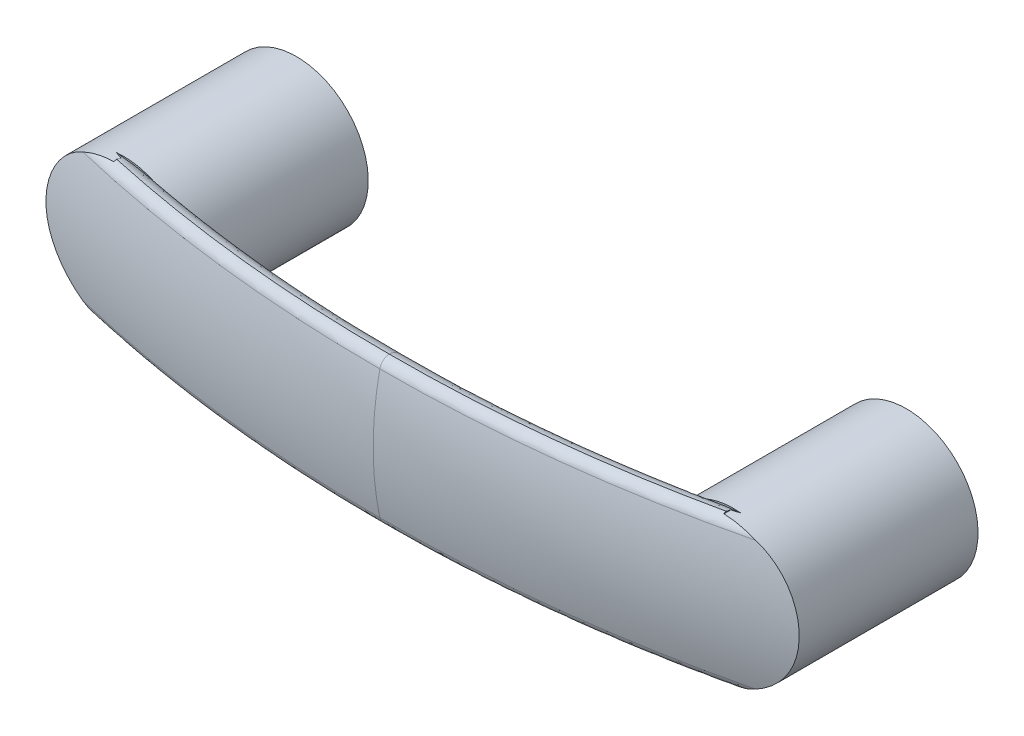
ISO-10303-21;
HEADER;
FILE_DESCRIPTION(('STEP AP214'),'2;1');
FILE_NAME('part.step','',(''),(''),'','','');
FILE_SCHEMA(('AUTOMOTIVE_DESIGN { 1 0 10303 214 1 1 1 1 }'));
ENDSEC;
DATA;
#1=APPLICATION_CONTEXT('core data for automotive mechanical design processes');
#2=APPLICATION_PROTOCOL_DEFINITION('international standard','automotive_design',2000,#1);
#3=PRODUCT_CONTEXT('',#1,'mechanical');
#4=PRODUCT('Part','Part','',(#3));
#5=PRODUCT_RELATED_PRODUCT_CATEGORY('part','',(#4));
#6=PRODUCT_DEFINITION_FORMATION('','',#4);
#7=PRODUCT_DEFINITION_CONTEXT('part definition',#1,'design');
#8=PRODUCT_DEFINITION('design','',#6,#7);
#9=PRODUCT_DEFINITION_SHAPE('','',#8);
#10=(LENGTH_UNIT() NAMED_UNIT(*) SI_UNIT(.MILLI.,.METRE.));
#11=(NAMED_UNIT(*) PLANE_ANGLE_UNIT() SI_UNIT($,.RADIAN.));
#12=(NAMED_UNIT(*) SI_UNIT($,.STERADIAN.) SOLID_ANGLE_UNIT());
#13=UNCERTAINTY_MEASURE_WITH_UNIT(LENGTH_MEASURE(1.E-05),#10,'distance_accuracy_value','');
#14=(GEOMETRIC_REPRESENTATION_CONTEXT(3) GLOBAL_UNCERTAINTY_ASSIGNED_CONTEXT((#13)) GLOBAL_UNIT_ASSIGNED_CONTEXT((#10,
#11,#12)) REPRESENTATION_CONTEXT('',''));
#15=CARTESIAN_POINT('',(0.,0.,0.));
#16=DIRECTION('',(0.,0.,1.));
#17=DIRECTION('',(1.,0.,0.));
#18=AXIS2_PLACEMENT_3D('',#15,#16,#17);
#19=CARTESIAN_POINT('',(0.,0.,17.));
#20=DIRECTION('',(0.,0.,-1.));
#21=DIRECTION('',(-1.,0.,0.));
#22=AXIS2_PLACEMENT_3D('',#19,#20,#21);
#23=PLANE('',#22);
#24=CARTESIAN_POINT('',(0.,0.,17.));
#25=DIRECTION('',(0.,0.,1.));
#26=DIRECTION('',(0.,-1.,0.));
#27=AXIS2_PLACEMENT_3D('',#24,#25,#26);
#28=CIRCLE('',#27,3.25);
#29=CARTESIAN_POINT('',(0.,-3.25,17.));
#30=VERTEX_POINT('',#29);
#31=EDGE_CURVE('E291',#30,#30,#28,.T.);
#32=ORIENTED_EDGE('',*,*,#31,.F.);
#33=EDGE_LOOP('',(#32));
#34=FACE_BOUND('',#33,.T.);
#35=DIRECTION('',(-0.866025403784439,0.5,0.));
#36=VECTOR('',#35,1.);
#37=CARTESIAN_POINT('',(5.,2.88675134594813,17.));
#38=LINE('',#37,#36);
#39=CARTESIAN_POINT('',(5.,2.88675134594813,17.));
#40=VERTEX_POINT('',#39);
#41=CARTESIAN_POINT('',(0.,5.77350269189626,17.));
#42=VERTEX_POINT('',#41);
#43=EDGE_CURVE('E312',#40,#42,#38,.T.);
#44=ORIENTED_EDGE('',*,*,#43,.T.);
#45=DIRECTION('',(-0.866025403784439,-0.5,0.));
#46=VECTOR('',#45,1.);
#47=CARTESIAN_POINT('',(0.,5.77350269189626,17.));
#48=LINE('',#47,#46);
#49=CARTESIAN_POINT('',(-5.,2.88675134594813,17.));
#50=VERTEX_POINT('',#49);
#51=EDGE_CURVE('E315',#42,#50,#48,.T.);
#52=ORIENTED_EDGE('',*,*,#51,.T.);
#53=DIRECTION('',(0.,-1.,0.));
#54=VECTOR('',#53,1.);
#55=CARTESIAN_POINT('',(-5.,2.88675134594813,17.));
#56=LINE('',#55,#54);
#57=CARTESIAN_POINT('',(-5.,-2.88675134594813,17.));
#58=VERTEX_POINT('',#57);
#59=EDGE_CURVE('E317',#50,#58,#56,.T.);
#60=ORIENTED_EDGE('',*,*,#59,.T.);
#61=DIRECTION('',(0.866025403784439,-0.5,0.));
#62=VECTOR('',#61,1.);
#63=CARTESIAN_POINT('',(-5.,-2.88675134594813,17.));
#64=LINE('',#63,#62);
#65=CARTESIAN_POINT('',(0.,-5.77350269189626,17.));
#66=VERTEX_POINT('',#65);
#67=EDGE_CURVE('E319',#58,#66,#64,.T.);
#68=ORIENTED_EDGE('',*,*,#67,.T.);
#69=DIRECTION('',(0.866025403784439,0.5,0.));
#70=VECTOR('',#69,1.);
#71=CARTESIAN_POINT('',(0.,-5.77350269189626,17.));
#72=LINE('',#71,#70);
#73=CARTESIAN_POINT('',(5.,-2.88675134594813,17.));
#74=VERTEX_POINT('',#73);
#75=EDGE_CURVE('E321',#66,#74,#72,.T.);
#76=ORIENTED_EDGE('',*,*,#75,.T.);
#77=DIRECTION('',(0.,1.,0.));
#78=VECTOR('',#77,1.);
#79=CARTESIAN_POINT('',(5.,-2.88675134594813,17.));
#80=LINE('',#79,#78);
#81=EDGE_CURVE('E301',#74,#40,#80,.T.);
#82=ORIENTED_EDGE('',*,*,#81,.T.);
#83=EDGE_LOOP('',(#44,#52,#60,#68,#76,#82));
#84=FACE_BOUND('',#83,.T.);
#85=ADVANCED_FACE('F14',(#34,#84),#23,.F.);
#86=CARTESIAN_POINT('',(93.5,0.,17.));
#87=DIRECTION('',(0.,0.,-1.));
#88=DIRECTION('',(-1.,0.,0.));
#89=AXIS2_PLACEMENT_3D('',#86,#87,#88);
#90=PLANE('',#89);
#91=CARTESIAN_POINT('',(93.5,0.,17.));
#92=DIRECTION('',(0.,0.,-1.));
#93=DIRECTION('',(0.,-1.,0.));
#94=AXIS2_PLACEMENT_3D('',#91,#92,#93);
#95=CIRCLE('',#94,3.25);
#96=CARTESIAN_POINT('',(93.5,-3.25,17.));
#97=VERTEX_POINT('',#96);
#98=EDGE_CURVE('E287',#97,#97,#95,.T.);
#99=ORIENTED_EDGE('',*,*,#98,.T.);
#100=EDGE_LOOP('',(#99));
#101=FACE_BOUND('',#100,.T.);
#102=DIRECTION('',(-0.866025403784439,0.5,0.));
#103=VECTOR('',#102,1.);
#104=CARTESIAN_POINT('',(98.5,2.88675134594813,17.));
#105=LINE('',#104,#103);
#106=CARTESIAN_POINT('',(98.5,2.88675134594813,17.));
#107=VERTEX_POINT('',#106);
#108=CARTESIAN_POINT('',(93.5,5.77350269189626,17.));
#109=VERTEX_POINT('',#108);
#110=EDGE_CURVE('E341',#107,#109,#105,.T.);
#111=ORIENTED_EDGE('',*,*,#110,.T.);
#112=DIRECTION('',(-0.866025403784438,-0.5,0.));
#113=VECTOR('',#112,1.);
#114=CARTESIAN_POINT('',(93.5,5.77350269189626,17.));
#115=LINE('',#114,#113);
#116=CARTESIAN_POINT('',(88.5,2.88675134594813,17.));
#117=VERTEX_POINT('',#116);
#118=EDGE_CURVE('E286',#109,#117,#115,.T.);
#119=ORIENTED_EDGE('',*,*,#118,.T.);
#120=DIRECTION('',(0.,-1.,0.));
#121=VECTOR('',#120,1.);
#122=CARTESIAN_POINT('',(88.5,2.88675134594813,17.));
#123=LINE('',#122,#121);
#124=CARTESIAN_POINT('',(88.5,-2.88675134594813,17.));
#125=VERTEX_POINT('',#124);
#126=EDGE_CURVE('E1321',#117,#125,#123,.T.);
#127=ORIENTED_EDGE('',*,*,#126,.T.);
#128=DIRECTION('',(0.866025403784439,-0.5,0.));
#129=VECTOR('',#128,1.);
#130=CARTESIAN_POINT('',(88.5,-2.88675134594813,17.));
#131=LINE('',#130,#129);
#132=CARTESIAN_POINT('',(93.5,-5.77350269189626,17.));
#133=VERTEX_POINT('',#132);
#134=EDGE_CURVE('E1308',#125,#133,#131,.T.);
#135=ORIENTED_EDGE('',*,*,#134,.T.);
#136=DIRECTION('',(0.866025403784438,0.5,0.));
#137=VECTOR('',#136,1.);
#138=CARTESIAN_POINT('',(93.5,-5.77350269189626,17.));
#139=LINE('',#138,#137);
#140=CARTESIAN_POINT('',(98.5,-2.88675134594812,17.));
#141=VERTEX_POINT('',#140);
#142=EDGE_CURVE('E1306',#133,#141,#139,.T.);
#143=ORIENTED_EDGE('',*,*,#142,.T.);
#144=DIRECTION('',(0.,1.,0.));
#145=VECTOR('',#144,1.);
#146=CARTESIAN_POINT('',(98.5,-2.88675134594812,17.));
#147=LINE('',#146,#145);
#148=EDGE_CURVE('E283',#141,#107,#147,.T.);
#149=ORIENTED_EDGE('',*,*,#148,.T.);
#150=EDGE_LOOP('',(#111,#119,#127,#135,#143,#149));
#151=FACE_BOUND('',#150,.T.);
#152=ADVANCED_FACE('F860',(#101,#151),#90,.F.);
#153=CARTESIAN_POINT('',(125.191834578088,0.,31.4954607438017));
#154=DIRECTION('',(0.940144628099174,0.,-0.340775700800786));
#155=DIRECTION('',(0.,1.,0.));
#156=AXIS2_PLACEMENT_3D('',#153,#154,#155);
#157=CIRCLE('',#156,17.6);
#158=CARTESIAN_POINT('',(47.2434292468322,0.,-184.999446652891));
#159=DIRECTION('',(0.,-1.,0.));
#160=AXIS1_PLACEMENT('',#158,#159);
#161=SURFACE_OF_REVOLUTION('',#157,#160);
#162=CARTESIAN_POINT('',(47.2434292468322,9.54893617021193,-184.999446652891));
#163=DIRECTION('',(0.,-1.,0.));
#164=DIRECTION('',(1.,0.,0.));
#165=AXIS2_PLACEMENT_3D('',#162,#163,#164);
#166=CIRCLE('',#165,215.315634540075);
#167=CARTESIAN_POINT('',(88.0394306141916,9.54893617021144,26.4160417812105));
#168=VERTEX_POINT('',#167);
#169=CARTESIAN_POINT('',(46.75,9.54893617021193,30.3156225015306));
#170=VERTEX_POINT('',#169);
#171=EDGE_CURVE('E483',#168,#170,#166,.T.);
#172=ORIENTED_EDGE('',*,*,#171,.F.);
#173=CARTESIAN_POINT('',(88.0394306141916,9.54893617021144,26.4160417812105));
#174=CARTESIAN_POINT('',(87.7659781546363,9.39256816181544,26.3659144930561));
#175=CARTESIAN_POINT('',(87.5001444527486,9.22495922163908,26.3100965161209));
#176=CARTESIAN_POINT('',(86.9850934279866,8.86870622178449,26.1903628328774));
#177=CARTESIAN_POINT('',(86.7358674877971,8.68007320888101,26.1264513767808));
#178=CARTESIAN_POINT('',(86.2549146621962,8.28288099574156,25.9936978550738));
#179=CARTESIAN_POINT('',(86.0232030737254,8.07430472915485,25.9248515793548));
#180=CARTESIAN_POINT('',(85.5785573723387,7.63856320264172,25.7851894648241));
#181=CARTESIAN_POINT('',(85.3656258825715,7.41139535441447,25.7143733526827));
#182=CARTESIAN_POINT('',(84.9598901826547,6.93996644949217,25.5735382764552));
#183=CARTESIAN_POINT('',(84.767064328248,6.69572425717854,25.503518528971));
#184=CARTESIAN_POINT('',(84.4024240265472,6.19120146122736,25.3666345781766));
#185=CARTESIAN_POINT('',(84.2306086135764,5.93092159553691,25.2997702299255));
#186=CARTESIAN_POINT('',(83.9092638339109,5.3958426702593,25.1714425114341));
#187=CARTESIAN_POINT('',(83.7597239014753,5.12105057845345,25.1099765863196));
#188=CARTESIAN_POINT('',(83.4840804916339,4.55845019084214,24.9944101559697));
#189=CARTESIAN_POINT('',(83.3579767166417,4.2706420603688,24.9403095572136));
#190=CARTESIAN_POINT('',(83.1312382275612,3.68597163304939,24.8415872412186));
#191=CARTESIAN_POINT('',(83.0304297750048,3.38918772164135,24.7969012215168));
#192=CARTESIAN_POINT('',(82.8542371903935,2.78679081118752,24.7179869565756));
#193=CARTESIAN_POINT('',(82.7788530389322,2.48117781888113,24.6837587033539));
#194=CARTESIAN_POINT('',(82.6544576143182,1.86369394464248,24.6269116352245));
#195=CARTESIAN_POINT('',(82.6054351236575,1.55182578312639,24.6042878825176));
#196=CARTESIAN_POINT('',(82.534364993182,0.92439332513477,24.5713971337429));
#197=CARTESIAN_POINT('',(82.5123150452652,0.608829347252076,24.561129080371));
#198=CARTESIAN_POINT('',(82.4962294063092,0.00490154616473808,24.553642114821));
#199=CARTESIAN_POINT('',(82.4998806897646,-0.283390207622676,24.5553457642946));
#200=CARTESIAN_POINT('',(82.5297753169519,-0.858531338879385,24.569245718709));
#201=CARTESIAN_POINT('',(82.5560171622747,-1.14538081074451,24.5814413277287));
#202=CARTESIAN_POINT('',(82.6307875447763,-1.71547764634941,24.6159755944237));
#203=CARTESIAN_POINT('',(82.6793119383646,-1.99872566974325,24.6383123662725));
#204=CARTESIAN_POINT('',(82.7981215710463,-2.5596876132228,24.6925021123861));
#205=CARTESIAN_POINT('',(82.8684071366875,-2.83740145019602,24.7243552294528));
#206=CARTESIAN_POINT('',(83.0287380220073,-3.38108213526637,24.7961202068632));
#207=CARTESIAN_POINT('',(83.1184496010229,-3.64716578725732,24.8358951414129));
#208=CARTESIAN_POINT('',(83.3174624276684,-4.17065270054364,24.9227645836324));
#209=CARTESIAN_POINT('',(83.426763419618,-4.42805607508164,24.9698589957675));
#210=CARTESIAN_POINT('',(83.6641855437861,-4.9330168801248,25.0701879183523));
#211=CARTESIAN_POINT('',(83.7923206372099,-5.18056683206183,25.1234269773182));
#212=CARTESIAN_POINT('',(84.0664699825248,-5.66443678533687,25.2346446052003));
#213=CARTESIAN_POINT('',(84.2124846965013,-5.90075649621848,25.2926232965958));
#214=CARTESIAN_POINT('',(84.5336729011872,-6.37921546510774,25.4164948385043));
#215=CARTESIAN_POINT('',(84.7102357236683,-6.62035455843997,25.482651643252));
#216=CARTESIAN_POINT('',(85.0821485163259,-7.08723311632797,25.6166659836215));
#217=CARTESIAN_POINT('',(85.2775016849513,-7.31296994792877,25.6845238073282));
#218=CARTESIAN_POINT('',(85.6857189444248,-7.74763122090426,25.8195792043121));
#219=CARTESIAN_POINT('',(85.8985594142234,-7.95657761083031,25.8867775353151));
#220=CARTESIAN_POINT('',(86.3409422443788,-8.35684289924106,26.0181186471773));
#221=CARTESIAN_POINT('',(86.5704771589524,-8.54816957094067,26.0822627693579));
#222=CARTESIAN_POINT('',(87.0030334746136,-8.87974544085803,26.1939239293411));
#223=CARTESIAN_POINT('',(87.20349851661,-9.02302345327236,26.2423678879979));
#224=CARTESIAN_POINT('',(87.6142270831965,-9.29615203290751,26.3337292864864));
#225=CARTESIAN_POINT('',(87.8244791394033,-9.42601776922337,26.3766529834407));
#226=CARTESIAN_POINT('',(88.0394306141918,-9.54893617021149,26.4160417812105));
#227=B_SPLINE_CURVE_WITH_KNOTS('',3,(#173,#174,#175,#176,#177,#178,#179,#180,#181,#182,#183,
#184,#185,#186,#187,#188,#189,#190,#191,#192,#193,#194,#195,#196,#197,#198,#199,#200,#201,#202,
#203,#204,#205,#206,#207,#208,#209,#210,#211,#212,#213,#214,#215,#216,#217,#218,#219,#220,#221,
#222,#223,#224,#225,#226),.UNSPECIFIED.,.F.,.F.,(4,2,2,2,2,2,2,2,2,2,2,2,2,2,2,2,2,2,2,2,2,2,2,
2,2,2,4),(0.,0.956383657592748,1.9122671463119,2.86897607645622,3.8258184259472,
4.78161983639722,5.73737730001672,6.69267997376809,7.64797051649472,8.59650814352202,
9.54504504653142,10.4931780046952,11.4412298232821,12.3051248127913,13.1689625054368,
14.0326396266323,14.8963297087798,15.7462167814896,16.5960927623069,17.4466019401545,
18.297133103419,19.2144510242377,20.1319253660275,21.0481801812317,21.9640288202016,
22.7168036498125,23.4687175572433),.UNSPECIFIED.);
#228=CARTESIAN_POINT('',(88.0394306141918,-9.54893617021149,26.4160417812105));
#229=VERTEX_POINT('',#228);
#230=EDGE_CURVE('E772',#168,#229,#227,.T.);
#231=ORIENTED_EDGE('',*,*,#230,.T.);
#232=CARTESIAN_POINT('',(47.2434292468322,-9.54893617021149,-184.999446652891));
#233=DIRECTION('',(0.,-1.,0.));
#234=DIRECTION('',(1.,0.,0.));
#235=AXIS2_PLACEMENT_3D('',#232,#233,#234);
#236=CIRCLE('',#235,215.315634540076);
#237=CARTESIAN_POINT('',(46.75,-9.54893617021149,30.3156225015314));
#238=VERTEX_POINT('',#237);
#239=EDGE_CURVE('E481',#229,#238,#236,.T.);
#240=ORIENTED_EDGE('',*,*,#239,.T.);
#241=CARTESIAN_POINT('',(46.75,0.,45.1));
#242=DIRECTION('',(1.,0.,0.));
#243=DIRECTION('',(0.,1.,0.));
#244=AXIS2_PLACEMENT_3D('',#241,#242,#243);
#245=CIRCLE('',#244,17.6);
#246=EDGE_CURVE('E700',#238,#170,#245,.T.);
#247=ORIENTED_EDGE('',*,*,#246,.T.);
#248=EDGE_LOOP('',(#172,#231,#240,#247));
#249=FACE_BOUND('',#248,.T.);
#250=ADVANCED_FACE('F469',(#249),#161,.T.);
#251=CARTESIAN_POINT('',(0.,0.,0.));
#252=DIRECTION('',(0.,0.,1.));
#253=DIRECTION('',(0.,-1.,0.));
#254=AXIS2_PLACEMENT_3D('',#251,#252,#253);
#255=PLANE('',#254);
#256=CARTESIAN_POINT('',(0.,0.,0.));
#257=DIRECTION('',(0.,0.,1.));
#258=DIRECTION('',(0.,-1.,0.));
#259=AXIS2_PLACEMENT_3D('',#256,#257,#258);
#260=CIRCLE('',#259,11.);
#261=CARTESIAN_POINT('',(0.,-11.,0.));
#262=VERTEX_POINT('',#261);
#263=EDGE_CURVE('E1290',#262,#262,#260,.T.);
#264=ORIENTED_EDGE('',*,*,#263,.F.);
#265=EDGE_LOOP('',(#264));
#266=FACE_BOUND('',#265,.T.);
#267=CARTESIAN_POINT('',(0.,0.,0.));
#268=DIRECTION('',(0.,0.,1.));
#269=DIRECTION('',(0.,-1.,0.));
#270=AXIS2_PLACEMENT_3D('',#267,#268,#269);
#271=CIRCLE('',#270,3.25);
#272=CARTESIAN_POINT('',(0.,-3.25,0.));
#273=VERTEX_POINT('',#272);
#274=EDGE_CURVE('E494',#273,#273,#271,.T.);
#275=ORIENTED_EDGE('',*,*,#274,.T.);
#276=EDGE_LOOP('',(#275));
#277=FACE_BOUND('',#276,.T.);
#278=ADVANCED_FACE('F672',(#266,#277),#255,.F.);
#279=CARTESIAN_POINT('',(-27.4898489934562,-8.47425322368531,19.9028672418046));
#280=DIRECTION('',(0.940144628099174,0.,0.340775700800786));
#281=DIRECTION('',(0.,1.,0.));
#282=AXIS2_PLACEMENT_3D('',#279,#280,#281);
#283=CIRCLE('',#282,2.67875466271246);
#284=CARTESIAN_POINT('',(46.2565707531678,0.,-184.999446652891));
#285=DIRECTION('',(0.,1.,0.));
#286=AXIS1_PLACEMENT('',#284,#285);
#287=SURFACE_OF_REVOLUTION('',#283,#286);
#288=CARTESIAN_POINT('',(46.2565707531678,-11.1437941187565,-184.999446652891));
#289=DIRECTION('',(0.,1.,0.));
#290=DIRECTION('',(-1.,0.,0.));
#291=AXIS2_PLACEMENT_3D('',#288,#289,#290);
#292=CIRCLE('',#291,217.547370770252);
#293=CARTESIAN_POINT('',(0.,-11.1437941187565,27.5733366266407));
#294=VERTEX_POINT('',#293);
#295=CARTESIAN_POINT('',(46.75,-11.1437941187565,32.5473645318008));
#296=VERTEX_POINT('',#295);
#297=EDGE_CURVE('E629',#294,#296,#292,.T.);
#298=ORIENTED_EDGE('',*,*,#297,.F.);
#299=CARTESIAN_POINT('',(0.,-11.1437941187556,27.5733366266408));
#300=CARTESIAN_POINT('',(0.,-11.1343057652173,27.4564772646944));
#301=CARTESIAN_POINT('',(0.,-11.1174827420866,27.3403480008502));
#302=CARTESIAN_POINT('',(0.,-11.0854857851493,27.1876211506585));
#303=CARTESIAN_POINT('',(0.,-11.0767014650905,27.1496593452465));
#304=CARTESIAN_POINT('',(0.,-11.0575359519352,27.074068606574));
#305=CARTESIAN_POINT('',(0.,-11.0471519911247,27.0364403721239));
#306=CARTESIAN_POINT('',(0.,-11.0247761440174,26.9615212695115));
#307=CARTESIAN_POINT('',(0.,-11.0127787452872,26.9242320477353));
#308=CARTESIAN_POINT('',(0.,-11.0000000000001,26.8872131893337));
#309=B_SPLINE_CURVE_WITH_KNOTS('',3,(#299,#300,#301,#302,#303,#304,#305,#306,#307,#308),
.UNSPECIFIED.,.F.,.F.,(4,2,2,2,4),(0.,0.351207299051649,0.46807188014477,0.585140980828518,
0.702620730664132),.UNSPECIFIED.);
#310=CARTESIAN_POINT('',(0.,-11.,26.8872131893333));
#311=VERTEX_POINT('',#310);
#312=EDGE_CURVE('E606',#294,#311,#309,.T.);
#313=ORIENTED_EDGE('',*,*,#312,.T.);
#314=CARTESIAN_POINT('',(0.,-11.,26.8872131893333));
#315=CARTESIAN_POINT('',(-0.0707909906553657,-11.0000010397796,26.8717864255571));
#316=CARTESIAN_POINT('',(-0.141130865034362,-10.9993167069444,26.8543859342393));
#317=CARTESIAN_POINT('',(-0.280472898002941,-10.9966431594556,26.8161161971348));
#318=CARTESIAN_POINT('',(-0.34947987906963,-10.9946602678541,26.7952641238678));
#319=CARTESIAN_POINT('',(-0.486250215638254,-10.9894602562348,26.7504645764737));
#320=CARTESIAN_POINT('',(-0.554016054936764,-10.9862459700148,26.7265242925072));
#321=CARTESIAN_POINT('',(-0.688436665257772,-10.9786421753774,26.6759910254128));
#322=CARTESIAN_POINT('',(-0.755092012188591,-10.9742532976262,26.6493994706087));
#323=CARTESIAN_POINT('',(-0.886809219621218,-10.9643920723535,26.594243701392));
#324=CARTESIAN_POINT('',(-0.951879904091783,-10.9589294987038,26.565698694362));
#325=CARTESIAN_POINT('',(-1.0811703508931,-10.9469306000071,26.5068048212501));
#326=CARTESIAN_POINT('',(-1.14538924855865,-10.9403932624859,26.4764542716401));
#327=CARTESIAN_POINT('',(-1.2730686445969,-10.9262722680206,26.4142934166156));
#328=CARTESIAN_POINT('',(-1.33652841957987,-10.9186876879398,26.3824818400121));
#329=CARTESIAN_POINT('',(-1.46275845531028,-10.9024945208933,26.3176990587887));
#330=CARTESIAN_POINT('',(-1.52552835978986,-10.8938854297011,26.2847272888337));
#331=CARTESIAN_POINT('',(-1.72299672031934,-10.8650777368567,26.1790708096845));
#332=CARTESIAN_POINT('',(-1.8565508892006,-10.8430331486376,26.1047449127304));
#333=CARTESIAN_POINT('',(-2.12146647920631,-10.7943275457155,25.9537877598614));
#334=CARTESIAN_POINT('',(-2.25282799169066,-10.767666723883,25.877156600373));
#335=CARTESIAN_POINT('',(-2.51390523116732,-10.7097226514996,25.7228198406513));
#336=CARTESIAN_POINT('',(-2.64362080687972,-10.6784389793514,25.6451141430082));
#337=CARTESIAN_POINT('',(-2.90174277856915,-10.6112050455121,25.4895610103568));
#338=CARTESIAN_POINT('',(-3.03014922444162,-10.5752549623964,25.4117135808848));
#339=CARTESIAN_POINT('',(-3.28587123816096,-10.4986123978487,25.2566196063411));
#340=CARTESIAN_POINT('',(-3.41318701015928,-10.4579208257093,25.1793729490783));
#341=CARTESIAN_POINT('',(-3.67011932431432,-10.3705880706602,25.0241594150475));
#342=CARTESIAN_POINT('',(-3.79971252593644,-10.3238223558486,24.946223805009));
#343=CARTESIAN_POINT('',(-4.05803006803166,-10.2250433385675,24.7922849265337));
#344=CARTESIAN_POINT('',(-4.18675449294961,-10.1730305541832,24.7162814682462));
#345=CARTESIAN_POINT('',(-4.44342425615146,-10.0635703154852,24.5668343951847));
#346=CARTESIAN_POINT('',(-4.57136941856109,-10.0061216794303,24.4933913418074));
#347=CARTESIAN_POINT('',(-4.82656913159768,-9.88555374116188,24.3497121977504));
#348=CARTESIAN_POINT('',(-4.95382299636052,-9.82242962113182,24.2794789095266));
#349=CARTESIAN_POINT('',(-5.20772652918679,-9.69020503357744,24.1429695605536));
#350=CARTESIAN_POINT('',(-5.33437453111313,-9.621093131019,24.0767014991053));
#351=CARTESIAN_POINT('',(-5.4605693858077,-9.54893617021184,24.0128972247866));
#352=B_SPLINE_CURVE_WITH_KNOTS('',3,(#314,#315,#316,#317,#318,#319,#320,#321,#322,#323,#324,
#325,#326,#327,#328,#329,#330,#331,#332,#333,#334,#335,#336,#337,#338,#339,#340,#341,#342,#343,
#344,#345,#346,#347,#348,#349,#350,#351),.UNSPECIFIED.,.F.,.F.,(4,2,2,2,2,2,2,2,2,2,2,2,2,2,2,2,
2,2,4),(0.,0.217296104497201,0.433541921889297,0.649293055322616,0.864928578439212,
1.07868519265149,1.29264434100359,1.50679331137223,1.72104811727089,2.18418173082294,
2.64729599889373,3.11045252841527,3.57359133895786,4.03664147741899,4.51141309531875,
4.9861378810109,5.46096610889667,5.9362012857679,6.41236492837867),.UNSPECIFIED.);
#353=CARTESIAN_POINT('',(-1.094948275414,-10.9453683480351,26.5));
#354=VERTEX_POINT('',#353);
#355=EDGE_CURVE('E558',#311,#354,#352,.T.);
#356=ORIENTED_EDGE('',*,*,#355,.T.);
#357=CARTESIAN_POINT('',(5.89809527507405,-9.54893617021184,26.5));
#358=CARTESIAN_POINT('',(5.85335939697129,-9.56807767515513,26.5));
#359=CARTESIAN_POINT('',(5.80841977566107,-9.58673543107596,26.5));
#360=CARTESIAN_POINT('',(5.71819153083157,-9.62317676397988,26.5));
#361=CARTESIAN_POINT('',(5.67290293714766,-9.64096041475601,26.5));
#362=CARTESIAN_POINT('',(5.53662401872,-9.69313186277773,26.5));
#363=CARTESIAN_POINT('',(5.44518698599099,-9.72635434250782,26.5));
#364=CARTESIAN_POINT('',(5.26174364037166,-9.79012691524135,26.5));
#365=CARTESIAN_POINT('',(5.1697403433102,-9.82068575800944,26.5));
#366=CARTESIAN_POINT('',(4.98503806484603,-9.87964899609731,26.5));
#367=CARTESIAN_POINT('',(4.89233900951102,-9.90805315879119,26.5));
#368=CARTESIAN_POINT('',(4.61362266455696,-9.99043080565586,26.5));
#369=CARTESIAN_POINT('',(4.42678651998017,-10.0416372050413,26.5));
#370=CARTESIAN_POINT('',(4.05166982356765,-10.1382884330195,26.5));
#371=CARTESIAN_POINT('',(3.86338939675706,-10.1837337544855,26.5));
#372=CARTESIAN_POINT('',(3.48678691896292,-10.2696575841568,26.5));
#373=CARTESIAN_POINT('',(3.29847072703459,-10.3101618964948,26.5));
#374=CARTESIAN_POINT('',(2.92092039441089,-10.387209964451,26.5));
#375=CARTESIAN_POINT('',(2.7316857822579,-10.4237513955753,26.5));
#376=CARTESIAN_POINT('',(2.35250104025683,-10.4933553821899,26.5));
#377=CARTESIAN_POINT('',(2.16255065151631,-10.5264165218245,26.5));
#378=CARTESIAN_POINT('',(1.78211504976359,-10.5894080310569,26.5));
#379=CARTESIAN_POINT('',(1.59162978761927,-10.6193381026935,26.5));
#380=CARTESIAN_POINT('',(1.16928207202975,-10.6824552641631,26.5));
#381=CARTESIAN_POINT('',(0.937317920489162,-10.7149616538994,26.5));
#382=CARTESIAN_POINT('',(0.472949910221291,-10.7760965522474,26.5));
#383=CARTESIAN_POINT('',(0.240546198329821,-10.8047261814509,26.5));
#384=CARTESIAN_POINT('',(-0.224641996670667,-10.8583639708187,26.5));
#385=CARTESIAN_POINT('',(-0.457426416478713,-10.8833726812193,26.5));
#386=CARTESIAN_POINT('',(-0.92332466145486,-10.9299465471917,26.5));
#387=CARTESIAN_POINT('',(-1.15643846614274,-10.9515119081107,26.5));
#388=CARTESIAN_POINT('',(-1.62446194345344,-10.9914452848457,26.5));
#389=CARTESIAN_POINT('',(-1.85937345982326,-11.0097916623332,26.5));
#390=CARTESIAN_POINT('',(-2.32944842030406,-11.0431842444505,26.5));
#391=CARTESIAN_POINT('',(-2.56461188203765,-11.0582302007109,26.5));
#392=CARTESIAN_POINT('',(-3.03515232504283,-11.0850508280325,26.5));
#393=CARTESIAN_POINT('',(-3.27052932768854,-11.0968251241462,26.5));
#394=CARTESIAN_POINT('',(-3.74146064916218,-11.1170841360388,26.5));
#395=CARTESIAN_POINT('',(-3.97701498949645,-11.1255683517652,26.5));
#396=CARTESIAN_POINT('',(-4.2126175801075,-11.1323977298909,26.5));
#397=B_SPLINE_CURVE_WITH_KNOTS('',3,(#357,#358,#359,#360,#361,#362,#363,#364,#365,#366,#367,
#368,#369,#370,#371,#372,#373,#374,#375,#376,#377,#378,#379,#380,#381,#382,#383,#384,#385,#386,
#387,#388,#389,#390,#391,#392,#393,#394,#395,#396),.UNSPECIFIED.,.F.,.F.,(4,2,2,2,2,2,2,2,2,2,2,
2,2,2,2,2,2,2,2,4),(0.,0.145969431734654,0.291926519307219,0.583731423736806,0.874538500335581,
1.16537692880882,1.74642171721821,2.32741676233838,2.90523435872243,3.48338907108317,
4.06177808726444,4.64022209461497,5.34287747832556,6.04532932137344,6.74767430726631,
7.44997739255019,8.15683422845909,8.86374423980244,9.57073523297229,10.2778336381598),.UNSPECIFIED.);
#398=CARTESIAN_POINT('',(4.59466619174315,-9.99445058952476,26.5));
#399=VERTEX_POINT('',#398);
#400=EDGE_CURVE('E676',#399,#354,#397,.T.);
#401=ORIENTED_EDGE('',*,*,#400,.F.);
#402=CARTESIAN_POINT('',(4.5946661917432,-9.99445058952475,26.5));
#403=CARTESIAN_POINT('',(4.64373104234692,-9.97189444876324,26.4938196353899));
#404=CARTESIAN_POINT('',(4.69265247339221,-9.94896650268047,26.4878544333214));
#405=CARTESIAN_POINT('',(4.7901662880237,-9.90238479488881,26.4763949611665));
#406=CARTESIAN_POINT('',(4.83875885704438,-9.87873149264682,26.4709004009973));
#407=CARTESIAN_POINT('',(4.93561792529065,-9.83069667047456,26.4604167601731));
#408=CARTESIAN_POINT('',(4.98388452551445,-9.80631539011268,26.4554275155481));
#409=CARTESIAN_POINT('',(5.08009557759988,-9.75682097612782,26.4459897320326));
#410=CARTESIAN_POINT('',(5.12804002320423,-9.7317078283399,26.4415412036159));
#411=CARTESIAN_POINT('',(5.22360672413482,-9.68074718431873,26.433221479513));
#412=CARTESIAN_POINT('',(5.27122887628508,-9.65489946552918,26.4293504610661));
#413=CARTESIAN_POINT('',(5.36615185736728,-9.60246616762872,26.4222237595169));
#414=CARTESIAN_POINT('',(5.41345245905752,-9.57588012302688,26.4189684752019));
#415=CARTESIAN_POINT('',(5.46056938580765,-9.54893617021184,26.4160417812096));
#416=B_SPLINE_CURVE_WITH_KNOTS('',3,(#402,#403,#404,#405,#406,#407,#408,#409,#410,#411,#412,
#413,#414,#415),.UNSPECIFIED.,.F.,.F.,(4,2,2,2,2,2,4),(0.,0.163060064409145,0.326018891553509,
0.488924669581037,0.651833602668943,0.814792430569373,0.977856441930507),.UNSPECIFIED.);
#417=CARTESIAN_POINT('',(5.46056938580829,-9.54893617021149,26.4160417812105));
#418=VERTEX_POINT('',#417);
#419=EDGE_CURVE('E691',#399,#418,#416,.T.);
#420=ORIENTED_EDGE('',*,*,#419,.T.);
#421=CARTESIAN_POINT('',(46.2565707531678,-9.54893617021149,-184.999446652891));
#422=DIRECTION('',(0.,1.,0.));
#423=DIRECTION('',(-1.,0.,0.));
#424=AXIS2_PLACEMENT_3D('',#421,#422,#423);
#425=CIRCLE('',#424,215.315634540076);
#426=EDGE_CURVE('E645',#418,#238,#425,.T.);
#427=ORIENTED_EDGE('',*,*,#426,.T.);
#428=CARTESIAN_POINT('',(46.75,-8.47425322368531,32.7693509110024));
#429=DIRECTION('',(1.,0.,0.));
#430=DIRECTION('',(0.,1.,0.));
#431=AXIS2_PLACEMENT_3D('',#428,#429,#430);
#432=CIRCLE('',#431,2.67875466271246);
#433=EDGE_CURVE('E697',#296,#238,#432,.T.);
#434=ORIENTED_EDGE('',*,*,#433,.F.);
#435=EDGE_LOOP('',(#298,#313,#356,#401,#420,#427,#434));
#436=FACE_BOUND('',#435,.T.);
#437=ADVANCED_FACE('F618',(#436),#287,.F.);
#438=CARTESIAN_POINT('',(-27.4898489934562,8.47425322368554,19.9028672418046));
#439=DIRECTION('',(0.940144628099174,0.,0.340775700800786));
#440=DIRECTION('',(0.,1.,0.));
#441=AXIS2_PLACEMENT_3D('',#438,#439,#440);
#442=CIRCLE('',#441,2.67875466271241);
#443=CARTESIAN_POINT('',(46.2565707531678,0.,-184.999446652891));
#444=DIRECTION('',(0.,1.,0.));
#445=AXIS1_PLACEMENT('',#443,#444);
#446=SURFACE_OF_REVOLUTION('',#442,#445);
#447=CARTESIAN_POINT('',(-4.6830267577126,11.1437941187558,26.5));
#448=CARTESIAN_POINT('',(-4.45868645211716,11.1394208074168,26.5));
#449=CARTESIAN_POINT('',(-4.23437640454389,11.1335242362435,26.5));
#450=CARTESIAN_POINT('',(-3.78591677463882,11.1187238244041,26.5));
#451=CARTESIAN_POINT('',(-3.56176716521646,11.1098208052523,26.5));
#452=CARTESIAN_POINT('',(-3.11364753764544,11.0890462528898,26.5));
#453=CARTESIAN_POINT('',(-2.88967749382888,11.0771752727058,26.5));
#454=CARTESIAN_POINT('',(-2.44193726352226,11.0504657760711,26.5));
#455=CARTESIAN_POINT('',(-2.21816705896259,11.0356275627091,26.5));
#456=CARTESIAN_POINT('',(-1.77213393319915,11.0030483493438,26.5));
#457=CARTESIAN_POINT('',(-1.54986975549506,10.9853245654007,26.5));
#458=CARTESIAN_POINT('',(-1.1055836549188,10.9468500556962,26.5));
#459=CARTESIAN_POINT('',(-0.883561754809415,10.9260990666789,26.5000000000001));
#460=CARTESIAN_POINT('',(-0.439789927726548,10.8814645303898,26.4999999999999));
#461=CARTESIAN_POINT('',(-0.218040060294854,10.85758038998,26.4999999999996));
#462=CARTESIAN_POINT('',(0.225153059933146,10.8065229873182,26.5000000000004));
#463=CARTESIAN_POINT('',(0.446596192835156,10.779348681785,26.5000000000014));
#464=CARTESIAN_POINT('',(0.889429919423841,10.7214502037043,26.5000000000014));
#465=CARTESIAN_POINT('',(1.11081968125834,10.6907196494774,26.5000000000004));
#466=CARTESIAN_POINT('',(1.55302248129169,10.62545238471,26.4999999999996));
#467=CARTESIAN_POINT('',(1.77383556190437,10.5909159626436,26.4999999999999));
#468=CARTESIAN_POINT('',(2.21466775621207,10.5176357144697,26.5000000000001));
#469=CARTESIAN_POINT('',(2.43468717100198,10.4788937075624,26.5));
#470=CARTESIAN_POINT('',(2.87368998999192,10.396634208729,26.5));
#471=CARTESIAN_POINT('',(3.09267397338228,10.3531198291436,26.5));
#472=CARTESIAN_POINT('',(3.53077464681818,10.2601703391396,26.5));
#473=CARTESIAN_POINT('',(3.74988410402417,10.2107009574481,26.5));
#474=CARTESIAN_POINT('',(4.1864536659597,10.1047714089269,26.5));
#475=CARTESIAN_POINT('',(4.40391365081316,10.0483107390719,26.5));
#476=CARTESIAN_POINT('',(4.72830269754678,9.95675773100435,26.5));
#477=CARTESIAN_POINT('',(4.83619499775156,9.9250757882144,26.5));
#478=CARTESIAN_POINT('',(5.05114018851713,9.85902106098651,26.5));
#479=CARTESIAN_POINT('',(5.15819319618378,9.82464865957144,26.5));
#480=CARTESIAN_POINT('',(5.37163956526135,9.75252985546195,26.5));
#481=CARTESIAN_POINT('',(5.47802864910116,9.7147706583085,26.5));
#482=CARTESIAN_POINT('',(5.63649496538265,9.6550891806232,26.5));
#483=CARTESIAN_POINT('',(5.68914355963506,9.63468289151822,26.5));
#484=CARTESIAN_POINT('',(5.793984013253,9.59271290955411,26.5));
#485=CARTESIAN_POINT('',(5.84617581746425,9.57114907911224,26.5));
#486=CARTESIAN_POINT('',(5.89809527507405,9.54893617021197,26.5));
#487=B_SPLINE_CURVE_WITH_KNOTS('',3,(#447,#448,#449,#450,#451,#452,#453,#454,#455,#456,#457,
#458,#459,#460,#461,#462,#463,#464,#465,#466,#467,#468,#469,#470,#471,#472,#473,#474,#475,#476,
#477,#478,#479,#480,#481,#482,#483,#484,#485,#486),.UNSPECIFIED.,.F.,.F.,(4,2,2,2,2,2,2,2,2,2,2,
2,2,2,2,2,2,2,2,4),(0.,0.673142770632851,1.3461017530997,2.01893543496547,2.69170042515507,
3.36058947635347,4.02953673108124,4.6986108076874,5.36789759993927,6.03840461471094,
6.70886084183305,7.37902819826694,8.04876106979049,8.72255123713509,9.39638991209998,
9.73370530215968,10.0709727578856,10.4095727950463,10.5789554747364,10.7483583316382),.UNSPECIFIED.);
#488=CARTESIAN_POINT('',(-1.0949482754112,10.9453683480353,26.5));
#489=VERTEX_POINT('',#488);
#490=CARTESIAN_POINT('',(4.5946661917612,9.99445058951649,26.5));
#491=VERTEX_POINT('',#490);
#492=EDGE_CURVE('E648',#489,#491,#487,.T.);
#493=ORIENTED_EDGE('',*,*,#492,.F.);
#494=CARTESIAN_POINT('',(-5.4605693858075,9.54893617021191,24.0128972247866));
#495=CARTESIAN_POINT('',(-5.35158831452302,9.61125288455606,24.0679927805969));
#496=CARTESIAN_POINT('',(-5.24226574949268,9.67129756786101,24.1249341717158));
#497=CARTESIAN_POINT('',(-5.02322692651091,9.78685393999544,24.2418321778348));
#498=CARTESIAN_POINT('',(-4.91351214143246,9.84237568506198,24.3017815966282));
#499=CARTESIAN_POINT('',(-4.6936195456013,9.94911290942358,24.4241981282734));
#500=CARTESIAN_POINT('',(-4.58344250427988,10.0003337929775,24.4866619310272));
#501=CARTESIAN_POINT('',(-4.3625558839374,10.0986490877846,24.613680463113));
#502=CARTESIAN_POINT('',(-4.25184665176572,10.1457458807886,24.678233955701));
#503=CARTESIAN_POINT('',(-4.02982812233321,10.2359582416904,24.809028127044));
#504=CARTESIAN_POINT('',(-3.91851889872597,10.2790742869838,24.8752686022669));
#505=CARTESIAN_POINT('',(-3.69736365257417,10.3606528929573,25.0077619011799));
#506=CARTESIAN_POINT('',(-3.5875299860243,10.3991882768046,25.0739906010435));
#507=CARTESIAN_POINT('',(-3.36711937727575,10.4726312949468,25.2073144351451));
#508=CARTESIAN_POINT('',(-3.25654217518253,10.5075375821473,25.2744098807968));
#509=CARTESIAN_POINT('',(-3.0345313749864,10.573790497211,25.4090531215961));
#510=CARTESIAN_POINT('',(-2.92309743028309,10.6051355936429,25.4766010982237));
#511=CARTESIAN_POINT('',(-2.69921796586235,10.6643159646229,25.6116735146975));
#512=CARTESIAN_POINT('',(-2.5867720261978,10.692149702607,25.6791979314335));
#513=CARTESIAN_POINT('',(-2.36064556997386,10.744339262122,25.8136499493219));
#514=CARTESIAN_POINT('',(-2.24696450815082,10.7686934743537,25.8805772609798));
#515=CARTESIAN_POINT('',(-2.04937093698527,10.8077408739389,25.9949552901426));
#516=CARTESIAN_POINT('',(-1.96580929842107,10.8232558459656,26.0427323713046));
#517=CARTESIAN_POINT('',(-1.79778619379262,10.8524298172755,26.1371541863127));
#518=CARTESIAN_POINT('',(-1.71332524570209,10.866089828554,26.1837995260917));
#519=CARTESIAN_POINT('',(-1.54336623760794,10.8915286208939,26.2754555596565));
#520=CARTESIAN_POINT('',(-1.45786950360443,10.9033095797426,26.3204680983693));
#521=CARTESIAN_POINT('',(-1.2856358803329,10.9249560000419,26.4082404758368));
#522=CARTESIAN_POINT('',(-1.19890092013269,10.9348241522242,26.4510034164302));
#523=CARTESIAN_POINT('',(-1.02285423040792,10.9527020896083,26.5340177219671));
#524=CARTESIAN_POINT('',(-0.933524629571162,10.9606901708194,26.5742361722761));
#525=CARTESIAN_POINT('',(-0.75293856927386,10.9745746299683,26.6506498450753));
#526=CARTESIAN_POINT('',(-0.661681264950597,10.9804700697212,26.6868432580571));
#527=CARTESIAN_POINT('',(-0.476837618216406,10.9900505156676,26.7541263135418));
#528=CARTESIAN_POINT('',(-0.383244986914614,10.993728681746,26.7851999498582));
#529=CARTESIAN_POINT('',(-0.241043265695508,10.9974619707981,26.8271246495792));
#530=CARTESIAN_POINT('',(-0.193154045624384,10.9984092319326,26.8403600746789));
#531=CARTESIAN_POINT('',(-0.0969122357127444,10.9996784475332,26.8651070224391));
#532=CARTESIAN_POINT('',(-0.0485595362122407,11.0000002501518,26.8766181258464));
#533=CARTESIAN_POINT('',(0.,10.9999999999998,26.8872131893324));
#534=B_SPLINE_CURVE_WITH_KNOTS('',3,(#494,#495,#496,#497,#498,#499,#500,#501,#502,#503,#504,
#505,#506,#507,#508,#509,#510,#511,#512,#513,#514,#515,#516,#517,#518,#519,#520,#521,#522,#523,
#524,#525,#526,#527,#528,#529,#530,#531,#532,#533),.UNSPECIFIED.,.F.,.F.,(4,2,2,2,2,2,2,2,2,2,2,
2,2,2,2,2,2,2,2,4),(0.,0.411233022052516,0.82152523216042,1.23129392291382,1.64082438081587,
2.05030566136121,2.45201061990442,2.85386415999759,3.25588986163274,3.65809088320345,
4.06047732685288,4.35294815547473,4.64525877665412,4.93722811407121,5.22878371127,
5.52355595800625,5.81846019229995,6.11426958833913,6.26331784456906,6.4124022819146),.UNSPECIFIED.);
#535=CARTESIAN_POINT('',(0.,11.,26.8872131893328));
#536=VERTEX_POINT('',#535);
#537=EDGE_CURVE('E549',#489,#536,#534,.T.);
#538=ORIENTED_EDGE('',*,*,#537,.T.);
#539=CARTESIAN_POINT('',(0.,11.,26.8872131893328));
#540=CARTESIAN_POINT('',(0.,11.0127787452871,26.9242320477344));
#541=CARTESIAN_POINT('',(0.,11.0247761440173,26.9615212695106));
#542=CARTESIAN_POINT('',(0.,11.0471519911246,27.0364403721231));
#543=CARTESIAN_POINT('',(0.,11.0575359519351,27.0740686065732));
#544=CARTESIAN_POINT('',(0.,11.0767014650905,27.1496593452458));
#545=CARTESIAN_POINT('',(0.,11.0854857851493,27.1876211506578));
#546=CARTESIAN_POINT('',(0.,11.1174827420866,27.3403480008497));
#547=CARTESIAN_POINT('',(0.,11.1343057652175,27.456477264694));
#548=CARTESIAN_POINT('',(0.,11.1437941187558,27.5733366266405));
#549=B_SPLINE_CURVE_WITH_KNOTS('',3,(#539,#540,#541,#542,#543,#544,#545,#546,#547,#548),
.UNSPECIFIED.,.F.,.F.,(4,2,2,2,4),(0.,0.117479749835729,0.234548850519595,0.351413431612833,
0.702620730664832),.UNSPECIFIED.);
#550=CARTESIAN_POINT('',(0.,11.1437941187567,27.5733366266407));
#551=VERTEX_POINT('',#550);
#552=EDGE_CURVE('E523',#536,#551,#549,.T.);
#553=ORIENTED_EDGE('',*,*,#552,.T.);
#554=CARTESIAN_POINT('',(46.2565707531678,11.1437941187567,-184.999446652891));
#555=DIRECTION('',(0.,1.,0.));
#556=DIRECTION('',(-1.,0.,0.));
#557=AXIS2_PLACEMENT_3D('',#554,#555,#556);
#558=CIRCLE('',#557,217.547370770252);
#559=CARTESIAN_POINT('',(46.75,11.1437941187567,32.5473645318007));
#560=VERTEX_POINT('',#559);
#561=EDGE_CURVE('E639',#551,#560,#558,.T.);
#562=ORIENTED_EDGE('',*,*,#561,.T.);
#563=CARTESIAN_POINT('',(46.75,8.47425322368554,32.7693509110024));
#564=DIRECTION('',(1.,0.,0.));
#565=DIRECTION('',(0.,1.,0.));
#566=AXIS2_PLACEMENT_3D('',#563,#564,#565);
#567=CIRCLE('',#566,2.67875466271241);
#568=EDGE_CURVE('E703',#170,#560,#567,.T.);
#569=ORIENTED_EDGE('',*,*,#568,.F.);
#570=CARTESIAN_POINT('',(46.2565707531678,9.54893617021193,-184.999446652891));
#571=DIRECTION('',(0.,1.,0.));
#572=DIRECTION('',(-1.,0.,0.));
#573=AXIS2_PLACEMENT_3D('',#570,#571,#572);
#574=CIRCLE('',#573,215.315634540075);
#575=CARTESIAN_POINT('',(5.4605693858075,9.54893617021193,26.4160417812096));
#576=VERTEX_POINT('',#575);
#577=EDGE_CURVE('E642',#576,#170,#574,.T.);
#578=ORIENTED_EDGE('',*,*,#577,.F.);
#579=CARTESIAN_POINT('',(5.4605693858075,9.54893617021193,26.4160417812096));
#580=CARTESIAN_POINT('',(5.41345245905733,9.57588012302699,26.4189684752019));
#581=CARTESIAN_POINT('',(5.36615185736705,9.60246616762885,26.4222237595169));
#582=CARTESIAN_POINT('',(5.27122887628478,9.65489946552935,26.429350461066));
#583=CARTESIAN_POINT('',(5.22360672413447,9.68074718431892,26.4332214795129));
#584=CARTESIAN_POINT('',(5.12804002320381,9.73170782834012,26.4415412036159));
#585=CARTESIAN_POINT('',(5.08009557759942,9.75682097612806,26.4459897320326));
#586=CARTESIAN_POINT('',(4.98388452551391,9.80631539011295,26.4554275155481));
#587=CARTESIAN_POINT('',(4.93561792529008,9.83069667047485,26.4604167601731));
#588=CARTESIAN_POINT('',(4.83875885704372,9.87873149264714,26.4709004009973));
#589=CARTESIAN_POINT('',(4.79016628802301,9.90238479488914,26.4763949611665));
#590=CARTESIAN_POINT('',(4.69265247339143,9.94896650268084,26.4878544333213));
#591=CARTESIAN_POINT('',(4.6437310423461,9.97189444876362,26.4938196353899));
#592=CARTESIAN_POINT('',(4.59466619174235,9.99445058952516,26.5));
#593=B_SPLINE_CURVE_WITH_KNOTS('',3,(#579,#580,#581,#582,#583,#584,#585,#586,#587,#588,#589,
#590,#591,#592),.UNSPECIFIED.,.F.,.F.,(4,2,2,2,2,2,4),(0.,0.163064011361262,0.326022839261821,
0.488931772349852,0.651837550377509,0.814796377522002,0.977856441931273),.UNSPECIFIED.);
#594=EDGE_CURVE('E656',#576,#491,#593,.T.);
#595=ORIENTED_EDGE('',*,*,#594,.T.);
#596=EDGE_LOOP('',(#493,#538,#553,#562,#569,#578,#595));
#597=FACE_BOUND('',#596,.T.);
#598=ADVANCED_FACE('F662',(#597),#446,.F.);
#599=CARTESIAN_POINT('',(-27.3662254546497,9.55000000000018,19.5618100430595));
#600=DIRECTION('',(0.940144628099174,0.,0.340775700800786));
#601=DIRECTION('',(0.,1.,0.));
#602=AXIS2_PLACEMENT_3D('',#599,#600,#601);
#603=CIRCLE('',#602,1.59999999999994);
#604=CARTESIAN_POINT('',(46.2565707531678,0.,-184.999446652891));
#605=DIRECTION('',(0.,1.,0.));
#606=AXIS1_PLACEMENT('',#604,#605);
#607=SURFACE_OF_REVOLUTION('',#603,#606);
#608=CARTESIAN_POINT('',(-4.53826722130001,9.87931034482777,28.));
#609=CARTESIAN_POINT('',(-4.52605574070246,9.89277220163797,28.));
#610=CARTESIAN_POINT('',(-4.51342694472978,9.90584132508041,28.));
#611=CARTESIAN_POINT('',(-4.48747834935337,9.93125473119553,28.));
#612=CARTESIAN_POINT('',(-4.47415912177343,9.94359959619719,28.));
#613=CARTESIAN_POINT('',(-4.43355841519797,9.97948610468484,28.));
#614=CARTESIAN_POINT('',(-4.40544269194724,10.0020836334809,28.));
#615=CARTESIAN_POINT('',(-4.34772267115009,10.0451551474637,28.));
#616=CARTESIAN_POINT('',(-4.31812066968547,10.0656322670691,28.));
#617=CARTESIAN_POINT('',(-4.2581981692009,10.1046062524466,28.));
#618=CARTESIAN_POINT('',(-4.22789214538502,10.123125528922,28.));
#619=CARTESIAN_POINT('',(-4.1664120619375,10.158781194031,28.));
#620=CARTESIAN_POINT('',(-4.13523657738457,10.1759151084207,28.));
#621=CARTESIAN_POINT('',(-4.07222642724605,10.2089821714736,28.));
#622=CARTESIAN_POINT('',(-4.04039123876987,10.2249143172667,28.));
#623=CARTESIAN_POINT('',(-3.93367289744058,10.276173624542,28.));
#624=CARTESIAN_POINT('',(-3.85768509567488,10.3092044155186,28.));
#625=CARTESIAN_POINT('',(-3.70404365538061,10.3710642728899,28.));
#626=CARTESIAN_POINT('',(-3.62638971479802,10.3998925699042,28.));
#627=CARTESIAN_POINT('',(-3.46987124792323,10.4542650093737,28.));
#628=CARTESIAN_POINT('',(-3.39100571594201,10.4798062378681,28.));
#629=CARTESIAN_POINT('',(-3.23244580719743,10.5281938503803,28.));
#630=CARTESIAN_POINT('',(-3.15275129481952,10.5510397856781,28.));
#631=CARTESIAN_POINT('',(-2.99095980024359,10.594955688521,28.));
#632=CARTESIAN_POINT('',(-2.90884898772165,10.6159744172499,28.));
#633=CARTESIAN_POINT('',(-2.74420799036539,10.65597528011,28.));
#634=CARTESIAN_POINT('',(-2.6616782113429,10.6749590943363,28.));
#635=CARTESIAN_POINT('',(-2.49626562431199,10.7111645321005,28.));
#636=CARTESIAN_POINT('',(-2.41338295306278,10.7283867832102,28.));
#637=CARTESIAN_POINT('',(-2.24731773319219,10.7612788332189,28.));
#638=CARTESIAN_POINT('',(-2.16413520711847,10.7769487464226,28.));
#639=CARTESIAN_POINT('',(-1.99310002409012,10.8076944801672,28.));
#640=CARTESIAN_POINT('',(-1.90523380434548,10.8226946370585,28.));
#641=CARTESIAN_POINT('',(-1.72926281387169,10.8513098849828,28.));
#642=CARTESIAN_POINT('',(-1.64115800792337,10.8649247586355,28.));
#643=CARTESIAN_POINT('',(-1.46474875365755,10.8908935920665,28.));
#644=CARTESIAN_POINT('',(-1.37644427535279,10.9032473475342,28.));
#645=CARTESIAN_POINT('',(-1.19967154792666,10.9267961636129,28.));
#646=CARTESIAN_POINT('',(-1.11120328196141,10.9379910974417,28.));
#647=CARTESIAN_POINT('',(-0.937614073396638,10.9588889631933,28.));
#648=CARTESIAN_POINT('',(-0.852498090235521,10.9686332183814,28.));
#649=CARTESIAN_POINT('',(-0.682174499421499,10.9871951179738,28.));
#650=CARTESIAN_POINT('',(-0.596966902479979,10.9960128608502,28.));
#651=CARTESIAN_POINT('',(-0.426488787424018,11.0127772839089,28.));
#652=CARTESIAN_POINT('',(-0.341218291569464,11.0207241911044,28.));
#653=CARTESIAN_POINT('',(-0.170641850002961,11.0357935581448,28.));
#654=CARTESIAN_POINT('',(-0.0853359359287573,11.0429163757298,28.));
#655=CARTESIAN_POINT('',(0.,11.0496525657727,28.));
#656=B_SPLINE_CURVE_WITH_KNOTS('',3,(#608,#609,#610,#611,#612,#613,#614,#615,#616,#617,#618,
#619,#620,#621,#622,#623,#624,#625,#626,#627,#628,#629,#630,#631,#632,#633,#634,#635,#636,#637,
#638,#639,#640,#641,#642,#643,#644,#645,#646,#647,#648,#649,#650,#651,#652,#653,#654,#655),
.UNSPECIFIED.,.F.,.F.,(4,2,2,2,2,2,2,2,2,2,2,2,2,2,2,2,2,2,2,2,2,2,2,4),(0.,0.0545008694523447,
0.108957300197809,0.217035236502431,0.324951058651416,0.431454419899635,0.538143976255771,
0.644921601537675,0.893291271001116,1.14170635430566,1.39034016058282,1.63901530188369,
1.89326022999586,2.14729360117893,2.40123615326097,2.65515999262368,2.92255979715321,
3.19000149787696,3.45748645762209,3.7250006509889,3.98201112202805,4.23899424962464,
4.49591022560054,4.75271425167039),.UNSPECIFIED.);
#657=CARTESIAN_POINT('',(-3.9675566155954,10.2595562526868,28.));
#658=VERTEX_POINT('',#657);
#659=CARTESIAN_POINT('',(-2.5943064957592,10.6896947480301,28.));
#660=VERTEX_POINT('',#659);
#661=EDGE_CURVE('E1289',#658,#660,#656,.T.);
#662=ORIENTED_EDGE('',*,*,#661,.F.);
#663=CARTESIAN_POINT('',(-3.9675566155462,10.2595562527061,28.0000000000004));
#664=CARTESIAN_POINT('',(-4.01690795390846,10.2404713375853,27.9980651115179));
#665=CARTESIAN_POINT('',(-4.06611219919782,10.2210336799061,27.9958404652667));
#666=CARTESIAN_POINT('',(-4.1641692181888,10.1814776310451,27.990763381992));
#667=CARTESIAN_POINT('',(-4.21302223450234,10.1613597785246,27.987911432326));
#668=CARTESIAN_POINT('',(-4.31037579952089,10.1204469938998,27.9815299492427));
#669=CARTESIAN_POINT('',(-4.35887648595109,10.0996523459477,27.9780006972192));
#670=CARTESIAN_POINT('',(-4.45552642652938,10.0573886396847,27.9702126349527));
#671=CARTESIAN_POINT('',(-4.50367566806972,10.0359195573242,27.9659537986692));
#672=CARTESIAN_POINT('',(-4.59961660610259,9.99231226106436,27.9566528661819));
#673=CARTESIAN_POINT('',(-4.64740816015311,9.97017379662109,27.9516104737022));
#674=CARTESIAN_POINT('',(-4.74262936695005,9.925232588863,27.9406852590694));
#675=CARTESIAN_POINT('',(-4.79005869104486,9.90242931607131,27.934801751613));
#676=CARTESIAN_POINT('',(-4.8372747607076,9.87931034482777,27.9284725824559));
#677=B_SPLINE_CURVE_WITH_KNOTS('',3,(#663,#664,#665,#666,#667,#668,#669,#670,#671,#672,#673,
#674,#675,#676),.UNSPECIFIED.,.F.,.F.,(4,2,2,2,2,2,4),(0.,0.158843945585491,0.317564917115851,
0.476220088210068,0.634880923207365,0.793601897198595,0.952452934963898),.UNSPECIFIED.);
#678=CARTESIAN_POINT('',(-4.8372747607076,9.87931034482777,27.9284725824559));
#679=VERTEX_POINT('',#678);
#680=EDGE_CURVE('E586',#658,#679,#677,.T.);
#681=ORIENTED_EDGE('',*,*,#680,.T.);
#682=CARTESIAN_POINT('',(46.2565707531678,9.87931034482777,-184.999446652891));
#683=DIRECTION('',(0.,1.,0.));
#684=DIRECTION('',(-1.,0.,0.));
#685=AXIS2_PLACEMENT_3D('',#682,#683,#684);
#686=CIRCLE('',#685,218.972326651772);
#687=CARTESIAN_POINT('',(46.75,9.87931034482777,33.9723240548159));
#688=VERTEX_POINT('',#687);
#689=EDGE_CURVE('E636',#679,#688,#686,.T.);
#690=ORIENTED_EDGE('',*,*,#689,.T.);
#691=CARTESIAN_POINT('',(46.75,9.55000000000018,32.4065799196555));
#692=DIRECTION('',(1.,0.,0.));
#693=DIRECTION('',(0.,1.,0.));
#694=AXIS2_PLACEMENT_3D('',#691,#692,#693);
#695=CIRCLE('',#694,1.59999999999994);
#696=EDGE_CURVE('E706',#560,#688,#695,.T.);
#697=ORIENTED_EDGE('',*,*,#696,.F.);
#698=ORIENTED_EDGE('',*,*,#561,.F.);
#699=CARTESIAN_POINT('',(0.,11.1437941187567,27.5733366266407));
#700=CARTESIAN_POINT('',(0.,11.1375132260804,27.6461630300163));
#701=CARTESIAN_POINT('',(0.,11.1264600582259,27.7184865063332));
#702=CARTESIAN_POINT('',(0.,11.105509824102,27.8134739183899));
#703=CARTESIAN_POINT('',(0.,11.0997631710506,27.8370707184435));
#704=CARTESIAN_POINT('',(0.,11.0872325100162,27.8840366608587));
#705=CARTESIAN_POINT('',(0.,11.0804465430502,27.9074052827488));
#706=CARTESIAN_POINT('',(0.,11.0658293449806,27.9539115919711));
#707=CARTESIAN_POINT('',(0.,11.0579942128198,27.9770480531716));
#708=CARTESIAN_POINT('',(0.,11.0496525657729,27.9999999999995));
#709=B_SPLINE_CURVE_WITH_KNOTS('',3,(#699,#700,#701,#702,#703,#704,#705,#706,#707,#708),
.UNSPECIFIED.,.F.,.F.,(4,2,2,2,4),(0.,0.218933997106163,0.291772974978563,0.364750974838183,
0.438008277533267),.UNSPECIFIED.);
#710=CARTESIAN_POINT('',(0.,11.0496525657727,28.));
#711=VERTEX_POINT('',#710);
#712=EDGE_CURVE('E514',#551,#711,#709,.T.);
#713=ORIENTED_EDGE('',*,*,#712,.T.);
#714=CARTESIAN_POINT('',(-0.898553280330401,10.9632386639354,28.));
#715=VERTEX_POINT('',#714);
#716=EDGE_CURVE('E1291',#715,#711,#656,.T.);
#717=ORIENTED_EDGE('',*,*,#716,.F.);
#718=CARTESIAN_POINT('',(-0.898553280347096,10.963238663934,28.));
#719=CARTESIAN_POINT('',(-0.969984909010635,10.9573848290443,27.9954843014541));
#720=CARTESIAN_POINT('',(-1.04141270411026,10.9508270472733,27.9919674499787));
#721=CARTESIAN_POINT('',(-1.18406327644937,10.9363211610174,27.9865828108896));
#722=CARTESIAN_POINT('',(-1.2552861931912,10.9283755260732,27.9847121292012));
#723=CARTESIAN_POINT('',(-1.39751603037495,10.9110988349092,27.9822589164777));
#724=CARTESIAN_POINT('',(-1.46852308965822,10.9017690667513,27.9816751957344));
#725=CARTESIAN_POINT('',(-1.61031754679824,10.8817279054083,27.981472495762));
#726=CARTESIAN_POINT('',(-1.6811050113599,10.8710169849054,27.9818531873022));
#727=CARTESIAN_POINT('',(-1.8224290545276,10.8482198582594,27.9832925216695));
#728=CARTESIAN_POINT('',(-1.89296570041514,10.836134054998,27.9843509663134));
#729=CARTESIAN_POINT('',(-2.03382190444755,10.8105825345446,27.9868957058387));
#730=CARTESIAN_POINT('',(-2.10414131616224,10.7971160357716,27.988382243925));
#731=CARTESIAN_POINT('',(-2.24456739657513,10.76879995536,27.9915627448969));
#732=CARTESIAN_POINT('',(-2.31467379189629,10.753949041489,27.9932569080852));
#733=CARTESIAN_POINT('',(-2.45467710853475,10.7228591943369,27.9966632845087));
#734=CARTESIAN_POINT('',(-2.5245736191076,10.7066184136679,27.9983755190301));
#735=CARTESIAN_POINT('',(-2.5943064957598,10.6896947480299,28.));
#736=B_SPLINE_CURVE_WITH_KNOTS('',3,(#718,#719,#720,#721,#722,#723,#724,#725,#726,#727,#728,
#729,#730,#731,#732,#733,#734,#735),.UNSPECIFIED.,.F.,.F.,(4,2,2,2,2,2,2,2,4),(0.,
0.215415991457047,0.430452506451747,0.645290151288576,0.860054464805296,1.07475600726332,
1.28957976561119,1.50461242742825,1.71993548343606),.UNSPECIFIED.);
#737=EDGE_CURVE('E592',#715,#660,#736,.T.);
#738=ORIENTED_EDGE('',*,*,#737,.T.);
#739=EDGE_LOOP('',(#662,#681,#690,#697,#698,#713,#717,#738));
#740=FACE_BOUND('',#739,.T.);
#741=ADVANCED_FACE('F529',(#740),#607,.F.);
#742=CARTESIAN_POINT('',(-11.8927663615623,0.,-23.1269421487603));
#743=DIRECTION('',(0.940144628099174,0.,0.340775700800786));
#744=DIRECTION('',(0.,1.,0.));
#745=AXIS2_PLACEMENT_3D('',#742,#743,#744);
#746=CIRCLE('',#745,48.0000000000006);
#747=CARTESIAN_POINT('',(46.2565707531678,0.,-184.999446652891));
#748=DIRECTION('',(0.,1.,0.));
#749=AXIS1_PLACEMENT('',#747,#748);
#750=SURFACE_OF_REVOLUTION('',#746,#749);
#751=ORIENTED_EDGE('',*,*,#689,.F.);
#752=CARTESIAN_POINT('',(-4.8372747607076,9.87931034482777,27.9284725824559));
#753=CARTESIAN_POINT('',(-5.11125527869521,9.74520228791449,27.8917302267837));
#754=CARTESIAN_POINT('',(-5.37990658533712,9.59949129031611,27.8576368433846));
#755=CARTESIAN_POINT('',(-5.9045802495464,9.2859622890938,27.7944453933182));
#756=CARTESIAN_POINT('',(-6.16060333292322,9.11814555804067,27.7653470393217));
#757=CARTESIAN_POINT('',(-6.65784376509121,8.76165908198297,27.7118644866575));
#758=CARTESIAN_POINT('',(-6.89907505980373,8.5730094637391,27.6874757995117));
#759=CARTESIAN_POINT('',(-7.36518970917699,8.17604276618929,27.6429790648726));
#760=CARTESIAN_POINT('',(-7.59007328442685,7.9677259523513,27.6228709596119));
#761=CARTESIAN_POINT('',(-8.02192010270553,7.53277928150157,27.586484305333));
#762=CARTESIAN_POINT('',(-8.22887498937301,7.30614097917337,27.5702075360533));
#763=CARTESIAN_POINT('',(-8.62322119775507,6.83623697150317,27.5410234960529));
#764=CARTESIAN_POINT('',(-8.81061243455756,6.59297119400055,27.5281162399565));
#765=CARTESIAN_POINT('',(-9.16443653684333,6.09157115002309,27.5051958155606));
#766=CARTESIAN_POINT('',(-9.33087231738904,5.83343895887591,27.495182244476));
#767=CARTESIAN_POINT('',(-9.64161155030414,5.3041036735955,27.4775846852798));
#768=CARTESIAN_POINT('',(-9.78591507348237,5.03290062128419,27.4700006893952));
#769=CARTESIAN_POINT('',(-10.0516486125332,4.478727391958,27.456818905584));
#770=CARTESIAN_POINT('',(-10.1730274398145,4.19573256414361,27.4512255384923));
#771=CARTESIAN_POINT('',(-10.3916476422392,3.62054140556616,27.4416665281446));
#772=CARTESIAN_POINT('',(-10.4888889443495,3.32834504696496,27.4377008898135));
#773=CARTESIAN_POINT('',(-10.6585543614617,2.73677173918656,27.4310784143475));
#774=CARTESIAN_POINT('',(-10.730974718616,2.4373937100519,27.4284217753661));
#775=CARTESIAN_POINT('',(-10.8504640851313,1.83361309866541,27.4241739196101));
#776=CARTESIAN_POINT('',(-10.8975330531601,1.52921050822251,27.4225827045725));
#777=CARTESIAN_POINT('',(-10.9661093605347,0.916426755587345,27.4202996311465));
#778=CARTESIAN_POINT('',(-10.9875241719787,0.608035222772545,27.4196110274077));
#779=CARTESIAN_POINT('',(-11.0043312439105,-0.00945743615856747,27.4190687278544));
#780=CARTESIAN_POINT('',(-10.9997234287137,-0.318558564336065,27.4192150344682));
#781=CARTESIAN_POINT('',(-10.9645185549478,-0.935265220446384,27.4203587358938));
#782=CARTESIAN_POINT('',(-10.9339223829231,-1.2428707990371,27.4213561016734));
#783=CARTESIAN_POINT('',(-10.8469599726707,-1.85441249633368,27.4243087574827));
#784=CARTESIAN_POINT('',(-10.7905937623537,-2.15834861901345,27.426264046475));
#785=CARTESIAN_POINT('',(-10.6524440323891,-2.76060758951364,27.4313284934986));
#786=CARTESIAN_POINT('',(-10.570642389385,-3.05892627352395,27.4344384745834));
#787=CARTESIAN_POINT('',(-10.3822205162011,-3.64760308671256,27.442087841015));
#788=CARTESIAN_POINT('',(-10.2756001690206,-3.93796117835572,27.4466272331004));
#789=CARTESIAN_POINT('',(-10.0383008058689,-4.50866105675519,27.4574833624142));
#790=CARTESIAN_POINT('',(-9.90762031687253,-4.78900222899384,27.4638002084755));
#791=CARTESIAN_POINT('',(-9.62315328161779,-5.33763999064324,27.4786184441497));
#792=CARTESIAN_POINT('',(-9.46936712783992,-5.60593678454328,27.4871197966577));
#793=CARTESIAN_POINT('',(-9.13998617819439,-6.12828537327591,27.5067488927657));
#794=CARTESIAN_POINT('',(-8.96441517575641,-6.38235227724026,27.5178737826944));
#795=CARTESIAN_POINT('',(-8.59262510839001,-6.87473399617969,27.5432325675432));
#796=CARTESIAN_POINT('',(-8.39640598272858,-7.11304876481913,27.5574664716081));
#797=CARTESIAN_POINT('',(-7.98485602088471,-7.57212250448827,27.5895230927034));
#798=CARTESIAN_POINT('',(-7.76953386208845,-7.79288936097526,27.6073441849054));
#799=CARTESIAN_POINT('',(-7.32141614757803,-8.21533439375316,27.6470386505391));
#800=CARTESIAN_POINT('',(-7.08862500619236,-8.41701736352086,27.6689110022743));
#801=CARTESIAN_POINT('',(-6.53623573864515,-8.85640977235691,27.7242694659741));
#802=CARTESIAN_POINT('',(-6.21125658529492,-9.08724753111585,27.7592789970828));
#803=CARTESIAN_POINT('',(-5.70746530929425,-9.40554757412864,27.8179830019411));
#804=CARTESIAN_POINT('',(-5.53691709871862,-9.50693792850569,27.8385690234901));
#805=CARTESIAN_POINT('',(-5.19076318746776,-9.7002710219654,27.881889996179));
#806=CARTESIAN_POINT('',(-5.01515640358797,-9.79221171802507,27.9046254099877));
#807=CARTESIAN_POINT('',(-4.8372747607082,-9.87931034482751,27.9284725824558));
#808=B_SPLINE_CURVE_WITH_KNOTS('',3,(#752,#753,#754,#755,#756,#757,#758,#759,#760,#761,#762,
#763,#764,#765,#766,#767,#768,#769,#770,#771,#772,#773,#774,#775,#776,#777,#778,#779,#780,#781,
#782,#783,#784,#785,#786,#787,#788,#789,#790,#791,#792,#793,#794,#795,#796,#797,#798,#799,#800,
#801,#802,#803,#804,#805,#806,#807),.UNSPECIFIED.,.F.,.F.,(4,2,2,2,2,2,2,2,2,2,2,2,2,2,2,2,2,2,
2,2,2,2,2,2,2,2,2,4),(0.,0.921459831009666,1.84286663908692,2.76339093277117,3.68390280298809,
4.60484143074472,5.52578405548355,6.44659842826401,7.3674098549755,8.29025366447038,
9.21310026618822,10.1360865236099,11.059074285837,11.9853810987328,12.9116906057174,
13.8379685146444,14.7642454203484,15.6911838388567,16.6181266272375,17.5451261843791,
18.4721099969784,19.3980901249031,20.3240729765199,21.2496373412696,22.1749686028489,
23.3726920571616,23.9708670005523,24.5691709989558),.UNSPECIFIED.);
#809=CARTESIAN_POINT('',(-4.8372747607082,-9.87931034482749,27.9284725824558));
#810=VERTEX_POINT('',#809);
#811=EDGE_CURVE('E580',#679,#810,#808,.T.);
#812=ORIENTED_EDGE('',*,*,#811,.T.);
#813=CARTESIAN_POINT('',(46.2565707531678,-9.87931034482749,-184.999446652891));
#814=DIRECTION('',(0.,1.,0.));
#815=DIRECTION('',(-1.,0.,0.));
#816=AXIS2_PLACEMENT_3D('',#813,#814,#815);
#817=CIRCLE('',#816,218.972326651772);
#818=CARTESIAN_POINT('',(46.75,-9.87931034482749,33.9723240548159));
#819=VERTEX_POINT('',#818);
#820=EDGE_CURVE('E632',#810,#819,#817,.T.);
#821=ORIENTED_EDGE('',*,*,#820,.T.);
#822=CARTESIAN_POINT('',(46.75,0.,-13.));
#823=DIRECTION('',(1.,0.,0.));
#824=DIRECTION('',(0.,1.,0.));
#825=AXIS2_PLACEMENT_3D('',#822,#823,#824);
#826=CIRCLE('',#825,48.0000000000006);
#827=EDGE_CURVE('E709',#688,#819,#826,.T.);
#828=ORIENTED_EDGE('',*,*,#827,.F.);
#829=EDGE_LOOP('',(#751,#812,#821,#828));
#830=FACE_BOUND('',#829,.T.);
#831=ADVANCED_FACE('F616',(#830),#750,.F.);
#832=CARTESIAN_POINT('',(-27.3662254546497,-9.54999999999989,19.5618100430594));
#833=DIRECTION('',(0.940144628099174,0.,0.340775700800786));
#834=DIRECTION('',(0.,1.,0.));
#835=AXIS2_PLACEMENT_3D('',#832,#833,#834);
#836=CIRCLE('',#835,1.6);
#837=CARTESIAN_POINT('',(46.2565707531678,0.,-184.999446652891));
#838=DIRECTION('',(0.,1.,0.));
#839=AXIS1_PLACEMENT('',#837,#838);
#840=SURFACE_OF_REVOLUTION('',#836,#839);
#841=CARTESIAN_POINT('',(0.,-11.0496525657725,28.));
#842=CARTESIAN_POINT('',(-0.1028303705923,-11.0415342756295,28.));
#843=CARTESIAN_POINT('',(-0.205617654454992,-11.0328561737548,28.));
#844=CARTESIAN_POINT('',(-0.411324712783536,-11.014272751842,28.));
#845=CARTESIAN_POINT('',(-0.51424423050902,-11.0043645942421,28.));
#846=CARTESIAN_POINT('',(-0.72012093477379,-10.9832333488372,28.));
#847=CARTESIAN_POINT('',(-0.823077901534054,-10.9720081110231,28.));
#848=CARTESIAN_POINT('',(-1.02893197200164,-10.9481359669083,28.));
#849=CARTESIAN_POINT('',(-1.13182891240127,-10.9354876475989,28.));
#850=CARTESIAN_POINT('',(-1.33746338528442,-10.9086433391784,28.));
#851=CARTESIAN_POINT('',(-1.44020083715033,-10.8944467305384,28.));
#852=CARTESIAN_POINT('',(-1.65257899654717,-10.8633023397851,28.));
#853=CARTESIAN_POINT('',(-1.76220180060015,-10.8462317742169,28.));
#854=CARTESIAN_POINT('',(-1.98103877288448,-10.8099065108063,28.));
#855=CARTESIAN_POINT('',(-2.0902530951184,-10.7906527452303,28.));
#856=CARTESIAN_POINT('',(-2.30814197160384,-10.7496538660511,28.));
#857=CARTESIAN_POINT('',(-2.41681683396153,-10.7279104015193,28.));
#858=CARTESIAN_POINT('',(-2.63347302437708,-10.681519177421,28.));
#859=CARTESIAN_POINT('',(-2.7414547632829,-10.6568733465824,28.));
#860=CARTESIAN_POINT('',(-2.95654971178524,-10.6041021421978,28.));
#861=CARTESIAN_POINT('',(-3.06366312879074,-10.5759776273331,28.));
#862=CARTESIAN_POINT('',(-3.22084067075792,-10.5312836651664,28.));
#863=CARTESIAN_POINT('',(-3.27138116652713,-10.5163838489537,28.));
#864=CARTESIAN_POINT('',(-3.37212581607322,-10.4854798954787,28.));
#865=CARTESIAN_POINT('',(-3.42232996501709,-10.4694757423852,28.));
#866=CARTESIAN_POINT('',(-3.52232348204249,-10.4362138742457,28.));
#867=CARTESIAN_POINT('',(-3.57211284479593,-10.4189561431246,28.));
#868=CARTESIAN_POINT('',(-3.67046871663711,-10.383250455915,28.));
#869=CARTESIAN_POINT('',(-3.71904255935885,-10.3648228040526,27.9999999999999));
#870=CARTESIAN_POINT('',(-3.81554113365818,-10.3263258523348,28.0000000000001));
#871=CARTESIAN_POINT('',(-3.86346583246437,-10.3062564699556,28.0000000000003));
#872=CARTESIAN_POINT('',(-3.95848096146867,-10.264154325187,27.9999999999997));
#873=CARTESIAN_POINT('',(-4.00557099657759,-10.2421206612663,27.9999999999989));
#874=CARTESIAN_POINT('',(-4.08150811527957,-10.2041891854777,27.9999999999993));
#875=CARTESIAN_POINT('',(-4.11071151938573,-10.1890049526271,27.9999999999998));
#876=CARTESIAN_POINT('',(-4.16850341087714,-10.1575450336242,28.0000000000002));
#877=CARTESIAN_POINT('',(-4.19709228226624,-10.1412700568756,28.0000000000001));
#878=CARTESIAN_POINT('',(-4.25346589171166,-10.1074677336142,28.));
#879=CARTESIAN_POINT('',(-4.28125178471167,-10.089942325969,28.));
#880=CARTESIAN_POINT('',(-4.33617913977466,-10.0531573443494,28.));
#881=CARTESIAN_POINT('',(-4.36330764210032,-10.0338782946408,28.));
#882=CARTESIAN_POINT('',(-4.41621781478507,-9.99345746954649,28.));
#883=CARTESIAN_POINT('',(-4.44199773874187,-9.97231336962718,28.));
#884=CARTESIAN_POINT('',(-4.47927135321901,-9.93887561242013,28.));
#885=CARTESIAN_POINT('',(-4.49150115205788,-9.92740207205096,28.));
#886=CARTESIAN_POINT('',(-4.51536239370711,-9.90383435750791,28.));
#887=CARTESIAN_POINT('',(-4.52699342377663,-9.89173976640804,28.));
#888=CARTESIAN_POINT('',(-4.5382672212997,-9.87931034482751,28.));
#889=B_SPLINE_CURVE_WITH_KNOTS('',3,(#841,#842,#843,#844,#845,#846,#847,#848,#849,#850,#851,
#852,#853,#854,#855,#856,#857,#858,#859,#860,#861,#862,#863,#864,#865,#866,#867,#868,#869,#870,
#871,#872,#873,#874,#875,#876,#877,#878,#879,#880,#881,#882,#883,#884,#885,#886,#887,#888),
.UNSPECIFIED.,.F.,.F.,(4,2,2,2,2,2,2,2,2,2,2,2,2,2,2,2,2,2,2,2,2,2,2,4),(0.,0.309451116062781,
0.619629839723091,0.930322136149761,1.24132569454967,1.55245415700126,1.8852662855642,
2.21793682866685,2.55038828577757,2.88262005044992,3.21476996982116,3.37283312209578,
3.53089854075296,3.68896598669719,3.8447961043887,4.00063405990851,4.15654391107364,
4.25526989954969,4.35393228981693,4.45244489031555,4.55222994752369,4.65214117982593,
4.70242936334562,4.75275175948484),.UNSPECIFIED.);
#890=CARTESIAN_POINT('',(0.,-11.0496525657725,28.));
#891=VERTEX_POINT('',#890);
#892=CARTESIAN_POINT('',(-0.898553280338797,-10.9632386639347,28.));
#893=VERTEX_POINT('',#892);
#894=EDGE_CURVE('E770',#891,#893,#889,.T.);
#895=ORIENTED_EDGE('',*,*,#894,.F.);
#896=CARTESIAN_POINT('',(0.,-11.0496525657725,28.));
#897=CARTESIAN_POINT('',(0.,-11.0579942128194,27.9770480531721));
#898=CARTESIAN_POINT('',(0.,-11.0658293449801,27.9539115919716));
#899=CARTESIAN_POINT('',(0.,-11.0804465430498,27.9074052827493));
#900=CARTESIAN_POINT('',(0.,-11.0872325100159,27.8840366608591));
#901=CARTESIAN_POINT('',(0.,-11.0997631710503,27.8370707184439));
#902=CARTESIAN_POINT('',(0.,-11.1055098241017,27.8134739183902));
#903=CARTESIAN_POINT('',(0.,-11.1264600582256,27.7184865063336));
#904=CARTESIAN_POINT('',(0.,-11.1375132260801,27.6461630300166));
#905=CARTESIAN_POINT('',(0.,-11.1437941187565,27.5733366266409));
#906=B_SPLINE_CURVE_WITH_KNOTS('',3,(#896,#897,#898,#899,#900,#901,#902,#903,#904,#905),
.UNSPECIFIED.,.F.,.F.,(4,2,2,2,4),(0.,0.0732573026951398,0.146235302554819,0.219074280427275,
0.438008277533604),.UNSPECIFIED.);
#907=EDGE_CURVE('E599',#891,#294,#906,.T.);
#908=ORIENTED_EDGE('',*,*,#907,.T.);
#909=ORIENTED_EDGE('',*,*,#297,.T.);
#910=CARTESIAN_POINT('',(46.75,-9.54999999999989,32.4065799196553));
#911=DIRECTION('',(1.,0.,0.));
#912=DIRECTION('',(0.,1.,0.));
#913=AXIS2_PLACEMENT_3D('',#910,#911,#912);
#914=CIRCLE('',#913,1.6);
#915=EDGE_CURVE('E633',#819,#296,#914,.T.);
#916=ORIENTED_EDGE('',*,*,#915,.F.);
#917=ORIENTED_EDGE('',*,*,#820,.F.);
#918=CARTESIAN_POINT('',(-4.8372747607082,-9.87931034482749,27.9284725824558));
#919=CARTESIAN_POINT('',(-4.79005869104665,-9.90242931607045,27.9348017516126));
#920=CARTESIAN_POINT('',(-4.74262936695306,-9.92523258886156,27.9406852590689));
#921=CARTESIAN_POINT('',(-4.64740816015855,-9.97017379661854,27.9516104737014));
#922=CARTESIAN_POINT('',(-4.59961660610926,-9.99231226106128,27.956652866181));
#923=CARTESIAN_POINT('',(-4.50367566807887,-10.0359195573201,27.9659537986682));
#924=CARTESIAN_POINT('',(-4.45552642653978,-10.0573886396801,27.9702126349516));
#925=CARTESIAN_POINT('',(-4.358876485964,-10.0996523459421,27.9780006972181));
#926=CARTESIAN_POINT('',(-4.31037579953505,-10.1204469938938,27.9815299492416));
#927=CARTESIAN_POINT('',(-4.21302223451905,-10.1613597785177,27.9879114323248));
#928=CARTESIAN_POINT('',(-4.16416921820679,-10.1814776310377,27.9907633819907));
#929=CARTESIAN_POINT('',(-4.06611219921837,-10.2210336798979,27.9958404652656));
#930=CARTESIAN_POINT('',(-4.01690795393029,-10.2404713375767,27.998065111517));
#931=CARTESIAN_POINT('',(-3.9675566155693,-10.2595562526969,28.));
#932=B_SPLINE_CURVE_WITH_KNOTS('',3,(#918,#919,#920,#921,#922,#923,#924,#925,#926,#927,#928,
#929,#930,#931),.UNSPECIFIED.,.F.,.F.,(4,2,2,2,2,2,4),(0.,0.15885103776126,0.317572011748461,
0.476232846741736,0.634888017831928,0.793608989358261,0.952452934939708),.UNSPECIFIED.);
#933=CARTESIAN_POINT('',(-3.9675566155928,-10.2595562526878,28.));
#934=VERTEX_POINT('',#933);
#935=EDGE_CURVE('E574',#810,#934,#932,.T.);
#936=ORIENTED_EDGE('',*,*,#935,.T.);
#937=CARTESIAN_POINT('',(-2.5943064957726,-10.6896947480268,28.));
#938=VERTEX_POINT('',#937);
#939=EDGE_CURVE('E769',#938,#934,#889,.T.);
#940=ORIENTED_EDGE('',*,*,#939,.F.);
#941=CARTESIAN_POINT('',(-2.5943064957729,-10.6896947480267,28.));
#942=CARTESIAN_POINT('',(-2.52457361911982,-10.706618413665,27.99837551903));
#943=CARTESIAN_POINT('',(-2.45467710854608,-10.7228591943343,27.9966632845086));
#944=CARTESIAN_POINT('',(-2.31467379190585,-10.7539490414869,27.993256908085));
#945=CARTESIAN_POINT('',(-2.24456739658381,-10.7687999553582,27.9915627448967));
#946=CARTESIAN_POINT('',(-2.10414131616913,-10.7971160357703,27.9883822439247));
#947=CARTESIAN_POINT('',(-2.03382190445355,-10.8105825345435,27.9868957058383));
#948=CARTESIAN_POINT('',(-1.89296570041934,-10.8361340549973,27.984350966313));
#949=CARTESIAN_POINT('',(-1.8224290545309,-10.8482198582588,27.9832925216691));
#950=CARTESIAN_POINT('',(-1.68110501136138,-10.8710169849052,27.9818531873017));
#951=CARTESIAN_POINT('',(-1.61031754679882,-10.8817279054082,27.9814724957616));
#952=CARTESIAN_POINT('',(-1.46852308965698,-10.9017690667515,27.9816751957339));
#953=CARTESIAN_POINT('',(-1.3975160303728,-10.9110988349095,27.9822589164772));
#954=CARTESIAN_POINT('',(-1.25528619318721,-10.9283755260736,27.9847121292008));
#955=CARTESIAN_POINT('',(-1.18406327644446,-10.936321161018,27.9865828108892));
#956=CARTESIAN_POINT('',(-1.04141270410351,-10.9508270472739,27.9919674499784));
#957=CARTESIAN_POINT('',(-0.96998490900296,-10.957384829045,27.9954843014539));
#958=CARTESIAN_POINT('',(-0.898553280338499,-10.9632386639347,28.));
#959=B_SPLINE_CURVE_WITH_KNOTS('',3,(#941,#942,#943,#944,#945,#946,#947,#948,#949,#950,#951,
#952,#953,#954,#955,#956,#957,#958),.UNSPECIFIED.,.F.,.F.,(4,2,2,2,2,2,2,2,4),(0.,
0.215323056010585,0.43035571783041,0.64517947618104,0.859881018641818,1.07464533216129,
1.28948297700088,1.50451949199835,1.71993548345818),.UNSPECIFIED.);
#960=EDGE_CURVE('E566',#938,#893,#959,.T.);
#961=ORIENTED_EDGE('',*,*,#960,.T.);
#962=EDGE_LOOP('',(#895,#908,#909,#916,#917,#936,#940,#961));
#963=FACE_BOUND('',#962,.T.);
#964=ADVANCED_FACE('F612',(#963),#840,.F.);
#965=CARTESIAN_POINT('',(-31.6918345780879,0.,31.4954607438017));
#966=DIRECTION('',(0.940144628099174,0.,0.340775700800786));
#967=DIRECTION('',(0.,1.,0.));
#968=AXIS2_PLACEMENT_3D('',#965,#966,#967);
#969=CIRCLE('',#968,17.6);
#970=CARTESIAN_POINT('',(46.2565707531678,0.,-184.999446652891));
#971=DIRECTION('',(0.,1.,0.));
#972=AXIS1_PLACEMENT('',#970,#971);
#973=SURFACE_OF_REVOLUTION('',#969,#972);
#974=ORIENTED_EDGE('',*,*,#426,.F.);
#975=CARTESIAN_POINT('',(5.46056938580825,-9.54893617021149,26.4160417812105));
#976=CARTESIAN_POINT('',(5.7340218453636,-9.39256816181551,26.3659144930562));
#977=CARTESIAN_POINT('',(5.99985554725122,-9.22495922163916,26.3100965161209));
#978=CARTESIAN_POINT('',(6.51490657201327,-8.86870622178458,26.1903628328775));
#979=CARTESIAN_POINT('',(6.7641325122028,-8.6800732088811,26.1264513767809));
#980=CARTESIAN_POINT('',(7.24508533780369,-8.28288099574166,25.9936978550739));
#981=CARTESIAN_POINT('',(7.47679692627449,-8.07430472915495,25.9248515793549));
#982=CARTESIAN_POINT('',(7.92144262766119,-7.63856320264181,25.7851894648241));
#983=CARTESIAN_POINT('',(8.13437411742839,-7.41139535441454,25.7143733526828));
#984=CARTESIAN_POINT('',(8.54010981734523,-6.93996644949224,25.5735382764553));
#985=CARTESIAN_POINT('',(8.73293567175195,-6.69572425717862,25.503518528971));
#986=CARTESIAN_POINT('',(9.09757597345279,-6.19120146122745,25.3666345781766));
#987=CARTESIAN_POINT('',(9.26939138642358,-5.93092159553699,25.2997702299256));
#988=CARTESIAN_POINT('',(9.59073616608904,-5.39584267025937,25.1714425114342));
#989=CARTESIAN_POINT('',(9.74027609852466,-5.12105057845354,25.1099765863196));
#990=CARTESIAN_POINT('',(10.015919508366,-4.55845019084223,24.9944101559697));
#991=CARTESIAN_POINT('',(10.1420232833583,-4.27064206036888,24.9403095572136));
#992=CARTESIAN_POINT('',(10.3687617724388,-3.68597163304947,24.8415872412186));
#993=CARTESIAN_POINT('',(10.4695702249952,-3.38918772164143,24.7969012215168));
#994=CARTESIAN_POINT('',(10.6457628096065,-2.7867908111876,24.7179869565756));
#995=CARTESIAN_POINT('',(10.7211469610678,-2.48117781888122,24.6837587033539));
#996=CARTESIAN_POINT('',(10.8455423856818,-1.86369394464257,24.6269116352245));
#997=CARTESIAN_POINT('',(10.8945648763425,-1.55182578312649,24.6042878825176));
#998=CARTESIAN_POINT('',(10.965635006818,-0.924393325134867,24.5713971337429));
#999=CARTESIAN_POINT('',(10.9876849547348,-0.608829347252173,24.561129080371));
#1000=CARTESIAN_POINT('',(11.0037705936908,-0.00490154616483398,24.553642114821));
#1001=CARTESIAN_POINT('',(11.0001193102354,0.283390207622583,24.5553457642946));
#1002=CARTESIAN_POINT('',(10.9702246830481,0.858531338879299,24.5692457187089));
#1003=CARTESIAN_POINT('',(10.9439828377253,1.14538081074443,24.5814413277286));
#1004=CARTESIAN_POINT('',(10.8692124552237,1.71547764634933,24.6159755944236));
#1005=CARTESIAN_POINT('',(10.8206880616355,1.99872566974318,24.6383123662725));
#1006=CARTESIAN_POINT('',(10.7018784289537,2.55968761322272,24.6925021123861));
#1007=CARTESIAN_POINT('',(10.6315928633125,2.83740145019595,24.7243552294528));
#1008=CARTESIAN_POINT('',(10.4712619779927,3.38108213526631,24.7961202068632));
#1009=CARTESIAN_POINT('',(10.3815503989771,3.64716578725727,24.8358951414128));
#1010=CARTESIAN_POINT('',(10.1825375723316,4.1706527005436,24.9227645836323));
#1011=CARTESIAN_POINT('',(10.0732365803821,4.42805607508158,24.9698589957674));
#1012=CARTESIAN_POINT('',(9.8358144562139,4.93301688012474,25.0701879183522));
#1013=CARTESIAN_POINT('',(9.7076793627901,5.18056683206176,25.1234269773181));
#1014=CARTESIAN_POINT('',(9.43353001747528,5.66443678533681,25.2346446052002));
#1015=CARTESIAN_POINT('',(9.28751530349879,5.90075649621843,25.2926232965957));
#1016=CARTESIAN_POINT('',(8.9663270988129,6.37921546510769,25.4164948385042));
#1017=CARTESIAN_POINT('',(8.78976427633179,6.62035455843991,25.4826516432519));
#1018=CARTESIAN_POINT('',(8.41785148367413,7.0872331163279,25.6166659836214));
#1019=CARTESIAN_POINT('',(8.22249831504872,7.31296994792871,25.6845238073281));
#1020=CARTESIAN_POINT('',(7.81428105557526,7.74763122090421,25.819579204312));
#1021=CARTESIAN_POINT('',(7.60144058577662,7.95657761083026,25.886777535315));
#1022=CARTESIAN_POINT('',(7.15905775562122,8.356842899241,26.0181186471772));
#1023=CARTESIAN_POINT('',(6.92952284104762,8.54816957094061,26.0822627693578));
#1024=CARTESIAN_POINT('',(6.49696652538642,8.87974544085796,26.193923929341));
#1025=CARTESIAN_POINT('',(6.29650148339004,9.02302345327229,26.2423678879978));
#1026=CARTESIAN_POINT('',(5.88577291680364,9.29615203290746,26.3337292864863));
#1027=CARTESIAN_POINT('',(5.6755208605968,9.42601776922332,26.3766529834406));
#1028=CARTESIAN_POINT('',(5.46056938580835,9.54893617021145,26.4160417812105));
#1029=B_SPLINE_CURVE_WITH_KNOTS('',3,(#975,#976,#977,#978,#979,#980,#981,#982,#983,#984,#985,
#986,#987,#988,#989,#990,#991,#992,#993,#994,#995,#996,#997,#998,#999,#1000,#1001,#1002,#1003,
#1004,#1005,#1006,#1007,#1008,#1009,#1010,#1011,#1012,#1013,#1014,#1015,#1016,#1017,#1018,#1019,
#1020,#1021,#1022,#1023,#1024,#1025,#1026,#1027,#1028),.UNSPECIFIED.,.F.,.F.,(4,2,2,2,2,2,2,2,2,
2,2,2,2,2,2,2,2,2,2,2,2,2,2,2,2,2,4),(0.,0.956383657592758,1.91226714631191,2.86897607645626,
3.82581842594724,4.78161983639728,5.73737730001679,6.69267997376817,7.64797051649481,
8.59650814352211,9.5450450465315,10.4931780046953,11.4412298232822,12.3051248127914,
13.1689625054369,14.0326396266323,14.8963297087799,15.7462167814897,16.596092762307,
17.4466019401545,18.2971331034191,19.2144510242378,20.1319253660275,21.0481801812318,
21.9640288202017,22.7168036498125,23.4687175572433),.UNSPECIFIED.);
#1030=EDGE_CURVE('E683',#418,#576,#1029,.T.);
#1031=ORIENTED_EDGE('',*,*,#1030,.T.);
#1032=ORIENTED_EDGE('',*,*,#577,.T.);
#1033=ORIENTED_EDGE('',*,*,#246,.F.);
#1034=EDGE_LOOP('',(#974,#1031,#1032,#1033));
#1035=FACE_BOUND('',#1034,.T.);
#1036=ADVANCED_FACE('F16',(#1035),#973,.F.);
#1037=CARTESIAN_POINT('',(0.,0.,26.5));
#1038=DIRECTION('',(0.,0.,1.));
#1039=DIRECTION('',(0.,-1.,0.));
#1040=AXIS2_PLACEMENT_3D('',#1037,#1038,#1039);
#1041=PLANE('',#1040);
#1042=CARTESIAN_POINT('',(0.,0.,26.5));
#1043=DIRECTION('',(0.,0.,1.));
#1044=DIRECTION('',(0.,-1.,0.));
#1045=AXIS2_PLACEMENT_3D('',#1042,#1043,#1044);
#1046=CIRCLE('',#1045,11.);
#1047=EDGE_CURVE('E43',#354,#399,#1046,.T.);
#1048=ORIENTED_EDGE('',*,*,#1047,.T.);
#1049=ORIENTED_EDGE('',*,*,#400,.T.);
#1050=EDGE_LOOP('',(#1048,#1049));
#1051=FACE_BOUND('',#1050,.T.);
#1052=ADVANCED_FACE('F671',(#1051),#1041,.T.);
#1053=CARTESIAN_POINT('',(0.,0.,26.5));
#1054=DIRECTION('',(0.,0.,-1.));
#1055=DIRECTION('',(0.,1.,0.));
#1056=AXIS2_PLACEMENT_3D('',#1053,#1054,#1055);
#1057=CYLINDRICAL_SURFACE('',#1056,11.);
#1058=ORIENTED_EDGE('',*,*,#1047,.F.);
#1059=ORIENTED_EDGE('',*,*,#355,.F.);
#1060=DIRECTION('',(0.,0.,-1.));
#1061=VECTOR('',#1060,1.);
#1062=CARTESIAN_POINT('',(0.,-11.,28.));
#1063=LINE('',#1062,#1061);
#1064=CARTESIAN_POINT('',(0.,-11.,28.));
#1065=VERTEX_POINT('',#1064);
#1066=EDGE_CURVE('E511',#1065,#311,#1063,.T.);
#1067=ORIENTED_EDGE('',*,*,#1066,.F.);
#1068=CARTESIAN_POINT('',(0.,0.,28.));
#1069=DIRECTION('',(0.,0.,-1.));
#1070=DIRECTION('',(0.,-1.,0.));
#1071=AXIS2_PLACEMENT_3D('',#1068,#1069,#1070);
#1072=CIRCLE('',#1071,11.);
#1073=EDGE_CURVE('E502',#1065,#893,#1072,.T.);
#1074=ORIENTED_EDGE('',*,*,#1073,.T.);
#1075=ORIENTED_EDGE('',*,*,#960,.F.);
#1076=EDGE_CURVE('E36',#938,#934,#1072,.T.);
#1077=ORIENTED_EDGE('',*,*,#1076,.T.);
#1078=ORIENTED_EDGE('',*,*,#935,.F.);
#1079=ORIENTED_EDGE('',*,*,#811,.F.);
#1080=ORIENTED_EDGE('',*,*,#680,.F.);
#1081=EDGE_CURVE('E1287',#658,#660,#1072,.T.);
#1082=ORIENTED_EDGE('',*,*,#1081,.T.);
#1083=ORIENTED_EDGE('',*,*,#737,.F.);
#1084=CARTESIAN_POINT('',(0.,11.,28.));
#1085=VERTEX_POINT('',#1084);
#1086=EDGE_CURVE('E501',#715,#1085,#1072,.T.);
#1087=ORIENTED_EDGE('',*,*,#1086,.T.);
#1088=DIRECTION('',(0.,0.,-1.));
#1089=VECTOR('',#1088,1.);
#1090=CARTESIAN_POINT('',(0.,11.,28.));
#1091=LINE('',#1090,#1089);
#1092=EDGE_CURVE('E508',#1085,#536,#1091,.T.);
#1093=ORIENTED_EDGE('',*,*,#1092,.T.);
#1094=ORIENTED_EDGE('',*,*,#537,.F.);
#1095=EDGE_CURVE('E684',#491,#489,#1046,.T.);
#1096=ORIENTED_EDGE('',*,*,#1095,.F.);
#1097=ORIENTED_EDGE('',*,*,#594,.F.);
#1098=ORIENTED_EDGE('',*,*,#1030,.F.);
#1099=ORIENTED_EDGE('',*,*,#419,.F.);
#1100=EDGE_LOOP('',(#1058,#1059,#1067,#1074,#1075,#1077,#1078,#1079,#1080,#1082,#1083,#1087,
#1093,#1094,#1096,#1097,#1098,#1099));
#1101=FACE_BOUND('',#1100,.T.);
#1102=ORIENTED_EDGE('',*,*,#263,.T.);
#1103=EDGE_LOOP('',(#1102));
#1104=FACE_BOUND('',#1103,.T.);
#1105=ADVANCED_FACE('F669',(#1101,#1104),#1057,.T.);
#1106=ORIENTED_EDGE('',*,*,#1095,.T.);
#1107=ORIENTED_EDGE('',*,*,#492,.T.);
#1108=EDGE_LOOP('',(#1106,#1107));
#1109=FACE_BOUND('',#1108,.T.);
#1110=ADVANCED_FACE('F665',(#1109),#1041,.T.);
#1111=CARTESIAN_POINT('',(0.,0.,28.));
#1112=DIRECTION('',(0.,0.,1.));
#1113=DIRECTION('',(0.,-1.,0.));
#1114=AXIS2_PLACEMENT_3D('',#1111,#1112,#1113);
#1115=PLANE('',#1114);
#1116=ORIENTED_EDGE('',*,*,#661,.T.);
#1117=ORIENTED_EDGE('',*,*,#1081,.F.);
#1118=EDGE_LOOP('',(#1116,#1117));
#1119=FACE_BOUND('',#1118,.T.);
#1120=ADVANCED_FACE('F668',(#1119),#1115,.F.);
#1121=ORIENTED_EDGE('',*,*,#716,.T.);
#1122=DIRECTION('',(0.,1.,0.));
#1123=VECTOR('',#1122,1.);
#1124=CARTESIAN_POINT('',(0.,11.,28.));
#1125=LINE('',#1124,#1123);
#1126=EDGE_CURVE('E505',#1085,#711,#1125,.T.);
#1127=ORIENTED_EDGE('',*,*,#1126,.F.);
#1128=ORIENTED_EDGE('',*,*,#1086,.F.);
#1129=EDGE_LOOP('',(#1121,#1127,#1128));
#1130=FACE_BOUND('',#1129,.T.);
#1131=ADVANCED_FACE('F1211',(#1130),#1115,.F.);
#1132=ORIENTED_EDGE('',*,*,#894,.T.);
#1133=ORIENTED_EDGE('',*,*,#1073,.F.);
#1134=DIRECTION('',(0.,1.,0.));
#1135=VECTOR('',#1134,1.);
#1136=CARTESIAN_POINT('',(0.,-11.,28.));
#1137=LINE('',#1136,#1135);
#1138=EDGE_CURVE('E497',#891,#1065,#1137,.T.);
#1139=ORIENTED_EDGE('',*,*,#1138,.F.);
#1140=EDGE_LOOP('',(#1132,#1133,#1139));
#1141=FACE_BOUND('',#1140,.T.);
#1142=ADVANCED_FACE('F1113',(#1141),#1115,.F.);
#1143=CARTESIAN_POINT('',(0.,-11.,28.));
#1144=DIRECTION('',(-1.,0.,0.));
#1145=DIRECTION('',(0.,-1.,0.));
#1146=AXIS2_PLACEMENT_3D('',#1143,#1144,#1145);
#1147=PLANE('',#1146);
#1148=ORIENTED_EDGE('',*,*,#907,.F.);
#1149=ORIENTED_EDGE('',*,*,#1138,.T.);
#1150=ORIENTED_EDGE('',*,*,#1066,.T.);
#1151=ORIENTED_EDGE('',*,*,#312,.F.);
#1152=EDGE_LOOP('',(#1148,#1149,#1150,#1151));
#1153=FACE_BOUND('',#1152,.T.);
#1154=ADVANCED_FACE('F539',(#1153),#1147,.T.);
#1155=CARTESIAN_POINT('',(0.,11.,28.));
#1156=DIRECTION('',(-1.,0.,0.));
#1157=DIRECTION('',(0.,-1.,0.));
#1158=AXIS2_PLACEMENT_3D('',#1155,#1156,#1157);
#1159=PLANE('',#1158);
#1160=ORIENTED_EDGE('',*,*,#1092,.F.);
#1161=ORIENTED_EDGE('',*,*,#1126,.T.);
#1162=ORIENTED_EDGE('',*,*,#712,.F.);
#1163=ORIENTED_EDGE('',*,*,#552,.F.);
#1164=EDGE_LOOP('',(#1160,#1161,#1162,#1163));
#1165=FACE_BOUND('',#1164,.T.);
#1166=ADVANCED_FACE('F533',(#1165),#1159,.T.);
#1167=ORIENTED_EDGE('',*,*,#939,.T.);
#1168=ORIENTED_EDGE('',*,*,#1076,.F.);
#1169=EDGE_LOOP('',(#1167,#1168));
#1170=FACE_BOUND('',#1169,.T.);
#1171=ADVANCED_FACE('F538',(#1170),#1115,.F.);
#1172=CARTESIAN_POINT('',(0.,0.,17.));
#1173=DIRECTION('',(0.,0.,-1.));
#1174=DIRECTION('',(0.,1.,0.));
#1175=AXIS2_PLACEMENT_3D('',#1172,#1173,#1174);
#1176=CYLINDRICAL_SURFACE('',#1175,3.25);
#1177=ORIENTED_EDGE('',*,*,#31,.T.);
#1178=EDGE_LOOP('',(#1177));
#1179=FACE_BOUND('',#1178,.T.);
#1180=ORIENTED_EDGE('',*,*,#274,.F.);
#1181=EDGE_LOOP('',(#1180));
#1182=FACE_BOUND('',#1181,.T.);
#1183=ADVANCED_FACE('F1112',(#1179,#1182),#1176,.F.);
#1184=CARTESIAN_POINT('',(120.989848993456,-8.47425322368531,19.9028672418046));
#1185=DIRECTION('',(0.940144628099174,0.,-0.340775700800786));
#1186=DIRECTION('',(0.,1.,0.));
#1187=AXIS2_PLACEMENT_3D('',#1184,#1185,#1186);
#1188=CIRCLE('',#1187,2.67875466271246);
#1189=CARTESIAN_POINT('',(47.2434292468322,0.,-184.999446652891));
#1190=DIRECTION('',(0.,-1.,0.));
#1191=AXIS1_PLACEMENT('',#1189,#1190);
#1192=SURFACE_OF_REVOLUTION('',#1188,#1191);
#1193=CARTESIAN_POINT('',(87.601904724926,-9.54893617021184,26.5));
#1194=CARTESIAN_POINT('',(87.6466406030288,-9.5680776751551,26.5));
#1195=CARTESIAN_POINT('',(87.691580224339,-9.58673543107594,26.5));
#1196=CARTESIAN_POINT('',(87.7818084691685,-9.62317676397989,26.5));
#1197=CARTESIAN_POINT('',(87.8270970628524,-9.64096041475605,26.5));
#1198=CARTESIAN_POINT('',(87.96337598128,-9.6931318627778,26.5));
#1199=CARTESIAN_POINT('',(88.0548130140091,-9.72635434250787,26.5));
#1200=CARTESIAN_POINT('',(88.2382563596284,-9.79012691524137,26.5));
#1201=CARTESIAN_POINT('',(88.3302596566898,-9.82068575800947,26.5));
#1202=CARTESIAN_POINT('',(88.514961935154,-9.87964899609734,26.5));
#1203=CARTESIAN_POINT('',(88.607660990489,-9.90805315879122,26.5));
#1204=CARTESIAN_POINT('',(88.8863773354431,-9.99043080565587,26.5));
#1205=CARTESIAN_POINT('',(89.0732134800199,-10.0416372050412,26.5));
#1206=CARTESIAN_POINT('',(89.4483301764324,-10.1382884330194,26.5));
#1207=CARTESIAN_POINT('',(89.636610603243,-10.1837337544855,26.5));
#1208=CARTESIAN_POINT('',(90.0132130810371,-10.2696575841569,26.5));
#1209=CARTESIAN_POINT('',(90.2015292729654,-10.3101618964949,26.5));
#1210=CARTESIAN_POINT('',(90.5790796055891,-10.387209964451,26.5));
#1211=CARTESIAN_POINT('',(90.7683142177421,-10.4237513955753,26.5));
#1212=CARTESIAN_POINT('',(91.1474989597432,-10.4933553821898,26.5));
#1213=CARTESIAN_POINT('',(91.3374493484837,-10.5264165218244,26.5));
#1214=CARTESIAN_POINT('',(91.7178849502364,-10.5894080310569,26.5));
#1215=CARTESIAN_POINT('',(91.9083702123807,-10.6193381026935,26.5));
#1216=CARTESIAN_POINT('',(92.3307179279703,-10.6824552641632,26.5));
#1217=CARTESIAN_POINT('',(92.5626820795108,-10.7149616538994,26.5));
#1218=CARTESIAN_POINT('',(93.0270500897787,-10.7760965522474,26.5));
#1219=CARTESIAN_POINT('',(93.2594538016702,-10.8047261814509,26.5));
#1220=CARTESIAN_POINT('',(93.7246419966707,-10.8583639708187,26.5));
#1221=CARTESIAN_POINT('',(93.9574264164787,-10.8833726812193,26.5));
#1222=CARTESIAN_POINT('',(94.4233246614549,-10.9299465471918,26.5));
#1223=CARTESIAN_POINT('',(94.6564384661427,-10.9515119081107,26.5));
#1224=CARTESIAN_POINT('',(95.1244619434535,-10.9914452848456,26.5));
#1225=CARTESIAN_POINT('',(95.3593734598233,-11.0097916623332,26.5));
#1226=CARTESIAN_POINT('',(95.8294484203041,-11.0431842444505,26.5));
#1227=CARTESIAN_POINT('',(96.0646118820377,-11.0582302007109,26.5));
#1228=CARTESIAN_POINT('',(96.5351523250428,-11.0850508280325,26.5));
#1229=CARTESIAN_POINT('',(96.7705293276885,-11.0968251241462,26.5));
#1230=CARTESIAN_POINT('',(97.2414606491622,-11.1170841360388,26.5));
#1231=CARTESIAN_POINT('',(97.4770149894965,-11.1255683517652,26.5));
#1232=CARTESIAN_POINT('',(97.7126175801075,-11.1323977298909,26.5));
#1233=B_SPLINE_CURVE_WITH_KNOTS('',3,(#1193,#1194,#1195,#1196,#1197,#1198,#1199,#1200,#1201,
#1202,#1203,#1204,#1205,#1206,#1207,#1208,#1209,#1210,#1211,#1212,#1213,#1214,#1215,#1216,#1217,
#1218,#1219,#1220,#1221,#1222,#1223,#1224,#1225,#1226,#1227,#1228,#1229,#1230,#1231,#1232),
.UNSPECIFIED.,.F.,.F.,(4,2,2,2,2,2,2,2,2,2,2,2,2,2,2,2,2,2,2,4),(0.,0.145969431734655,
0.29192651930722,0.583731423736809,0.87453850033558,1.16537692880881,1.7464217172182,
2.32741676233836,2.9052343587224,3.48338907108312,4.0617780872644,4.64022209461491,
5.34287747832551,6.0453293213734,6.74767430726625,7.44997739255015,8.15683422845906,
8.86374423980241,9.57073523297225,10.2778336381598),.UNSPECIFIED.);
#1234=CARTESIAN_POINT('',(88.9053338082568,-9.99445058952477,26.5));
#1235=VERTEX_POINT('',#1234);
#1236=CARTESIAN_POINT('',(94.5949482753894,-10.9453683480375,26.5));
#1237=VERTEX_POINT('',#1236);
#1238=EDGE_CURVE('E484',#1235,#1237,#1233,.T.);
#1239=ORIENTED_EDGE('',*,*,#1238,.T.);
#1240=CARTESIAN_POINT('',(98.9605693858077,-9.54893617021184,24.0128972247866));
#1241=CARTESIAN_POINT('',(98.8515883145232,-9.61125288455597,24.0679927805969));
#1242=CARTESIAN_POINT('',(98.7422657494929,-9.67129756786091,24.1249341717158));
#1243=CARTESIAN_POINT('',(98.5232269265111,-9.78685393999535,24.2418321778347));
#1244=CARTESIAN_POINT('',(98.4135121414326,-9.84237568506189,24.3017815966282));
#1245=CARTESIAN_POINT('',(98.1936195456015,-9.9491129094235,24.4241981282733));
#1246=CARTESIAN_POINT('',(98.0834425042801,-10.0003337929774,24.4866619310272));
#1247=CARTESIAN_POINT('',(97.8625558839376,-10.0986490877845,24.613680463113));
#1248=CARTESIAN_POINT('',(97.7518466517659,-10.1457458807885,24.6782339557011));
#1249=CARTESIAN_POINT('',(97.5298281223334,-10.2359582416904,24.8090281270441));
#1250=CARTESIAN_POINT('',(97.4185188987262,-10.2790742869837,24.8752686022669));
#1251=CARTESIAN_POINT('',(97.1973636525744,-10.3606528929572,25.0077619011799));
#1252=CARTESIAN_POINT('',(97.0875299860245,-10.3991882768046,25.0739906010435));
#1253=CARTESIAN_POINT('',(96.867119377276,-10.4726312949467,25.2073144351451));
#1254=CARTESIAN_POINT('',(96.7565421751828,-10.5075375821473,25.2744098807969));
#1255=CARTESIAN_POINT('',(96.5345313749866,-10.5737904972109,25.4090531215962));
#1256=CARTESIAN_POINT('',(96.4230974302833,-10.6051355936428,25.4766010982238));
#1257=CARTESIAN_POINT('',(96.1992179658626,-10.6643159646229,25.6116735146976));
#1258=CARTESIAN_POINT('',(96.0867720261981,-10.6921497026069,25.6791979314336));
#1259=CARTESIAN_POINT('',(95.8606455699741,-10.7443392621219,25.813649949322));
#1260=CARTESIAN_POINT('',(95.7469645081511,-10.7686934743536,25.8805772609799));
#1261=CARTESIAN_POINT('',(95.5493709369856,-10.8077408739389,25.9949552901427));
#1262=CARTESIAN_POINT('',(95.4658092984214,-10.8232558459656,26.0427323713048));
#1263=CARTESIAN_POINT('',(95.2977861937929,-10.8524298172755,26.1371541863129));
#1264=CARTESIAN_POINT('',(95.2133252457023,-10.8660898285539,26.1837995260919));
#1265=CARTESIAN_POINT('',(95.0433662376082,-10.8915286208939,26.2754555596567));
#1266=CARTESIAN_POINT('',(94.9578695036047,-10.9033095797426,26.3204680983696));
#1267=CARTESIAN_POINT('',(94.7856358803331,-10.9249560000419,26.4082404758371));
#1268=CARTESIAN_POINT('',(94.6989009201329,-10.9348241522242,26.4510034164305));
#1269=CARTESIAN_POINT('',(94.5228542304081,-10.9527020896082,26.5340177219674));
#1270=CARTESIAN_POINT('',(94.4335246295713,-10.9606901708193,26.5742361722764));
#1271=CARTESIAN_POINT('',(94.252938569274,-10.9745746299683,26.6506498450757));
#1272=CARTESIAN_POINT('',(94.1616812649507,-10.9804700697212,26.6868432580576));
#1273=CARTESIAN_POINT('',(93.9768376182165,-10.9900505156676,26.7541263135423));
#1274=CARTESIAN_POINT('',(93.8832449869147,-10.993728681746,26.7851999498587));
#1275=CARTESIAN_POINT('',(93.7410432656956,-10.9974619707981,26.8271246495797));
#1276=CARTESIAN_POINT('',(93.6931540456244,-10.9984092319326,26.8403600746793));
#1277=CARTESIAN_POINT('',(93.5969122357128,-10.9996784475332,26.8651070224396));
#1278=CARTESIAN_POINT('',(93.5485595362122,-11.0000002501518,26.8766181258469));
#1279=CARTESIAN_POINT('',(93.5,-10.9999999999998,26.8872131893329));
#1280=B_SPLINE_CURVE_WITH_KNOTS('',3,(#1240,#1241,#1242,#1243,#1244,#1245,#1246,#1247,#1248,
#1249,#1250,#1251,#1252,#1253,#1254,#1255,#1256,#1257,#1258,#1259,#1260,#1261,#1262,#1263,#1264,
#1265,#1266,#1267,#1268,#1269,#1270,#1271,#1272,#1273,#1274,#1275,#1276,#1277,#1278,#1279),
.UNSPECIFIED.,.F.,.F.,(4,2,2,2,2,2,2,2,2,2,2,2,2,2,2,2,2,2,2,4),(0.,0.411233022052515,
0.821525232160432,1.23129392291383,1.64082438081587,2.05030566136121,2.45201061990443,
2.8538641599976,3.25588986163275,3.65809088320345,4.06047732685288,4.35294815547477,
4.64525877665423,4.93722811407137,5.22878371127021,5.52355595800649,5.81846019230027,
6.11426958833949,6.26331784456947,6.41240228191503),.UNSPECIFIED.);
#1281=CARTESIAN_POINT('',(93.5,-11.,26.8872131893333));
#1282=VERTEX_POINT('',#1281);
#1283=EDGE_CURVE('E409',#1237,#1282,#1280,.T.);
#1284=ORIENTED_EDGE('',*,*,#1283,.T.);
#1285=CARTESIAN_POINT('',(93.5,-11.,26.8872131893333));
#1286=CARTESIAN_POINT('',(93.5,-11.0127787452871,26.9242320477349));
#1287=CARTESIAN_POINT('',(93.5,-11.0247761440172,26.9615212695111));
#1288=CARTESIAN_POINT('',(93.5,-11.0471519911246,27.0364403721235));
#1289=CARTESIAN_POINT('',(93.5,-11.0575359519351,27.0740686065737));
#1290=CARTESIAN_POINT('',(93.5,-11.0767014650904,27.1496593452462));
#1291=CARTESIAN_POINT('',(93.5,-11.0854857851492,27.1876211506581));
#1292=CARTESIAN_POINT('',(93.5,-11.1174827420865,27.34034800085));
#1293=CARTESIAN_POINT('',(93.5,-11.1343057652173,27.4564772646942));
#1294=CARTESIAN_POINT('',(93.5,-11.1437941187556,27.5733366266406));
#1295=B_SPLINE_CURVE_WITH_KNOTS('',3,(#1285,#1286,#1287,#1288,#1289,#1290,#1291,#1292,#1293,
#1294),.UNSPECIFIED.,.F.,.F.,(4,2,2,2,4),(0.,0.117479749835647,0.234548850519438,
0.351413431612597,0.702620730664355),.UNSPECIFIED.);
#1296=CARTESIAN_POINT('',(93.5,-11.1437941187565,27.5733366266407));
#1297=VERTEX_POINT('',#1296);
#1298=EDGE_CURVE('E370',#1282,#1297,#1295,.T.);
#1299=ORIENTED_EDGE('',*,*,#1298,.T.);
#1300=CARTESIAN_POINT('',(47.2434292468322,-11.1437941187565,-184.999446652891));
#1301=DIRECTION('',(0.,-1.,0.));
#1302=DIRECTION('',(1.,0.,0.));
#1303=AXIS2_PLACEMENT_3D('',#1300,#1301,#1302);
#1304=CIRCLE('',#1303,217.547370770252);
#1305=EDGE_CURVE('E492',#1297,#296,#1304,.T.);
#1306=ORIENTED_EDGE('',*,*,#1305,.T.);
#1307=ORIENTED_EDGE('',*,*,#433,.T.);
#1308=ORIENTED_EDGE('',*,*,#239,.F.);
#1309=CARTESIAN_POINT('',(88.0394306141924,-9.54893617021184,26.4160417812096));
#1310=CARTESIAN_POINT('',(88.0865475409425,-9.57588012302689,26.4189684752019));
#1311=CARTESIAN_POINT('',(88.1338481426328,-9.60246616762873,26.4222237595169));
#1312=CARTESIAN_POINT('',(88.2287711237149,-9.6548994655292,26.4293504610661));
#1313=CARTESIAN_POINT('',(88.2763932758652,-9.68074718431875,26.433221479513));
#1314=CARTESIAN_POINT('',(88.3719599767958,-9.73170782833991,26.4415412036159));
#1315=CARTESIAN_POINT('',(88.4199044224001,-9.75682097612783,26.4459897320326));
#1316=CARTESIAN_POINT('',(88.5161154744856,-9.80631539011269,26.4554275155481));
#1317=CARTESIAN_POINT('',(88.5643820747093,-9.83069667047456,26.4604167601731));
#1318=CARTESIAN_POINT('',(88.6612411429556,-9.87873149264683,26.4709004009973));
#1319=CARTESIAN_POINT('',(88.7098337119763,-9.90238479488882,26.4763949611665));
#1320=CARTESIAN_POINT('',(88.8073475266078,-9.94896650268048,26.4878544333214));
#1321=CARTESIAN_POINT('',(88.8562689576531,-9.97189444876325,26.4938196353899));
#1322=CARTESIAN_POINT('',(88.9053338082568,-9.99445058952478,26.5));
#1323=B_SPLINE_CURVE_WITH_KNOTS('',3,(#1309,#1310,#1311,#1312,#1313,#1314,#1315,#1316,#1317,
#1318,#1319,#1320,#1321,#1322),.UNSPECIFIED.,.F.,.F.,(4,2,2,2,2,2,4),(0.,0.163064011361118,
0.32602283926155,0.488931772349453,0.651837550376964,0.814796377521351,0.977856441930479),.UNSPECIFIED.);
#1324=EDGE_CURVE('E801',#229,#1235,#1323,.T.);
#1325=ORIENTED_EDGE('',*,*,#1324,.T.);
#1326=EDGE_LOOP('',(#1239,#1284,#1299,#1306,#1307,#1308,#1325));
#1327=FACE_BOUND('',#1326,.T.);
#1328=ADVANCED_FACE('F759',(#1327),#1192,.T.);
#1329=CARTESIAN_POINT('',(120.86622545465,-9.54999999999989,19.5618100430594));
#1330=DIRECTION('',(0.940144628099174,0.,-0.340775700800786));
#1331=DIRECTION('',(0.,1.,0.));
#1332=AXIS2_PLACEMENT_3D('',#1329,#1330,#1331);
#1333=CIRCLE('',#1332,1.6);
#1334=CARTESIAN_POINT('',(47.2434292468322,0.,-184.999446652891));
#1335=DIRECTION('',(0.,-1.,0.));
#1336=AXIS1_PLACEMENT('',#1334,#1335);
#1337=SURFACE_OF_REVOLUTION('',#1333,#1336);
#1338=ORIENTED_EDGE('',*,*,#1305,.F.);
#1339=CARTESIAN_POINT('',(93.5,-11.1437941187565,27.5733366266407));
#1340=CARTESIAN_POINT('',(93.5,-11.1375132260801,27.6461630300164));
#1341=CARTESIAN_POINT('',(93.5,-11.1264600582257,27.7184865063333));
#1342=CARTESIAN_POINT('',(93.5,-11.1055098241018,27.8134739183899));
#1343=CARTESIAN_POINT('',(93.5,-11.0997631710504,27.8370707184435));
#1344=CARTESIAN_POINT('',(93.5,-11.087232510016,27.8840366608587));
#1345=CARTESIAN_POINT('',(93.5,-11.0804465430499,27.9074052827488));
#1346=CARTESIAN_POINT('',(93.5,-11.0658293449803,27.9539115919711));
#1347=CARTESIAN_POINT('',(93.5,-11.0579942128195,27.9770480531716));
#1348=CARTESIAN_POINT('',(93.5,-11.0496525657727,27.9999999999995));
#1349=B_SPLINE_CURVE_WITH_KNOTS('',3,(#1339,#1340,#1341,#1342,#1343,#1344,#1345,#1346,#1347,
#1348),.UNSPECIFIED.,.F.,.F.,(4,2,2,2,4),(0.,0.218933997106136,0.291772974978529,
0.364750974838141,0.438008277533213),.UNSPECIFIED.);
#1350=CARTESIAN_POINT('',(93.5,-11.0496525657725,28.));
#1351=VERTEX_POINT('',#1350);
#1352=EDGE_CURVE('E361',#1297,#1351,#1349,.T.);
#1353=ORIENTED_EDGE('',*,*,#1352,.T.);
#1354=CARTESIAN_POINT('',(93.5,-11.0496525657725,28.));
#1355=CARTESIAN_POINT('',(93.6028303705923,-11.0415342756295,28.));
#1356=CARTESIAN_POINT('',(93.705617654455,-11.0328561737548,28.));
#1357=CARTESIAN_POINT('',(93.9113247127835,-11.014272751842,28.));
#1358=CARTESIAN_POINT('',(94.014244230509,-11.0043645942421,28.));
#1359=CARTESIAN_POINT('',(94.2201209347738,-10.9832333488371,28.));
#1360=CARTESIAN_POINT('',(94.3230779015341,-10.9720081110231,28.));
#1361=CARTESIAN_POINT('',(94.5289319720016,-10.9481359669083,28.));
#1362=CARTESIAN_POINT('',(94.6318289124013,-10.9354876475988,28.));
#1363=CARTESIAN_POINT('',(94.8374633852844,-10.9086433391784,28.));
#1364=CARTESIAN_POINT('',(94.9402008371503,-10.8944467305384,28.));
#1365=CARTESIAN_POINT('',(95.1525789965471,-10.8633023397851,28.));
#1366=CARTESIAN_POINT('',(95.2622018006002,-10.8462317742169,28.));
#1367=CARTESIAN_POINT('',(95.4810387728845,-10.8099065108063,28.));
#1368=CARTESIAN_POINT('',(95.5902530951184,-10.7906527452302,28.));
#1369=CARTESIAN_POINT('',(95.8081419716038,-10.7496538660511,28.));
#1370=CARTESIAN_POINT('',(95.9168168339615,-10.7279104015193,28.));
#1371=CARTESIAN_POINT('',(96.1334730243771,-10.681519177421,28.));
#1372=CARTESIAN_POINT('',(96.2414547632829,-10.6568733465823,28.));
#1373=CARTESIAN_POINT('',(96.4565497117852,-10.6041021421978,28.));
#1374=CARTESIAN_POINT('',(96.5636631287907,-10.5759776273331,28.));
#1375=CARTESIAN_POINT('',(96.7208406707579,-10.5312836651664,28.));
#1376=CARTESIAN_POINT('',(96.7713811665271,-10.5163838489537,28.));
#1377=CARTESIAN_POINT('',(96.8721258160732,-10.4854798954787,28.));
#1378=CARTESIAN_POINT('',(96.9223299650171,-10.4694757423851,28.));
#1379=CARTESIAN_POINT('',(97.0223234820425,-10.4362138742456,28.));
#1380=CARTESIAN_POINT('',(97.0721128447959,-10.4189561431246,28.));
#1381=CARTESIAN_POINT('',(97.1704687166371,-10.383250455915,28.));
#1382=CARTESIAN_POINT('',(97.2190425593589,-10.3648228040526,27.9999999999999));
#1383=CARTESIAN_POINT('',(97.3155411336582,-10.3263258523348,28.0000000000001));
#1384=CARTESIAN_POINT('',(97.3634658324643,-10.3062564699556,28.0000000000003));
#1385=CARTESIAN_POINT('',(97.4584809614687,-10.264154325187,27.9999999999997));
#1386=CARTESIAN_POINT('',(97.5055709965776,-10.2421206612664,27.9999999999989));
#1387=CARTESIAN_POINT('',(97.5815081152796,-10.2041891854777,27.9999999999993));
#1388=CARTESIAN_POINT('',(97.6107115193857,-10.189004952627,27.9999999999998));
#1389=CARTESIAN_POINT('',(97.6685034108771,-10.1575450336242,28.0000000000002));
#1390=CARTESIAN_POINT('',(97.6970922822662,-10.1412700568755,28.0000000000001));
#1391=CARTESIAN_POINT('',(97.7534658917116,-10.1074677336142,28.));
#1392=CARTESIAN_POINT('',(97.7812517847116,-10.0899423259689,28.));
#1393=CARTESIAN_POINT('',(97.8361791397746,-10.0531573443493,28.));
#1394=CARTESIAN_POINT('',(97.8633076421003,-10.0338782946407,28.));
#1395=CARTESIAN_POINT('',(97.916217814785,-9.99345746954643,28.));
#1396=CARTESIAN_POINT('',(97.9419977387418,-9.97231336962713,28.));
#1397=CARTESIAN_POINT('',(97.979271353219,-9.93887561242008,28.));
#1398=CARTESIAN_POINT('',(97.9915011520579,-9.9274020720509,28.));
#1399=CARTESIAN_POINT('',(98.0153623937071,-9.90383435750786,28.));
#1400=CARTESIAN_POINT('',(98.0269934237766,-9.891739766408,28.));
#1401=CARTESIAN_POINT('',(98.0382672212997,-9.87931034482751,28.));
#1402=B_SPLINE_CURVE_WITH_KNOTS('',3,(#1354,#1355,#1356,#1357,#1358,#1359,#1360,#1361,#1362,
#1363,#1364,#1365,#1366,#1367,#1368,#1369,#1370,#1371,#1372,#1373,#1374,#1375,#1376,#1377,#1378,
#1379,#1380,#1381,#1382,#1383,#1384,#1385,#1386,#1387,#1388,#1389,#1390,#1391,#1392,#1393,#1394,
#1395,#1396,#1397,#1398,#1399,#1400,#1401),.UNSPECIFIED.,.F.,.F.,(4,2,2,2,2,2,2,2,2,2,2,2,2,2,2,
2,2,2,2,2,2,2,2,4),(0.,0.309451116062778,0.619629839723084,0.930322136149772,1.24132569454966,
1.55245415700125,1.8852662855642,2.21793682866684,2.55038828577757,2.88262005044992,
3.21476996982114,3.37283312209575,3.53089854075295,3.68896598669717,3.8447961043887,
4.00063405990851,4.15654391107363,4.25526989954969,4.35393228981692,4.45244489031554,
4.55222994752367,4.65214117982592,4.70242936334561,4.75275175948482),.UNSPECIFIED.);
#1403=CARTESIAN_POINT('',(94.3985532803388,-10.9632386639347,28.));
#1404=VERTEX_POINT('',#1403);
#1405=EDGE_CURVE('E819',#1351,#1404,#1402,.T.);
#1406=ORIENTED_EDGE('',*,*,#1405,.T.);
#1407=CARTESIAN_POINT('',(94.3985532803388,-10.9632386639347,28.));
#1408=CARTESIAN_POINT('',(94.4699849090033,-10.957384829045,27.9954843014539));
#1409=CARTESIAN_POINT('',(94.5414127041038,-10.9508270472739,27.9919674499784));
#1410=CARTESIAN_POINT('',(94.6840632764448,-10.936321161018,27.9865828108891));
#1411=CARTESIAN_POINT('',(94.7552861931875,-10.9283755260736,27.9847121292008));
#1412=CARTESIAN_POINT('',(94.8975160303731,-10.9110988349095,27.9822589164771));
#1413=CARTESIAN_POINT('',(94.9685230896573,-10.9017690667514,27.9816751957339));
#1414=CARTESIAN_POINT('',(95.1103175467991,-10.8817279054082,27.9814724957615));
#1415=CARTESIAN_POINT('',(95.1811050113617,-10.8710169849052,27.9818531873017));
#1416=CARTESIAN_POINT('',(95.3224290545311,-10.8482198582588,27.983292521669));
#1417=CARTESIAN_POINT('',(95.3929657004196,-10.8361340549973,27.984350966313));
#1418=CARTESIAN_POINT('',(95.5338219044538,-10.8105825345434,27.9868957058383));
#1419=CARTESIAN_POINT('',(95.6041413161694,-10.7971160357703,27.9883822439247));
#1420=CARTESIAN_POINT('',(95.744567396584,-10.7687999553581,27.9915627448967));
#1421=CARTESIAN_POINT('',(95.8146737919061,-10.7539490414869,27.993256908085));
#1422=CARTESIAN_POINT('',(95.9546771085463,-10.7228591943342,27.9966632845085));
#1423=CARTESIAN_POINT('',(96.02457361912,-10.706618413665,27.99837551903));
#1424=CARTESIAN_POINT('',(96.0943064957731,-10.6896947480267,28.));
#1425=B_SPLINE_CURVE_WITH_KNOTS('',3,(#1407,#1408,#1409,#1410,#1411,#1412,#1413,#1414,#1415,
#1416,#1417,#1418,#1419,#1420,#1421,#1422,#1423,#1424),.UNSPECIFIED.,.F.,.F.,(4,2,2,2,2,2,2,2,
4),(0.,0.215415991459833,0.430452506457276,0.645290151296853,0.860054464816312,1.07475600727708,
1.28957976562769,1.50461242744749,1.71993548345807),.UNSPECIFIED.);
#1426=CARTESIAN_POINT('',(96.0943064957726,-10.6896947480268,28.));
#1427=VERTEX_POINT('',#1426);
#1428=EDGE_CURVE('E441',#1404,#1427,#1425,.T.);
#1429=ORIENTED_EDGE('',*,*,#1428,.T.);
#1430=CARTESIAN_POINT('',(97.4675566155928,-10.2595562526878,28.));
#1431=VERTEX_POINT('',#1430);
#1432=EDGE_CURVE('E820',#1427,#1431,#1402,.T.);
#1433=ORIENTED_EDGE('',*,*,#1432,.T.);
#1434=CARTESIAN_POINT('',(97.4675566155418,-10.2595562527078,28.0000000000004));
#1435=CARTESIAN_POINT('',(97.5169079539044,-10.2404713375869,27.9980651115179));
#1436=CARTESIAN_POINT('',(97.566112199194,-10.2210336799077,27.9958404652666));
#1437=CARTESIAN_POINT('',(97.6641692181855,-10.1814776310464,27.990763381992));
#1438=CARTESIAN_POINT('',(97.7130222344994,-10.1613597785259,27.987911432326));
#1439=CARTESIAN_POINT('',(97.8103757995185,-10.1204469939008,27.9815299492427));
#1440=CARTESIAN_POINT('',(97.858876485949,-10.0996523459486,27.9780006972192));
#1441=CARTESIAN_POINT('',(97.9555264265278,-10.0573886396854,27.9702126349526));
#1442=CARTESIAN_POINT('',(98.0036756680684,-10.0359195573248,27.9659537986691));
#1443=CARTESIAN_POINT('',(98.0996166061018,-9.99231226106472,27.9566528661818));
#1444=CARTESIAN_POINT('',(98.1474081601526,-9.97017379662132,27.951610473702));
#1445=CARTESIAN_POINT('',(98.2426293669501,-9.92523258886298,27.9406852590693));
#1446=CARTESIAN_POINT('',(98.2900586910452,-9.90242931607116,27.9348017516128));
#1447=CARTESIAN_POINT('',(98.3372747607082,-9.87931034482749,27.9284725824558));
#1448=B_SPLINE_CURVE_WITH_KNOTS('',3,(#1434,#1435,#1436,#1437,#1438,#1439,#1440,#1441,#1442,
#1443,#1444,#1445,#1446,#1447),.UNSPECIFIED.,.F.,.F.,(4,2,2,2,2,2,4),(0.,0.158843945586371,
0.317564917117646,0.476220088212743,0.63488092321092,0.793601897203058,0.952452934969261),.UNSPECIFIED.);
#1449=CARTESIAN_POINT('',(98.3372747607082,-9.87931034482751,27.9284725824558));
#1450=VERTEX_POINT('',#1449);
#1451=EDGE_CURVE('E435',#1431,#1450,#1448,.T.);
#1452=ORIENTED_EDGE('',*,*,#1451,.T.);
#1453=CARTESIAN_POINT('',(47.2434292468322,-9.87931034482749,-184.999446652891));
#1454=DIRECTION('',(0.,-1.,0.));
#1455=DIRECTION('',(1.,0.,0.));
#1456=AXIS2_PLACEMENT_3D('',#1453,#1454,#1455);
#1457=CIRCLE('',#1456,218.972326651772);
#1458=EDGE_CURVE('E490',#1450,#819,#1457,.T.);
#1459=ORIENTED_EDGE('',*,*,#1458,.T.);
#1460=ORIENTED_EDGE('',*,*,#915,.T.);
#1461=EDGE_LOOP('',(#1338,#1353,#1406,#1429,#1433,#1452,#1459,#1460));
#1462=FACE_BOUND('',#1461,.T.);
#1463=ADVANCED_FACE('F377',(#1462),#1337,.T.);
#1464=CARTESIAN_POINT('',(105.392766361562,0.,-23.1269421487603));
#1465=DIRECTION('',(0.940144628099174,0.,-0.340775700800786));
#1466=DIRECTION('',(0.,1.,0.));
#1467=AXIS2_PLACEMENT_3D('',#1464,#1465,#1466);
#1468=CIRCLE('',#1467,48.0000000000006);
#1469=CARTESIAN_POINT('',(47.2434292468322,0.,-184.999446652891));
#1470=DIRECTION('',(0.,-1.,0.));
#1471=AXIS1_PLACEMENT('',#1469,#1470);
#1472=SURFACE_OF_REVOLUTION('',#1468,#1471);
#1473=ORIENTED_EDGE('',*,*,#1458,.F.);
#1474=CARTESIAN_POINT('',(98.3372747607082,-9.87931034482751,27.9284725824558));
#1475=CARTESIAN_POINT('',(98.6112552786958,-9.74520228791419,27.8917302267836));
#1476=CARTESIAN_POINT('',(98.8799065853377,-9.59949129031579,27.8576368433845));
#1477=CARTESIAN_POINT('',(99.404580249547,-9.28596228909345,27.794445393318));
#1478=CARTESIAN_POINT('',(99.6606033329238,-9.1181455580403,27.7653470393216));
#1479=CARTESIAN_POINT('',(100.157843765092,-8.76165908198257,27.7118644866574));
#1480=CARTESIAN_POINT('',(100.399075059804,-8.57300946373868,27.6874757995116));
#1481=CARTESIAN_POINT('',(100.865189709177,-8.17604276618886,27.6429790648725));
#1482=CARTESIAN_POINT('',(101.090073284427,-7.96772595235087,27.6228709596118));
#1483=CARTESIAN_POINT('',(101.521920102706,-7.53277928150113,27.5864843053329));
#1484=CARTESIAN_POINT('',(101.728874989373,-7.3061409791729,27.5702075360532));
#1485=CARTESIAN_POINT('',(102.123221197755,-6.83623697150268,27.5410234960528));
#1486=CARTESIAN_POINT('',(102.310612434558,-6.59297119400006,27.5281162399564));
#1487=CARTESIAN_POINT('',(102.664436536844,-6.0915711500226,27.5051958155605));
#1488=CARTESIAN_POINT('',(102.830872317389,-5.83343895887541,27.4951822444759));
#1489=CARTESIAN_POINT('',(103.141611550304,-5.30410367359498,27.4775846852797));
#1490=CARTESIAN_POINT('',(103.285915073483,-5.03290062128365,27.4700006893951));
#1491=CARTESIAN_POINT('',(103.551648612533,-4.47872739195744,27.456818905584));
#1492=CARTESIAN_POINT('',(103.673027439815,-4.19573256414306,27.4512255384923));
#1493=CARTESIAN_POINT('',(103.891647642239,-3.62054140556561,27.4416665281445));
#1494=CARTESIAN_POINT('',(103.98888894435,-3.3283450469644,27.4377008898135));
#1495=CARTESIAN_POINT('',(104.158554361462,-2.73677173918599,27.4310784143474));
#1496=CARTESIAN_POINT('',(104.230974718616,-2.43739371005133,27.428421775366));
#1497=CARTESIAN_POINT('',(104.350464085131,-1.83361309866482,27.42417391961));
#1498=CARTESIAN_POINT('',(104.39753305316,-1.52921050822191,27.4225827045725));
#1499=CARTESIAN_POINT('',(104.466109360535,-0.916426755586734,27.4202996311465));
#1500=CARTESIAN_POINT('',(104.487524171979,-0.608035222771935,27.4196110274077));
#1501=CARTESIAN_POINT('',(104.504331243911,0.00945743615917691,27.4190687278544));
#1502=CARTESIAN_POINT('',(104.499723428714,0.318558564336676,27.4192150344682));
#1503=CARTESIAN_POINT('',(104.464518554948,0.93526522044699,27.4203587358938));
#1504=CARTESIAN_POINT('',(104.433922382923,1.2428707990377,27.4213561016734));
#1505=CARTESIAN_POINT('',(104.346959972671,1.85441249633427,27.4243087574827));
#1506=CARTESIAN_POINT('',(104.290593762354,2.15834861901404,27.4262640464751));
#1507=CARTESIAN_POINT('',(104.152444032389,2.76060758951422,27.4313284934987));
#1508=CARTESIAN_POINT('',(104.070642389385,3.05892627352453,27.4344384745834));
#1509=CARTESIAN_POINT('',(103.882220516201,3.64760308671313,27.442087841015));
#1510=CARTESIAN_POINT('',(103.77560016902,3.93796117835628,27.4466272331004));
#1511=CARTESIAN_POINT('',(103.538300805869,4.50866105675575,27.4574833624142));
#1512=CARTESIAN_POINT('',(103.407620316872,4.78900222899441,27.4638002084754));
#1513=CARTESIAN_POINT('',(103.123153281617,5.33763999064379,27.4786184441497));
#1514=CARTESIAN_POINT('',(102.96936712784,5.60593678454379,27.4871197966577));
#1515=CARTESIAN_POINT('',(102.639986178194,6.12828537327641,27.5067488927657));
#1516=CARTESIAN_POINT('',(102.464415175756,6.38235227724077,27.5178737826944));
#1517=CARTESIAN_POINT('',(102.09262510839,6.87473399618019,27.5432325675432));
#1518=CARTESIAN_POINT('',(101.896405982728,7.11304876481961,27.5574664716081));
#1519=CARTESIAN_POINT('',(101.484856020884,7.5721225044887,27.5895230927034));
#1520=CARTESIAN_POINT('',(101.269533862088,7.79288936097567,27.6073441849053));
#1521=CARTESIAN_POINT('',(100.821416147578,8.21533439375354,27.6470386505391));
#1522=CARTESIAN_POINT('',(100.588625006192,8.41701736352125,27.6689110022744));
#1523=CARTESIAN_POINT('',(100.036235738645,8.85640977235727,27.7242694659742));
#1524=CARTESIAN_POINT('',(99.7112565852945,9.08724753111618,27.7592789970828));
#1525=CARTESIAN_POINT('',(99.2074653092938,9.40554757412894,27.8179830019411));
#1526=CARTESIAN_POINT('',(99.0369170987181,9.50693792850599,27.8385690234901));
#1527=CARTESIAN_POINT('',(98.6907631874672,9.70027102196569,27.881889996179));
#1528=CARTESIAN_POINT('',(98.5151564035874,9.79221171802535,27.9046254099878));
#1529=CARTESIAN_POINT('',(98.3372747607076,9.87931034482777,27.9284725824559));
#1530=B_SPLINE_CURVE_WITH_KNOTS('',3,(#1474,#1475,#1476,#1477,#1478,#1479,#1480,#1481,#1482,
#1483,#1484,#1485,#1486,#1487,#1488,#1489,#1490,#1491,#1492,#1493,#1494,#1495,#1496,#1497,#1498,
#1499,#1500,#1501,#1502,#1503,#1504,#1505,#1506,#1507,#1508,#1509,#1510,#1511,#1512,#1513,#1514,
#1515,#1516,#1517,#1518,#1519,#1520,#1521,#1522,#1523,#1524,#1525,#1526,#1527,#1528,#1529),
.UNSPECIFIED.,.F.,.F.,(4,2,2,2,2,2,2,2,2,2,2,2,2,2,2,2,2,2,2,2,2,2,2,2,2,2,2,4),(0.,
0.921459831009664,1.84286663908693,2.76339093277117,3.68390280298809,4.60484143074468,
5.5257840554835,6.44659842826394,7.36740985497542,8.29025366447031,9.21310026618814,
10.1360865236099,11.0590742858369,11.9853810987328,12.9116906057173,13.8379685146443,
14.7642454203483,15.6911838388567,16.6181266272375,17.5451261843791,18.4721099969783,
19.398090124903,20.3240729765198,21.2496373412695,22.1749686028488,23.3726920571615,
23.9708670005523,24.5691709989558),.UNSPECIFIED.);
#1531=CARTESIAN_POINT('',(98.3372747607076,9.87931034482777,27.9284725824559));
#1532=VERTEX_POINT('',#1531);
#1533=EDGE_CURVE('E429',#1450,#1532,#1530,.T.);
#1534=ORIENTED_EDGE('',*,*,#1533,.T.);
#1535=CARTESIAN_POINT('',(47.2434292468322,9.87931034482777,-184.999446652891));
#1536=DIRECTION('',(0.,-1.,0.));
#1537=DIRECTION('',(1.,0.,0.));
#1538=AXIS2_PLACEMENT_3D('',#1535,#1536,#1537);
#1539=CIRCLE('',#1538,218.972326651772);
#1540=EDGE_CURVE('E488',#1532,#688,#1539,.T.);
#1541=ORIENTED_EDGE('',*,*,#1540,.T.);
#1542=ORIENTED_EDGE('',*,*,#827,.T.);
#1543=EDGE_LOOP('',(#1473,#1534,#1541,#1542));
#1544=FACE_BOUND('',#1543,.T.);
#1545=ADVANCED_FACE('F727',(#1544),#1472,.T.);
#1546=CARTESIAN_POINT('',(120.86622545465,9.55000000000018,19.5618100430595));
#1547=DIRECTION('',(0.940144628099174,0.,-0.340775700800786));
#1548=DIRECTION('',(0.,1.,0.));
#1549=AXIS2_PLACEMENT_3D('',#1546,#1547,#1548);
#1550=CIRCLE('',#1549,1.59999999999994);
#1551=CARTESIAN_POINT('',(47.2434292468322,0.,-184.999446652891));
#1552=DIRECTION('',(0.,-1.,0.));
#1553=AXIS1_PLACEMENT('',#1551,#1552);
#1554=SURFACE_OF_REVOLUTION('',#1550,#1553);
#1555=ORIENTED_EDGE('',*,*,#1540,.F.);
#1556=CARTESIAN_POINT('',(98.3372747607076,9.87931034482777,27.9284725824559));
#1557=CARTESIAN_POINT('',(98.2900586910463,9.90242931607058,27.9348017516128));
#1558=CARTESIAN_POINT('',(98.242629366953,9.92523258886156,27.9406852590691));
#1559=CARTESIAN_POINT('',(98.1474081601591,9.97017379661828,27.9516104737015));
#1560=CARTESIAN_POINT('',(98.0996166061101,9.9923122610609,27.9566528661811));
#1561=CARTESIAN_POINT('',(98.0036756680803,10.0359195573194,27.9659537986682));
#1562=CARTESIAN_POINT('',(97.9555264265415,10.0573886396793,27.9702126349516));
#1563=CARTESIAN_POINT('',(97.8588764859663,10.0996523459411,27.9780006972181));
#1564=CARTESIAN_POINT('',(97.8103757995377,10.1204469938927,27.9815299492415));
#1565=CARTESIAN_POINT('',(97.7130222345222,10.1613597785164,27.9879114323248));
#1566=CARTESIAN_POINT('',(97.6641692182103,10.1814776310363,27.9907633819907));
#1567=CARTESIAN_POINT('',(97.5661121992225,10.2210336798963,27.9958404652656));
#1568=CARTESIAN_POINT('',(97.5169079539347,10.2404713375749,27.998065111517));
#1569=CARTESIAN_POINT('',(97.467556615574,10.2595562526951,28.));
#1570=B_SPLINE_CURVE_WITH_KNOTS('',3,(#1556,#1557,#1558,#1559,#1560,#1561,#1562,#1563,#1564,
#1565,#1566,#1567,#1568,#1569),.UNSPECIFIED.,.F.,.F.,(4,2,2,2,2,2,4),(0.,0.158851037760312,
0.317572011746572,0.476232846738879,0.634888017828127,0.793608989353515,0.952452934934),.UNSPECIFIED.);
#1571=CARTESIAN_POINT('',(97.4675566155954,10.2595562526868,28.));
#1572=VERTEX_POINT('',#1571);
#1573=EDGE_CURVE('E423',#1532,#1572,#1570,.T.);
#1574=ORIENTED_EDGE('',*,*,#1573,.T.);
#1575=CARTESIAN_POINT('',(98.0382672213,9.87931034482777,28.));
#1576=CARTESIAN_POINT('',(98.0260557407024,9.8927722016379,28.));
#1577=CARTESIAN_POINT('',(98.0134269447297,9.90584132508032,28.));
#1578=CARTESIAN_POINT('',(97.9874783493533,9.93125473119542,28.));
#1579=CARTESIAN_POINT('',(97.9741591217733,9.94359959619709,28.));
#1580=CARTESIAN_POINT('',(97.9335584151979,9.97948610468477,28.));
#1581=CARTESIAN_POINT('',(97.9054426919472,10.0020836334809,28.));
#1582=CARTESIAN_POINT('',(97.8477226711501,10.0451551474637,28.));
#1583=CARTESIAN_POINT('',(97.8181206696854,10.065632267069,28.));
#1584=CARTESIAN_POINT('',(97.7581981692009,10.1046062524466,28.));
#1585=CARTESIAN_POINT('',(97.727892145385,10.123125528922,28.));
#1586=CARTESIAN_POINT('',(97.6664120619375,10.1587811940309,28.));
#1587=CARTESIAN_POINT('',(97.6352365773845,10.1759151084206,28.));
#1588=CARTESIAN_POINT('',(97.572226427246,10.2089821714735,28.));
#1589=CARTESIAN_POINT('',(97.5403912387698,10.2249143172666,28.));
#1590=CARTESIAN_POINT('',(97.4336728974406,10.2761736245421,28.));
#1591=CARTESIAN_POINT('',(97.3576850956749,10.3092044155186,28.));
#1592=CARTESIAN_POINT('',(97.2040436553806,10.3710642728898,28.));
#1593=CARTESIAN_POINT('',(97.126389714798,10.3998925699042,28.));
#1594=CARTESIAN_POINT('',(96.9698712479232,10.4542650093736,28.));
#1595=CARTESIAN_POINT('',(96.891005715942,10.479806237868,28.));
#1596=CARTESIAN_POINT('',(96.7324458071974,10.5281938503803,28.));
#1597=CARTESIAN_POINT('',(96.6527512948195,10.5510397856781,28.));
#1598=CARTESIAN_POINT('',(96.4909598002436,10.594955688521,28.));
#1599=CARTESIAN_POINT('',(96.4088489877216,10.6159744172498,28.));
#1600=CARTESIAN_POINT('',(96.2442079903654,10.65597528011,28.));
#1601=CARTESIAN_POINT('',(96.1616782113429,10.6749590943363,28.));
#1602=CARTESIAN_POINT('',(95.996265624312,10.7111645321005,28.));
#1603=CARTESIAN_POINT('',(95.9133829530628,10.7283867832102,28.));
#1604=CARTESIAN_POINT('',(95.7473177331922,10.7612788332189,28.));
#1605=CARTESIAN_POINT('',(95.6641352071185,10.7769487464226,28.));
#1606=CARTESIAN_POINT('',(95.4931000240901,10.8076944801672,28.));
#1607=CARTESIAN_POINT('',(95.4052338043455,10.8226946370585,28.));
#1608=CARTESIAN_POINT('',(95.2292628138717,10.8513098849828,28.));
#1609=CARTESIAN_POINT('',(95.1411580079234,10.8649247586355,28.));
#1610=CARTESIAN_POINT('',(94.9647487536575,10.8908935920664,28.));
#1611=CARTESIAN_POINT('',(94.8764442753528,10.9032473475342,28.));
#1612=CARTESIAN_POINT('',(94.6996715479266,10.9267961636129,28.));
#1613=CARTESIAN_POINT('',(94.6112032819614,10.9379910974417,28.));
#1614=CARTESIAN_POINT('',(94.4376140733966,10.9588889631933,28.));
#1615=CARTESIAN_POINT('',(94.3524980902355,10.9686332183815,28.));
#1616=CARTESIAN_POINT('',(94.1821744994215,10.9871951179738,28.));
#1617=CARTESIAN_POINT('',(94.09696690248,10.9960128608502,28.));
#1618=CARTESIAN_POINT('',(93.926488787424,11.0127772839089,28.));
#1619=CARTESIAN_POINT('',(93.8412182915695,11.0207241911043,28.));
#1620=CARTESIAN_POINT('',(93.670641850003,11.0357935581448,28.));
#1621=CARTESIAN_POINT('',(93.5853359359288,11.0429163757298,28.));
#1622=CARTESIAN_POINT('',(93.5,11.0496525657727,28.));
#1623=B_SPLINE_CURVE_WITH_KNOTS('',3,(#1575,#1576,#1577,#1578,#1579,#1580,#1581,#1582,#1583,
#1584,#1585,#1586,#1587,#1588,#1589,#1590,#1591,#1592,#1593,#1594,#1595,#1596,#1597,#1598,#1599,
#1600,#1601,#1602,#1603,#1604,#1605,#1606,#1607,#1608,#1609,#1610,#1611,#1612,#1613,#1614,#1615,
#1616,#1617,#1618,#1619,#1620,#1621,#1622),.UNSPECIFIED.,.F.,.F.,(4,2,2,2,2,2,2,2,2,2,2,2,2,2,2,
2,2,2,2,2,2,2,2,4),(0.,0.0545008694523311,0.108957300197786,0.217035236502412,0.324951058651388,
0.431454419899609,0.538143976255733,0.644921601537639,0.893291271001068,1.14170635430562,
1.39034016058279,1.63901530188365,1.89326022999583,2.14729360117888,2.40123615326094,
2.65515999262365,2.92255979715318,3.19000149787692,3.45748645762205,3.72500065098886,
3.98201112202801,4.2389942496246,4.49591022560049,4.75271425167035),.UNSPECIFIED.);
#1624=CARTESIAN_POINT('',(96.0943064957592,10.6896947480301,28.));
#1625=VERTEX_POINT('',#1624);
#1626=EDGE_CURVE('E9',#1572,#1625,#1623,.T.);
#1627=ORIENTED_EDGE('',*,*,#1626,.T.);
#1628=CARTESIAN_POINT('',(96.0943064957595,10.68969474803,28.));
#1629=CARTESIAN_POINT('',(96.0245736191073,10.706618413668,27.99837551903));
#1630=CARTESIAN_POINT('',(95.9546771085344,10.7228591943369,27.9966632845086));
#1631=CARTESIAN_POINT('',(95.814673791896,10.753949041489,27.9932569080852));
#1632=CARTESIAN_POINT('',(95.7445673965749,10.76879995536,27.9915627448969));
#1633=CARTESIAN_POINT('',(95.604141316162,10.7971160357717,27.9883822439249));
#1634=CARTESIAN_POINT('',(95.5338219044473,10.8105825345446,27.9868957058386));
#1635=CARTESIAN_POINT('',(95.3929657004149,10.8361340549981,27.9843509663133));
#1636=CARTESIAN_POINT('',(95.3224290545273,10.8482198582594,27.9832925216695));
#1637=CARTESIAN_POINT('',(95.1811050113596,10.8710169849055,27.9818531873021));
#1638=CARTESIAN_POINT('',(95.110317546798,10.8817279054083,27.981472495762));
#1639=CARTESIAN_POINT('',(94.968523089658,10.9017690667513,27.9816751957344));
#1640=CARTESIAN_POINT('',(94.8975160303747,10.9110988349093,27.9822589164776));
#1641=CARTESIAN_POINT('',(94.755286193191,10.9283755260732,27.9847121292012));
#1642=CARTESIAN_POINT('',(94.6840632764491,10.9363211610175,27.9865828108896));
#1643=CARTESIAN_POINT('',(94.54141270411,10.9508270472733,27.9919674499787));
#1644=CARTESIAN_POINT('',(94.4699849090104,10.9573848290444,27.9954843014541));
#1645=CARTESIAN_POINT('',(94.3985532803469,10.963238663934,28.));
#1646=B_SPLINE_CURVE_WITH_KNOTS('',3,(#1628,#1629,#1630,#1631,#1632,#1633,#1634,#1635,#1636,
#1637,#1638,#1639,#1640,#1641,#1642,#1643,#1644,#1645),.UNSPECIFIED.,.F.,.F.,(4,2,2,2,2,2,2,2,
4),(0.,0.215323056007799,0.430355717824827,0.645179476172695,0.859881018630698,1.0746453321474,
1.28948297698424,1.50451949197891,1.71993548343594),.UNSPECIFIED.);
#1647=CARTESIAN_POINT('',(94.3985532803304,10.9632386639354,28.));
#1648=VERTEX_POINT('',#1647);
#1649=EDGE_CURVE('E416',#1625,#1648,#1646,.T.);
#1650=ORIENTED_EDGE('',*,*,#1649,.T.);
#1651=CARTESIAN_POINT('',(93.5,11.0496525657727,28.));
#1652=VERTEX_POINT('',#1651);
#1653=EDGE_CURVE('E20',#1648,#1652,#1623,.T.);
#1654=ORIENTED_EDGE('',*,*,#1653,.T.);
#1655=CARTESIAN_POINT('',(93.5,11.0496525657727,28.));
#1656=CARTESIAN_POINT('',(93.5,11.0579942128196,27.9770480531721));
#1657=CARTESIAN_POINT('',(93.5,11.0658293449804,27.9539115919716));
#1658=CARTESIAN_POINT('',(93.5,11.08044654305,27.9074052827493));
#1659=CARTESIAN_POINT('',(93.5,11.0872325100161,27.8840366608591));
#1660=CARTESIAN_POINT('',(93.5,11.0997631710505,27.8370707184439));
#1661=CARTESIAN_POINT('',(93.5,11.1055098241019,27.8134739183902));
#1662=CARTESIAN_POINT('',(93.5,11.1264600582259,27.7184865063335));
#1663=CARTESIAN_POINT('',(93.5,11.1375132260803,27.6461630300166));
#1664=CARTESIAN_POINT('',(93.5,11.1437941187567,27.5733366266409));
#1665=B_SPLINE_CURVE_WITH_KNOTS('',3,(#1655,#1656,#1657,#1658,#1659,#1660,#1661,#1662,#1663,
#1664),.UNSPECIFIED.,.F.,.F.,(4,2,2,2,4),(0.,0.0732573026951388,0.146235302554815,
0.219074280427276,0.4380082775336),.UNSPECIFIED.);
#1666=CARTESIAN_POINT('',(93.5,11.1437941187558,27.5733366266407));
#1667=VERTEX_POINT('',#1666);
#1668=EDGE_CURVE('E455',#1652,#1667,#1665,.T.);
#1669=ORIENTED_EDGE('',*,*,#1668,.T.);
#1670=CARTESIAN_POINT('',(47.2434292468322,11.1437941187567,-184.999446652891));
#1671=DIRECTION('',(0.,-1.,0.));
#1672=DIRECTION('',(1.,0.,0.));
#1673=AXIS2_PLACEMENT_3D('',#1670,#1671,#1672);
#1674=CIRCLE('',#1673,217.547370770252);
#1675=EDGE_CURVE('E486',#1667,#560,#1674,.T.);
#1676=ORIENTED_EDGE('',*,*,#1675,.T.);
#1677=ORIENTED_EDGE('',*,*,#696,.T.);
#1678=EDGE_LOOP('',(#1555,#1574,#1627,#1650,#1654,#1669,#1676,#1677));
#1679=FACE_BOUND('',#1678,.T.);
#1680=ADVANCED_FACE('F467',(#1679),#1554,.T.);
#1681=CARTESIAN_POINT('',(120.989848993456,8.47425322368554,19.9028672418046));
#1682=DIRECTION('',(0.940144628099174,0.,-0.340775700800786));
#1683=DIRECTION('',(0.,1.,0.));
#1684=AXIS2_PLACEMENT_3D('',#1681,#1682,#1683);
#1685=CIRCLE('',#1684,2.67875466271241);
#1686=CARTESIAN_POINT('',(47.2434292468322,0.,-184.999446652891));
#1687=DIRECTION('',(0.,-1.,0.));
#1688=AXIS1_PLACEMENT('',#1686,#1687);
#1689=SURFACE_OF_REVOLUTION('',#1685,#1688);
#1690=ORIENTED_EDGE('',*,*,#1675,.F.);
#1691=CARTESIAN_POINT('',(93.5,11.1437941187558,27.5733366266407));
#1692=CARTESIAN_POINT('',(93.5,11.1343057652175,27.4564772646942));
#1693=CARTESIAN_POINT('',(93.5,11.1174827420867,27.34034800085));
#1694=CARTESIAN_POINT('',(93.5,11.0854857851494,27.1876211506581));
#1695=CARTESIAN_POINT('',(93.5,11.0767014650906,27.1496593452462));
#1696=CARTESIAN_POINT('',(93.5,11.0575359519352,27.0740686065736));
#1697=CARTESIAN_POINT('',(93.5,11.0471519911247,27.0364403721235));
#1698=CARTESIAN_POINT('',(93.5,11.0247761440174,26.961521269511));
#1699=CARTESIAN_POINT('',(93.5,11.0127787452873,26.9242320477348));
#1700=CARTESIAN_POINT('',(93.5,11.0000000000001,26.8872131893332));
#1701=B_SPLINE_CURVE_WITH_KNOTS('',3,(#1691,#1692,#1693,#1694,#1695,#1696,#1697,#1698,#1699,
#1700),.UNSPECIFIED.,.F.,.F.,(4,2,2,2,4),(0.,0.351207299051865,0.468071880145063,
0.585140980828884,0.702620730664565),.UNSPECIFIED.);
#1702=CARTESIAN_POINT('',(93.5,11.,26.8872131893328));
#1703=VERTEX_POINT('',#1702);
#1704=EDGE_CURVE('E448',#1667,#1703,#1701,.T.);
#1705=ORIENTED_EDGE('',*,*,#1704,.T.);
#1706=CARTESIAN_POINT('',(93.5,11.,26.8872131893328));
#1707=CARTESIAN_POINT('',(93.5707909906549,11.0000010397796,26.8717864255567));
#1708=CARTESIAN_POINT('',(93.6411308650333,10.9993167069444,26.854385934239));
#1709=CARTESIAN_POINT('',(93.780472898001,10.9966431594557,26.8161161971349));
#1710=CARTESIAN_POINT('',(93.8494798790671,10.9946602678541,26.7952641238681));
#1711=CARTESIAN_POINT('',(93.9862502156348,10.9894602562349,26.7504645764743));
#1712=CARTESIAN_POINT('',(94.0540160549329,10.986245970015,26.7265242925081));
#1713=CARTESIAN_POINT('',(94.188436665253,10.9786421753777,26.6759910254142));
#1714=CARTESIAN_POINT('',(94.2550920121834,10.9742532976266,26.6493994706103));
#1715=CARTESIAN_POINT('',(94.3868092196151,10.964392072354,26.5942437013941));
#1716=CARTESIAN_POINT('',(94.4518799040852,10.9589294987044,26.5656986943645));
#1717=CARTESIAN_POINT('',(94.5811703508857,10.9469306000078,26.5068048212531));
#1718=CARTESIAN_POINT('',(94.6453892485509,10.9403932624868,26.4764542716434));
#1719=CARTESIAN_POINT('',(94.7730686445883,10.9262722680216,26.4142934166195));
#1720=CARTESIAN_POINT('',(94.8365284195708,10.9186876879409,26.3824818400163));
#1721=CARTESIAN_POINT('',(94.9627584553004,10.9024945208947,26.3176990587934));
#1722=CARTESIAN_POINT('',(95.0255283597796,10.8938854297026,26.2847272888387));
#1723=CARTESIAN_POINT('',(95.222996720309,10.8650777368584,26.1790708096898));
#1724=CARTESIAN_POINT('',(95.3565508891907,10.8430331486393,26.1047449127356));
#1725=CARTESIAN_POINT('',(95.6214664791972,10.7943275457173,25.9537877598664));
#1726=CARTESIAN_POINT('',(95.7528279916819,10.7676667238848,25.8771566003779));
#1727=CARTESIAN_POINT('',(96.0139052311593,10.7097226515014,25.7228198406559));
#1728=CARTESIAN_POINT('',(96.143620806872,10.6784389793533,25.6451141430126));
#1729=CARTESIAN_POINT('',(96.4017427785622,10.611205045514,25.4895610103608));
#1730=CARTESIAN_POINT('',(96.530149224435,10.5752549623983,25.4117135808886));
#1731=CARTESIAN_POINT('',(96.785871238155,10.4986123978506,25.2566196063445));
#1732=CARTESIAN_POINT('',(96.9131870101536,10.4579208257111,25.1793729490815));
#1733=CARTESIAN_POINT('',(97.1701193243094,10.3705880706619,25.0241594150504));
#1734=CARTESIAN_POINT('',(97.2997125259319,10.3238223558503,24.9462238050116));
#1735=CARTESIAN_POINT('',(97.5580300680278,10.225043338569,24.7922849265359));
#1736=CARTESIAN_POINT('',(97.6867544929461,10.1730305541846,24.7162814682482));
#1737=CARTESIAN_POINT('',(97.9434242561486,10.0635703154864,24.5668343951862));
#1738=CARTESIAN_POINT('',(98.0713694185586,10.0061216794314,24.4933913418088));
#1739=CARTESIAN_POINT('',(98.3265691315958,9.88555374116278,24.3497121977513));
#1740=CARTESIAN_POINT('',(98.453822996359,9.82242962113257,24.2794789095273));
#1741=CARTESIAN_POINT('',(98.707726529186,9.69020503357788,24.142969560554));
#1742=CARTESIAN_POINT('',(98.8343745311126,9.62109313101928,24.0767014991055));
#1743=CARTESIAN_POINT('',(98.9605693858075,9.54893617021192,24.0128972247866));
#1744=B_SPLINE_CURVE_WITH_KNOTS('',3,(#1706,#1707,#1708,#1709,#1710,#1711,#1712,#1713,#1714,
#1715,#1716,#1717,#1718,#1719,#1720,#1721,#1722,#1723,#1724,#1725,#1726,#1727,#1728,#1729,#1730,
#1731,#1732,#1733,#1734,#1735,#1736,#1737,#1738,#1739,#1740,#1741,#1742,#1743),.UNSPECIFIED.,
.F.,.F.,(4,2,2,2,2,2,2,2,2,2,2,2,2,2,2,2,2,2,4),(0.,0.217296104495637,0.433541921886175,
0.649293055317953,0.864928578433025,1.07868519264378,1.29264434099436,1.50679331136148,
1.72104811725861,2.18418173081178,2.6472959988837,3.11045252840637,3.57359133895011,
4.03664147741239,4.5114130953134,4.98613788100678,5.46096610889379,5.93620128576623,
6.41236492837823),.UNSPECIFIED.);
#1745=CARTESIAN_POINT('',(94.5949482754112,10.9453683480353,26.5));
#1746=VERTEX_POINT('',#1745);
#1747=EDGE_CURVE('E399',#1703,#1746,#1744,.T.);
#1748=ORIENTED_EDGE('',*,*,#1747,.T.);
#1749=CARTESIAN_POINT('',(98.1830267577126,11.1437941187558,26.5));
#1750=CARTESIAN_POINT('',(97.9586864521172,11.1394208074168,26.5));
#1751=CARTESIAN_POINT('',(97.7343764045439,11.1335242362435,26.5));
#1752=CARTESIAN_POINT('',(97.2859167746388,11.1187238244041,26.5));
#1753=CARTESIAN_POINT('',(97.0617671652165,11.1098208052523,26.5));
#1754=CARTESIAN_POINT('',(96.6136475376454,11.0890462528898,26.5));
#1755=CARTESIAN_POINT('',(96.3896774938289,11.0771752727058,26.5));
#1756=CARTESIAN_POINT('',(95.9419372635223,11.0504657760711,26.5));
#1757=CARTESIAN_POINT('',(95.7181670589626,11.0356275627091,26.5));
#1758=CARTESIAN_POINT('',(95.2721339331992,11.0030483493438,26.5));
#1759=CARTESIAN_POINT('',(95.0498697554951,10.9853245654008,26.5));
#1760=CARTESIAN_POINT('',(94.6055836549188,10.9468500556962,26.5));
#1761=CARTESIAN_POINT('',(94.3835617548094,10.9260990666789,26.5000000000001));
#1762=CARTESIAN_POINT('',(93.9397899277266,10.8814645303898,26.4999999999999));
#1763=CARTESIAN_POINT('',(93.7180400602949,10.85758038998,26.4999999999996));
#1764=CARTESIAN_POINT('',(93.2748469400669,10.8065229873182,26.5000000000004));
#1765=CARTESIAN_POINT('',(93.0534038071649,10.779348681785,26.5000000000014));
#1766=CARTESIAN_POINT('',(92.6105700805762,10.7214502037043,26.5000000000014));
#1767=CARTESIAN_POINT('',(92.3891803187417,10.6907196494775,26.5000000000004));
#1768=CARTESIAN_POINT('',(91.9469775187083,10.62545238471,26.4999999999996));
#1769=CARTESIAN_POINT('',(91.7261644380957,10.5909159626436,26.4999999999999));
#1770=CARTESIAN_POINT('',(91.285332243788,10.5176357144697,26.5000000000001));
#1771=CARTESIAN_POINT('',(91.065312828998,10.4788937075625,26.5));
#1772=CARTESIAN_POINT('',(90.6263100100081,10.396634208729,26.5));
#1773=CARTESIAN_POINT('',(90.4073260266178,10.3531198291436,26.5));
#1774=CARTESIAN_POINT('',(89.9692253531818,10.2601703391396,26.5));
#1775=CARTESIAN_POINT('',(89.7501158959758,10.2107009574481,26.5));
#1776=CARTESIAN_POINT('',(89.3135463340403,10.1047714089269,26.5));
#1777=CARTESIAN_POINT('',(89.0960863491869,10.0483107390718,26.5));
#1778=CARTESIAN_POINT('',(88.7716973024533,9.95675773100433,26.5));
#1779=CARTESIAN_POINT('',(88.6638050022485,9.92507578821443,26.5));
#1780=CARTESIAN_POINT('',(88.4488598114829,9.85902106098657,26.5));
#1781=CARTESIAN_POINT('',(88.3418068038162,9.82464865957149,26.5));
#1782=CARTESIAN_POINT('',(88.1283604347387,9.75252985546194,26.5));
#1783=CARTESIAN_POINT('',(88.0219713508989,9.71477065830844,26.5));
#1784=CARTESIAN_POINT('',(87.8635050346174,9.65508918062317,26.5));
#1785=CARTESIAN_POINT('',(87.810856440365,9.63468289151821,26.5));
#1786=CARTESIAN_POINT('',(87.706015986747,9.59271290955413,26.5));
#1787=CARTESIAN_POINT('',(87.6538241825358,9.57114907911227,26.5));
#1788=CARTESIAN_POINT('',(87.601904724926,9.54893617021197,26.5));
#1789=B_SPLINE_CURVE_WITH_KNOTS('',3,(#1749,#1750,#1751,#1752,#1753,#1754,#1755,#1756,#1757,
#1758,#1759,#1760,#1761,#1762,#1763,#1764,#1765,#1766,#1767,#1768,#1769,#1770,#1771,#1772,#1773,
#1774,#1775,#1776,#1777,#1778,#1779,#1780,#1781,#1782,#1783,#1784,#1785,#1786,#1787,#1788),
.UNSPECIFIED.,.F.,.F.,(4,2,2,2,2,2,2,2,2,2,2,2,2,2,2,2,2,2,2,4),(0.,0.673142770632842,
1.34610175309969,2.01893543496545,2.69170042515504,3.36058947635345,4.02953673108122,
4.69861080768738,5.36789759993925,6.03840461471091,6.70886084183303,7.3790281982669,
8.04876106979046,8.72255123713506,9.39638991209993,9.73370530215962,10.0709727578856,
10.4095727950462,10.5789554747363,10.7483583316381),.UNSPECIFIED.);
#1790=CARTESIAN_POINT('',(88.9053338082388,9.99445058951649,26.5));
#1791=VERTEX_POINT('',#1790);
#1792=EDGE_CURVE('E783',#1746,#1791,#1789,.T.);
#1793=ORIENTED_EDGE('',*,*,#1792,.T.);
#1794=CARTESIAN_POINT('',(88.9053338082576,9.99445058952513,26.5));
#1795=CARTESIAN_POINT('',(88.8562689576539,9.97189444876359,26.4938196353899));
#1796=CARTESIAN_POINT('',(88.8073475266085,9.94896650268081,26.4878544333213));
#1797=CARTESIAN_POINT('',(88.7098337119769,9.90238479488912,26.4763949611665));
#1798=CARTESIAN_POINT('',(88.6612411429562,9.87873149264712,26.4709004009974));
#1799=CARTESIAN_POINT('',(88.5643820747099,9.83069667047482,26.4604167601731));
#1800=CARTESIAN_POINT('',(88.516115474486,9.80631539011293,26.4554275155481));
#1801=CARTESIAN_POINT('',(88.4199044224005,9.75682097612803,26.4459897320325));
#1802=CARTESIAN_POINT('',(88.3719599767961,9.7317078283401,26.4415412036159));
#1803=CARTESIAN_POINT('',(88.2763932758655,9.6807471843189,26.4332214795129));
#1804=CARTESIAN_POINT('',(88.2287711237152,9.65489946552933,26.429350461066));
#1805=CARTESIAN_POINT('',(88.1338481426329,9.60246616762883,26.4222237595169));
#1806=CARTESIAN_POINT('',(88.0865475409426,9.57588012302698,26.4189684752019));
#1807=CARTESIAN_POINT('',(88.0394306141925,9.54893617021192,26.4160417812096));
#1808=B_SPLINE_CURVE_WITH_KNOTS('',3,(#1794,#1795,#1796,#1797,#1798,#1799,#1800,#1801,#1802,
#1803,#1804,#1805,#1806,#1807),.UNSPECIFIED.,.F.,.F.,(4,2,2,2,2,2,4),(0.,0.163060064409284,
0.32601889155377,0.488924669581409,0.651833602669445,0.814792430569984,0.977856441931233),.UNSPECIFIED.);
#1809=EDGE_CURVE('E808',#1791,#168,#1808,.T.);
#1810=ORIENTED_EDGE('',*,*,#1809,.T.);
#1811=ORIENTED_EDGE('',*,*,#171,.T.);
#1812=ORIENTED_EDGE('',*,*,#568,.T.);
#1813=EDGE_LOOP('',(#1690,#1705,#1748,#1793,#1810,#1811,#1812));
#1814=FACE_BOUND('',#1813,.T.);
#1815=ADVANCED_FACE('F461',(#1814),#1689,.T.);
#1816=CARTESIAN_POINT('',(93.5,0.,26.5));
#1817=DIRECTION('',(0.,0.,1.));
#1818=DIRECTION('',(0.,-1.,0.));
#1819=AXIS2_PLACEMENT_3D('',#1816,#1817,#1818);
#1820=PLANE('',#1819);
#1821=ORIENTED_EDGE('',*,*,#1238,.F.);
#1822=CARTESIAN_POINT('',(93.5,0.,26.5));
#1823=DIRECTION('',(0.,0.,-1.));
#1824=DIRECTION('',(0.,-1.,0.));
#1825=AXIS2_PLACEMENT_3D('',#1822,#1823,#1824);
#1826=CIRCLE('',#1825,11.);
#1827=EDGE_CURVE('E815',#1237,#1235,#1826,.T.);
#1828=ORIENTED_EDGE('',*,*,#1827,.F.);
#1829=EDGE_LOOP('',(#1821,#1828));
#1830=FACE_BOUND('',#1829,.T.);
#1831=ADVANCED_FACE('F466',(#1830),#1820,.T.);
#1832=ORIENTED_EDGE('',*,*,#1792,.F.);
#1833=EDGE_CURVE('E814',#1791,#1746,#1826,.T.);
#1834=ORIENTED_EDGE('',*,*,#1833,.F.);
#1835=EDGE_LOOP('',(#1832,#1834));
#1836=FACE_BOUND('',#1835,.T.);
#1837=ADVANCED_FACE('F793',(#1836),#1820,.T.);
#1838=CARTESIAN_POINT('',(93.5,0.,26.5));
#1839=DIRECTION('',(0.,0.,-1.));
#1840=DIRECTION('',(0.,1.,0.));
#1841=AXIS2_PLACEMENT_3D('',#1838,#1839,#1840);
#1842=CYLINDRICAL_SURFACE('',#1841,11.);
#1843=ORIENTED_EDGE('',*,*,#1833,.T.);
#1844=ORIENTED_EDGE('',*,*,#1747,.F.);
#1845=DIRECTION('',(0.,0.,-1.));
#1846=VECTOR('',#1845,1.);
#1847=CARTESIAN_POINT('',(93.5,11.,28.));
#1848=LINE('',#1847,#1846);
#1849=CARTESIAN_POINT('',(93.5,11.,28.));
#1850=VERTEX_POINT('',#1849);
#1851=EDGE_CURVE('E358',#1850,#1703,#1848,.T.);
#1852=ORIENTED_EDGE('',*,*,#1851,.F.);
#1853=CARTESIAN_POINT('',(93.5,0.,28.));
#1854=DIRECTION('',(0.,0.,1.));
#1855=DIRECTION('',(0.,-1.,0.));
#1856=AXIS2_PLACEMENT_3D('',#1853,#1854,#1855);
#1857=CIRCLE('',#1856,11.);
#1858=EDGE_CURVE('E348',#1648,#1850,#1857,.T.);
#1859=ORIENTED_EDGE('',*,*,#1858,.F.);
#1860=ORIENTED_EDGE('',*,*,#1649,.F.);
#1861=EDGE_CURVE('E835',#1572,#1625,#1857,.T.);
#1862=ORIENTED_EDGE('',*,*,#1861,.F.);
#1863=ORIENTED_EDGE('',*,*,#1573,.F.);
#1864=ORIENTED_EDGE('',*,*,#1533,.F.);
#1865=ORIENTED_EDGE('',*,*,#1451,.F.);
#1866=EDGE_CURVE('E353',#1427,#1431,#1857,.T.);
#1867=ORIENTED_EDGE('',*,*,#1866,.F.);
#1868=ORIENTED_EDGE('',*,*,#1428,.F.);
#1869=CARTESIAN_POINT('',(93.5,-11.,28.));
#1870=VERTEX_POINT('',#1869);
#1871=EDGE_CURVE('E349',#1870,#1404,#1857,.T.);
#1872=ORIENTED_EDGE('',*,*,#1871,.F.);
#1873=DIRECTION('',(0.,0.,-1.));
#1874=VECTOR('',#1873,1.);
#1875=CARTESIAN_POINT('',(93.5,-11.,28.));
#1876=LINE('',#1875,#1874);
#1877=EDGE_CURVE('E355',#1870,#1282,#1876,.T.);
#1878=ORIENTED_EDGE('',*,*,#1877,.T.);
#1879=ORIENTED_EDGE('',*,*,#1283,.F.);
#1880=ORIENTED_EDGE('',*,*,#1827,.T.);
#1881=ORIENTED_EDGE('',*,*,#1324,.F.);
#1882=ORIENTED_EDGE('',*,*,#230,.F.);
#1883=ORIENTED_EDGE('',*,*,#1809,.F.);
#1884=EDGE_LOOP('',(#1843,#1844,#1852,#1859,#1860,#1862,#1863,#1864,#1865,#1867,#1868,#1872,
#1878,#1879,#1880,#1881,#1882,#1883));
#1885=FACE_BOUND('',#1884,.T.);
#1886=CARTESIAN_POINT('',(93.5,0.,0.));
#1887=DIRECTION('',(0.,0.,-1.));
#1888=DIRECTION('',(0.,-1.,0.));
#1889=AXIS2_PLACEMENT_3D('',#1886,#1887,#1888);
#1890=CIRCLE('',#1889,11.);
#1891=CARTESIAN_POINT('',(93.5,-11.,0.));
#1892=VERTEX_POINT('',#1891);
#1893=EDGE_CURVE('E817',#1892,#1892,#1890,.T.);
#1894=ORIENTED_EDGE('',*,*,#1893,.F.);
#1895=EDGE_LOOP('',(#1894));
#1896=FACE_BOUND('',#1895,.T.);
#1897=ADVANCED_FACE('F789',(#1885,#1896),#1842,.T.);
#1898=CARTESIAN_POINT('',(93.5,0.,0.));
#1899=DIRECTION('',(0.,0.,1.));
#1900=DIRECTION('',(0.,-1.,0.));
#1901=AXIS2_PLACEMENT_3D('',#1898,#1899,#1900);
#1902=PLANE('',#1901);
#1903=CARTESIAN_POINT('',(93.5,0.,0.));
#1904=DIRECTION('',(0.,0.,-1.));
#1905=DIRECTION('',(0.,-1.,0.));
#1906=AXIS2_PLACEMENT_3D('',#1903,#1904,#1905);
#1907=CIRCLE('',#1906,3.25);
#1908=CARTESIAN_POINT('',(93.5,-3.25,0.));
#1909=VERTEX_POINT('',#1908);
#1910=EDGE_CURVE('E342',#1909,#1909,#1907,.T.);
#1911=ORIENTED_EDGE('',*,*,#1910,.F.);
#1912=EDGE_LOOP('',(#1911));
#1913=FACE_BOUND('',#1912,.T.);
#1914=ORIENTED_EDGE('',*,*,#1893,.T.);
#1915=EDGE_LOOP('',(#1914));
#1916=FACE_BOUND('',#1915,.T.);
#1917=ADVANCED_FACE('F792',(#1913,#1916),#1902,.F.);
#1918=CARTESIAN_POINT('',(93.5,0.,28.));
#1919=DIRECTION('',(0.,0.,1.));
#1920=DIRECTION('',(0.,-1.,0.));
#1921=AXIS2_PLACEMENT_3D('',#1918,#1919,#1920);
#1922=PLANE('',#1921);
#1923=DIRECTION('',(0.,1.,0.));
#1924=VECTOR('',#1923,1.);
#1925=CARTESIAN_POINT('',(93.5,-11.,28.));
#1926=LINE('',#1925,#1924);
#1927=EDGE_CURVE('E352',#1351,#1870,#1926,.T.);
#1928=ORIENTED_EDGE('',*,*,#1927,.T.);
#1929=ORIENTED_EDGE('',*,*,#1871,.T.);
#1930=ORIENTED_EDGE('',*,*,#1405,.F.);
#1931=EDGE_LOOP('',(#1928,#1929,#1930));
#1932=FACE_BOUND('',#1931,.T.);
#1933=ADVANCED_FACE('F389',(#1932),#1922,.F.);
#1934=ORIENTED_EDGE('',*,*,#1866,.T.);
#1935=ORIENTED_EDGE('',*,*,#1432,.F.);
#1936=EDGE_LOOP('',(#1934,#1935));
#1937=FACE_BOUND('',#1936,.T.);
#1938=ADVANCED_FACE('F895',(#1937),#1922,.F.);
#1939=ORIENTED_EDGE('',*,*,#1861,.T.);
#1940=ORIENTED_EDGE('',*,*,#1626,.F.);
#1941=EDGE_LOOP('',(#1939,#1940));
#1942=FACE_BOUND('',#1941,.T.);
#1943=ADVANCED_FACE('F900',(#1942),#1922,.F.);
#1944=ORIENTED_EDGE('',*,*,#1858,.T.);
#1945=DIRECTION('',(0.,1.,0.));
#1946=VECTOR('',#1945,1.);
#1947=CARTESIAN_POINT('',(93.5,11.,28.));
#1948=LINE('',#1947,#1946);
#1949=EDGE_CURVE('E344',#1850,#1652,#1948,.T.);
#1950=ORIENTED_EDGE('',*,*,#1949,.T.);
#1951=ORIENTED_EDGE('',*,*,#1653,.F.);
#1952=EDGE_LOOP('',(#1944,#1950,#1951));
#1953=FACE_BOUND('',#1952,.T.);
#1954=ADVANCED_FACE('F832',(#1953),#1922,.F.);
#1955=CARTESIAN_POINT('',(93.5,11.,28.));
#1956=DIRECTION('',(-1.,0.,0.));
#1957=DIRECTION('',(0.,-1.,0.));
#1958=AXIS2_PLACEMENT_3D('',#1955,#1956,#1957);
#1959=PLANE('',#1958);
#1960=ORIENTED_EDGE('',*,*,#1949,.F.);
#1961=ORIENTED_EDGE('',*,*,#1851,.T.);
#1962=ORIENTED_EDGE('',*,*,#1704,.F.);
#1963=ORIENTED_EDGE('',*,*,#1668,.F.);
#1964=EDGE_LOOP('',(#1960,#1961,#1962,#1963));
#1965=FACE_BOUND('',#1964,.T.);
#1966=ADVANCED_FACE('F387',(#1965),#1959,.F.);
#1967=CARTESIAN_POINT('',(93.5,-11.,28.));
#1968=DIRECTION('',(-1.,0.,0.));
#1969=DIRECTION('',(0.,-1.,0.));
#1970=AXIS2_PLACEMENT_3D('',#1967,#1968,#1969);
#1971=PLANE('',#1970);
#1972=ORIENTED_EDGE('',*,*,#1877,.F.);
#1973=ORIENTED_EDGE('',*,*,#1927,.F.);
#1974=ORIENTED_EDGE('',*,*,#1352,.F.);
#1975=ORIENTED_EDGE('',*,*,#1298,.F.);
#1976=EDGE_LOOP('',(#1972,#1973,#1974,#1975));
#1977=FACE_BOUND('',#1976,.T.);
#1978=ADVANCED_FACE('F382',(#1977),#1971,.F.);
#1979=CARTESIAN_POINT('',(93.5,0.,17.));
#1980=DIRECTION('',(0.,0.,-1.));
#1981=DIRECTION('',(0.,1.,0.));
#1982=AXIS2_PLACEMENT_3D('',#1979,#1980,#1981);
#1983=CYLINDRICAL_SURFACE('',#1982,3.25);
#1984=ORIENTED_EDGE('',*,*,#98,.F.);
#1985=EDGE_LOOP('',(#1984));
#1986=FACE_BOUND('',#1985,.T.);
#1987=ORIENTED_EDGE('',*,*,#1910,.T.);
#1988=EDGE_LOOP('',(#1987));
#1989=FACE_BOUND('',#1988,.T.);
#1990=ADVANCED_FACE('F386',(#1986,#1989),#1983,.F.);
#1991=CARTESIAN_POINT('',(5.,2.88675134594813,23.5));
#1992=DIRECTION('',(-0.5,-0.866025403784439,0.));
#1993=DIRECTION('',(0.866025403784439,-0.5,0.));
#1994=AXIS2_PLACEMENT_3D('',#1991,#1992,#1993);
#1995=PLANE('',#1994);
#1996=ORIENTED_EDGE('',*,*,#43,.F.);
#1997=DIRECTION('',(0.,0.,-1.));
#1998=VECTOR('',#1997,1.);
#1999=CARTESIAN_POINT('',(5.,2.88675134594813,23.5));
#2000=LINE('',#1999,#1998);
#2001=CARTESIAN_POINT('',(5.,2.88675134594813,23.5));
#2002=VERTEX_POINT('',#2001);
#2003=EDGE_CURVE('E311',#2002,#40,#2000,.T.);
#2004=ORIENTED_EDGE('',*,*,#2003,.F.);
#2005=DIRECTION('',(-0.866025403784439,0.5,0.));
#2006=VECTOR('',#2005,1.);
#2007=CARTESIAN_POINT('',(5.,2.88675134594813,23.5));
#2008=LINE('',#2007,#2006);
#2009=CARTESIAN_POINT('',(0.,5.77350269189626,23.5));
#2010=VERTEX_POINT('',#2009);
#2011=EDGE_CURVE('E297',#2002,#2010,#2008,.T.);
#2012=ORIENTED_EDGE('',*,*,#2011,.T.);
#2013=DIRECTION('',(0.,0.,-1.));
#2014=VECTOR('',#2013,1.);
#2015=CARTESIAN_POINT('',(0.,5.77350269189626,23.5));
#2016=LINE('',#2015,#2014);
#2017=EDGE_CURVE('E338',#2010,#42,#2016,.T.);
#2018=ORIENTED_EDGE('',*,*,#2017,.T.);
#2019=EDGE_LOOP('',(#1996,#2004,#2012,#2018));
#2020=FACE_BOUND('',#2019,.T.);
#2021=ADVANCED_FACE('F877',(#2020),#1995,.T.);
#2022=CARTESIAN_POINT('',(0.,5.77350269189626,23.5));
#2023=DIRECTION('',(0.5,-0.866025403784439,0.));
#2024=DIRECTION('',(0.866025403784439,0.5,0.));
#2025=AXIS2_PLACEMENT_3D('',#2022,#2023,#2024);
#2026=PLANE('',#2025);
#2027=ORIENTED_EDGE('',*,*,#51,.F.);
#2028=ORIENTED_EDGE('',*,*,#2017,.F.);
#2029=DIRECTION('',(-0.866025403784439,-0.5,0.));
#2030=VECTOR('',#2029,1.);
#2031=CARTESIAN_POINT('',(0.,5.77350269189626,23.5));
#2032=LINE('',#2031,#2030);
#2033=CARTESIAN_POINT('',(-5.,2.88675134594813,23.5));
#2034=VERTEX_POINT('',#2033);
#2035=EDGE_CURVE('E300',#2010,#2034,#2032,.T.);
#2036=ORIENTED_EDGE('',*,*,#2035,.T.);
#2037=DIRECTION('',(0.,0.,-1.));
#2038=VECTOR('',#2037,1.);
#2039=CARTESIAN_POINT('',(-5.,2.88675134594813,23.5));
#2040=LINE('',#2039,#2038);
#2041=EDGE_CURVE('E335',#2034,#50,#2040,.T.);
#2042=ORIENTED_EDGE('',*,*,#2041,.T.);
#2043=EDGE_LOOP('',(#2027,#2028,#2036,#2042));
#2044=FACE_BOUND('',#2043,.T.);
#2045=ADVANCED_FACE('F882',(#2044),#2026,.T.);
#2046=CARTESIAN_POINT('',(-5.,2.88675134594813,23.5));
#2047=DIRECTION('',(1.,0.,0.));
#2048=DIRECTION('',(0.,1.,0.));
#2049=AXIS2_PLACEMENT_3D('',#2046,#2047,#2048);
#2050=PLANE('',#2049);
#2051=ORIENTED_EDGE('',*,*,#59,.F.);
#2052=ORIENTED_EDGE('',*,*,#2041,.F.);
#2053=DIRECTION('',(0.,-1.,0.));
#2054=VECTOR('',#2053,1.);
#2055=CARTESIAN_POINT('',(-5.,2.88675134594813,23.5));
#2056=LINE('',#2055,#2054);
#2057=CARTESIAN_POINT('',(-5.,-2.88675134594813,23.5));
#2058=VERTEX_POINT('',#2057);
#2059=EDGE_CURVE('E303',#2034,#2058,#2056,.T.);
#2060=ORIENTED_EDGE('',*,*,#2059,.T.);
#2061=DIRECTION('',(0.,0.,-1.));
#2062=VECTOR('',#2061,1.);
#2063=CARTESIAN_POINT('',(-5.,-2.88675134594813,23.5));
#2064=LINE('',#2063,#2062);
#2065=EDGE_CURVE('E332',#2058,#58,#2064,.T.);
#2066=ORIENTED_EDGE('',*,*,#2065,.T.);
#2067=EDGE_LOOP('',(#2051,#2052,#2060,#2066));
#2068=FACE_BOUND('',#2067,.T.);
#2069=ADVANCED_FACE('F993',(#2068),#2050,.T.);
#2070=CARTESIAN_POINT('',(-5.,-2.88675134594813,23.5));
#2071=DIRECTION('',(0.5,0.866025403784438,0.));
#2072=DIRECTION('',(-0.866025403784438,0.5,0.));
#2073=AXIS2_PLACEMENT_3D('',#2070,#2071,#2072);
#2074=PLANE('',#2073);
#2075=ORIENTED_EDGE('',*,*,#67,.F.);
#2076=ORIENTED_EDGE('',*,*,#2065,.F.);
#2077=DIRECTION('',(0.866025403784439,-0.5,0.));
#2078=VECTOR('',#2077,1.);
#2079=CARTESIAN_POINT('',(-5.,-2.88675134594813,23.5));
#2080=LINE('',#2079,#2078);
#2081=CARTESIAN_POINT('',(0.,-5.77350269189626,23.5));
#2082=VERTEX_POINT('',#2081);
#2083=EDGE_CURVE('E305',#2058,#2082,#2080,.T.);
#2084=ORIENTED_EDGE('',*,*,#2083,.T.);
#2085=DIRECTION('',(0.,0.,-1.));
#2086=VECTOR('',#2085,1.);
#2087=CARTESIAN_POINT('',(0.,-5.77350269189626,23.5));
#2088=LINE('',#2087,#2086);
#2089=EDGE_CURVE('E329',#2082,#66,#2088,.T.);
#2090=ORIENTED_EDGE('',*,*,#2089,.T.);
#2091=EDGE_LOOP('',(#2075,#2076,#2084,#2090));
#2092=FACE_BOUND('',#2091,.T.);
#2093=ADVANCED_FACE('F1004',(#2092),#2074,.T.);
#2094=CARTESIAN_POINT('',(0.,-5.77350269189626,23.5));
#2095=DIRECTION('',(-0.5,0.866025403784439,0.));
#2096=DIRECTION('',(-0.866025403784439,-0.5,0.));
#2097=AXIS2_PLACEMENT_3D('',#2094,#2095,#2096);
#2098=PLANE('',#2097);
#2099=ORIENTED_EDGE('',*,*,#75,.F.);
#2100=ORIENTED_EDGE('',*,*,#2089,.F.);
#2101=DIRECTION('',(0.866025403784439,0.5,0.));
#2102=VECTOR('',#2101,1.);
#2103=CARTESIAN_POINT('',(0.,-5.77350269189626,23.5));
#2104=LINE('',#2103,#2102);
#2105=CARTESIAN_POINT('',(5.,-2.88675134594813,23.5));
#2106=VERTEX_POINT('',#2105);
#2107=EDGE_CURVE('E307',#2082,#2106,#2104,.T.);
#2108=ORIENTED_EDGE('',*,*,#2107,.T.);
#2109=DIRECTION('',(0.,0.,-1.));
#2110=VECTOR('',#2109,1.);
#2111=CARTESIAN_POINT('',(5.,-2.88675134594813,23.5));
#2112=LINE('',#2111,#2110);
#2113=EDGE_CURVE('E326',#2106,#74,#2112,.T.);
#2114=ORIENTED_EDGE('',*,*,#2113,.T.);
#2115=EDGE_LOOP('',(#2099,#2100,#2108,#2114));
#2116=FACE_BOUND('',#2115,.T.);
#2117=ADVANCED_FACE('F1014',(#2116),#2098,.T.);
#2118=CARTESIAN_POINT('',(5.,-2.88675134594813,23.5));
#2119=DIRECTION('',(-1.,0.,0.));
#2120=DIRECTION('',(0.,0.,1.));
#2121=AXIS2_PLACEMENT_3D('',#2118,#2119,#2120);
#2122=PLANE('',#2121);
#2123=ORIENTED_EDGE('',*,*,#81,.F.);
#2124=ORIENTED_EDGE('',*,*,#2113,.F.);
#2125=DIRECTION('',(0.,1.,0.));
#2126=VECTOR('',#2125,1.);
#2127=CARTESIAN_POINT('',(5.,-2.88675134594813,23.5));
#2128=LINE('',#2127,#2126);
#2129=EDGE_CURVE('E309',#2106,#2002,#2128,.T.);
#2130=ORIENTED_EDGE('',*,*,#2129,.T.);
#2131=ORIENTED_EDGE('',*,*,#2003,.T.);
#2132=EDGE_LOOP('',(#2123,#2124,#2130,#2131));
#2133=FACE_BOUND('',#2132,.T.);
#2134=ADVANCED_FACE('F874',(#2133),#2122,.T.);
#2135=CARTESIAN_POINT('',(0.,0.,23.5));
#2136=DIRECTION('',(0.,0.,1.));
#2137=DIRECTION('',(1.,0.,0.));
#2138=AXIS2_PLACEMENT_3D('',#2135,#2136,#2137);
#2139=PLANE('',#2138);
#2140=ORIENTED_EDGE('',*,*,#2011,.F.);
#2141=ORIENTED_EDGE('',*,*,#2129,.F.);
#2142=ORIENTED_EDGE('',*,*,#2107,.F.);
#2143=ORIENTED_EDGE('',*,*,#2083,.F.);
#2144=ORIENTED_EDGE('',*,*,#2059,.F.);
#2145=ORIENTED_EDGE('',*,*,#2035,.F.);
#2146=EDGE_LOOP('',(#2140,#2141,#2142,#2143,#2144,#2145));
#2147=FACE_BOUND('',#2146,.T.);
#2148=ADVANCED_FACE('F872',(#2147),#2139,.F.);
#2149=CARTESIAN_POINT('',(98.5,2.88675134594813,23.5));
#2150=DIRECTION('',(-0.5,-0.866025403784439,0.));
#2151=DIRECTION('',(0.866025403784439,-0.5,0.));
#2152=AXIS2_PLACEMENT_3D('',#2149,#2150,#2151);
#2153=PLANE('',#2152);
#2154=ORIENTED_EDGE('',*,*,#110,.F.);
#2155=DIRECTION('',(0.,0.,-1.));
#2156=VECTOR('',#2155,1.);
#2157=CARTESIAN_POINT('',(98.5,2.88675134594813,23.5));
#2158=LINE('',#2157,#2156);
#2159=CARTESIAN_POINT('',(98.5,2.88675134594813,23.5));
#2160=VERTEX_POINT('',#2159);
#2161=EDGE_CURVE('E282',#2160,#107,#2158,.T.);
#2162=ORIENTED_EDGE('',*,*,#2161,.F.);
#2163=DIRECTION('',(-0.866025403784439,0.5,0.));
#2164=VECTOR('',#2163,1.);
#2165=CARTESIAN_POINT('',(98.5,2.88675134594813,23.5));
#2166=LINE('',#2165,#2164);
#2167=CARTESIAN_POINT('',(93.5,5.77350269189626,23.5));
#2168=VERTEX_POINT('',#2167);
#2169=EDGE_CURVE('E266',#2160,#2168,#2166,.T.);
#2170=ORIENTED_EDGE('',*,*,#2169,.T.);
#2171=DIRECTION('',(0.,0.,-1.));
#2172=VECTOR('',#2171,1.);
#2173=CARTESIAN_POINT('',(93.5,5.77350269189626,23.5));
#2174=LINE('',#2173,#2172);
#2175=EDGE_CURVE('E279',#2168,#109,#2174,.T.);
#2176=ORIENTED_EDGE('',*,*,#2175,.T.);
#2177=EDGE_LOOP('',(#2154,#2162,#2170,#2176));
#2178=FACE_BOUND('',#2177,.T.);
#2179=ADVANCED_FACE('F278',(#2178),#2153,.T.);
#2180=CARTESIAN_POINT('',(93.5,5.77350269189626,23.5));
#2181=DIRECTION('',(0.5,-0.866025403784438,0.));
#2182=DIRECTION('',(0.866025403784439,0.5,0.));
#2183=AXIS2_PLACEMENT_3D('',#2180,#2181,#2182);
#2184=PLANE('',#2183);
#2185=ORIENTED_EDGE('',*,*,#118,.F.);
#2186=ORIENTED_EDGE('',*,*,#2175,.F.);
#2187=DIRECTION('',(-0.866025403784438,-0.5,0.));
#2188=VECTOR('',#2187,1.);
#2189=CARTESIAN_POINT('',(93.5,5.77350269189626,23.5));
#2190=LINE('',#2189,#2188);
#2191=CARTESIAN_POINT('',(88.5,2.88675134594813,23.5));
#2192=VERTEX_POINT('',#2191);
#2193=EDGE_CURVE('E262',#2168,#2192,#2190,.T.);
#2194=ORIENTED_EDGE('',*,*,#2193,.T.);
#2195=DIRECTION('',(0.,0.,-1.));
#2196=VECTOR('',#2195,1.);
#2197=CARTESIAN_POINT('',(88.5,2.88675134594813,23.5));
#2198=LINE('',#2197,#2196);
#2199=EDGE_CURVE('E288',#2192,#117,#2198,.T.);
#2200=ORIENTED_EDGE('',*,*,#2199,.T.);
#2201=EDGE_LOOP('',(#2185,#2186,#2194,#2200));
#2202=FACE_BOUND('',#2201,.T.);
#2203=ADVANCED_FACE('F285',(#2202),#2184,.T.);
#2204=CARTESIAN_POINT('',(88.5,2.88675134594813,23.5));
#2205=DIRECTION('',(1.,0.,0.));
#2206=DIRECTION('',(0.,0.,-1.));
#2207=AXIS2_PLACEMENT_3D('',#2204,#2205,#2206);
#2208=PLANE('',#2207);
#2209=ORIENTED_EDGE('',*,*,#126,.F.);
#2210=ORIENTED_EDGE('',*,*,#2199,.F.);
#2211=DIRECTION('',(0.,-1.,0.));
#2212=VECTOR('',#2211,1.);
#2213=CARTESIAN_POINT('',(88.5,2.88675134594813,23.5));
#2214=LINE('',#2213,#2212);
#2215=CARTESIAN_POINT('',(88.5,-2.88675134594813,23.5));
#2216=VERTEX_POINT('',#2215);
#2217=EDGE_CURVE('E268',#2192,#2216,#2214,.T.);
#2218=ORIENTED_EDGE('',*,*,#2217,.T.);
#2219=DIRECTION('',(0.,0.,-1.));
#2220=VECTOR('',#2219,1.);
#2221=CARTESIAN_POINT('',(88.5,-2.88675134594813,23.5));
#2222=LINE('',#2221,#2220);
#2223=EDGE_CURVE('E293',#2216,#125,#2222,.T.);
#2224=ORIENTED_EDGE('',*,*,#2223,.T.);
#2225=EDGE_LOOP('',(#2209,#2210,#2218,#2224));
#2226=FACE_BOUND('',#2225,.T.);
#2227=ADVANCED_FACE('F1056',(#2226),#2208,.T.);
#2228=CARTESIAN_POINT('',(88.5,-2.88675134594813,23.5));
#2229=DIRECTION('',(0.5,0.866025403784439,0.));
#2230=DIRECTION('',(-0.866025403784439,0.5,0.));
#2231=AXIS2_PLACEMENT_3D('',#2228,#2229,#2230);
#2232=PLANE('',#2231);
#2233=ORIENTED_EDGE('',*,*,#134,.F.);
#2234=ORIENTED_EDGE('',*,*,#2223,.F.);
#2235=DIRECTION('',(0.866025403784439,-0.5,0.));
#2236=VECTOR('',#2235,1.);
#2237=CARTESIAN_POINT('',(88.5,-2.88675134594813,23.5));
#2238=LINE('',#2237,#2236);
#2239=CARTESIAN_POINT('',(93.5,-5.77350269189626,23.5));
#2240=VERTEX_POINT('',#2239);
#2241=EDGE_CURVE('E1331',#2216,#2240,#2238,.T.);
#2242=ORIENTED_EDGE('',*,*,#2241,.T.);
#2243=DIRECTION('',(0.,0.,-1.));
#2244=VECTOR('',#2243,1.);
#2245=CARTESIAN_POINT('',(93.5,-5.77350269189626,23.5));
#2246=LINE('',#2245,#2244);
#2247=EDGE_CURVE('E1315',#2240,#133,#2246,.T.);
#2248=ORIENTED_EDGE('',*,*,#2247,.T.);
#2249=EDGE_LOOP('',(#2233,#2234,#2242,#2248));
#2250=FACE_BOUND('',#2249,.T.);
#2251=ADVANCED_FACE('F1065',(#2250),#2232,.T.);
#2252=CARTESIAN_POINT('',(93.5,-5.77350269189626,23.5));
#2253=DIRECTION('',(-0.5,0.866025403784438,0.));
#2254=DIRECTION('',(-0.866025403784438,-0.5,0.));
#2255=AXIS2_PLACEMENT_3D('',#2252,#2253,#2254);
#2256=PLANE('',#2255);
#2257=ORIENTED_EDGE('',*,*,#142,.F.);
#2258=ORIENTED_EDGE('',*,*,#2247,.F.);
#2259=DIRECTION('',(0.866025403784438,0.5,0.));
#2260=VECTOR('',#2259,1.);
#2261=CARTESIAN_POINT('',(93.5,-5.77350269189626,23.5));
#2262=LINE('',#2261,#2260);
#2263=CARTESIAN_POINT('',(98.5,-2.88675134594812,23.5));
#2264=VERTEX_POINT('',#2263);
#2265=EDGE_CURVE('E1329',#2240,#2264,#2262,.T.);
#2266=ORIENTED_EDGE('',*,*,#2265,.T.);
#2267=DIRECTION('',(0.,0.,-1.));
#2268=VECTOR('',#2267,1.);
#2269=CARTESIAN_POINT('',(98.5,-2.88675134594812,23.5));
#2270=LINE('',#2269,#2268);
#2271=EDGE_CURVE('E1304',#2264,#141,#2270,.T.);
#2272=ORIENTED_EDGE('',*,*,#2271,.T.);
#2273=EDGE_LOOP('',(#2257,#2258,#2266,#2272));
#2274=FACE_BOUND('',#2273,.T.);
#2275=ADVANCED_FACE('F1075',(#2274),#2256,.T.);
#2276=CARTESIAN_POINT('',(98.5,-2.88675134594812,23.5));
#2277=DIRECTION('',(-1.,0.,0.));
#2278=DIRECTION('',(0.,0.,1.));
#2279=AXIS2_PLACEMENT_3D('',#2276,#2277,#2278);
#2280=PLANE('',#2279);
#2281=ORIENTED_EDGE('',*,*,#148,.F.);
#2282=ORIENTED_EDGE('',*,*,#2271,.F.);
#2283=DIRECTION('',(0.,1.,0.));
#2284=VECTOR('',#2283,1.);
#2285=CARTESIAN_POINT('',(98.5,-2.88675134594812,23.5));
#2286=LINE('',#2285,#2284);
#2287=EDGE_CURVE('E1313',#2264,#2160,#2286,.T.);
#2288=ORIENTED_EDGE('',*,*,#2287,.T.);
#2289=ORIENTED_EDGE('',*,*,#2161,.T.);
#2290=EDGE_LOOP('',(#2281,#2282,#2288,#2289));
#2291=FACE_BOUND('',#2290,.T.);
#2292=ADVANCED_FACE('F1085',(#2291),#2280,.T.);
#2293=CARTESIAN_POINT('',(93.5,0.,23.5));
#2294=DIRECTION('',(0.,0.,1.));
#2295=DIRECTION('',(1.,0.,0.));
#2296=AXIS2_PLACEMENT_3D('',#2293,#2294,#2295);
#2297=PLANE('',#2296);
#2298=ORIENTED_EDGE('',*,*,#2169,.F.);
#2299=ORIENTED_EDGE('',*,*,#2287,.F.);
#2300=ORIENTED_EDGE('',*,*,#2265,.F.);
#2301=ORIENTED_EDGE('',*,*,#2241,.F.);
#2302=ORIENTED_EDGE('',*,*,#2217,.F.);
#2303=ORIENTED_EDGE('',*,*,#2193,.F.);
#2304=EDGE_LOOP('',(#2298,#2299,#2300,#2301,#2302,#2303));
#2305=FACE_BOUND('',#2304,.T.);
#2306=ADVANCED_FACE('F264',(#2305),#2297,.F.);
#2307=CLOSED_SHELL('',(#85,#152,#250,#278,#437,#598,#741,#831,#964,#1036,#1052,#1105,#1110,
#1120,#1131,#1142,#1154,#1166,#1171,#1183,#1328,#1463,#1545,#1680,#1815,#1831,#1837,#1897,#1917,
#1933,#1938,#1943,#1954,#1966,#1978,#1990,#2021,#2045,#2069,#2093,#2117,#2134,#2148,#2179,#2203,
#2227,#2251,#2275,#2292,#2306));
#2308=MANIFOLD_SOLID_BREP('B1',#2307);
#2309=ADVANCED_BREP_SHAPE_REPRESENTATION('',(#18,#2308),#14);
#2310=SHAPE_DEFINITION_REPRESENTATION(#9,#2309);
ENDSEC;
END-ISO-10303-21;
